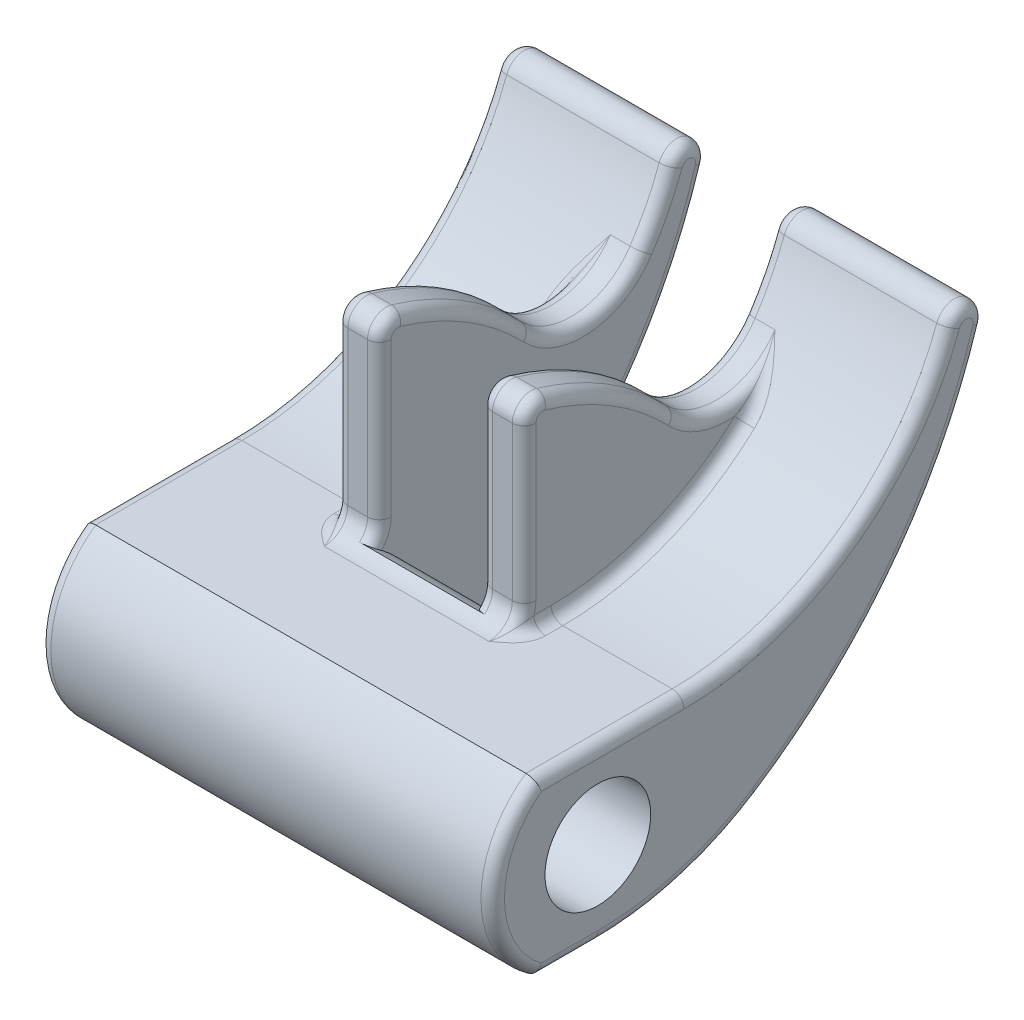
ISO-10303-21;
HEADER;
FILE_DESCRIPTION(('STEP AP214'),'2;1');
FILE_NAME('part.step','',(''),(''),'','','');
FILE_SCHEMA(('AUTOMOTIVE_DESIGN { 1 0 10303 214 1 1 1 1 }'));
ENDSEC;
DATA;
#1=APPLICATION_CONTEXT('core data for automotive mechanical design processes');
#2=APPLICATION_PROTOCOL_DEFINITION('international standard','automotive_design',2000,#1);
#3=PRODUCT_CONTEXT('',#1,'mechanical');
#4=PRODUCT('Part','Part','',(#3));
#5=PRODUCT_RELATED_PRODUCT_CATEGORY('part','',(#4));
#6=PRODUCT_DEFINITION_FORMATION('','',#4);
#7=PRODUCT_DEFINITION_CONTEXT('part definition',#1,'design');
#8=PRODUCT_DEFINITION('design','',#6,#7);
#9=PRODUCT_DEFINITION_SHAPE('','',#8);
#10=(LENGTH_UNIT() NAMED_UNIT(*) SI_UNIT(.MILLI.,.METRE.));
#11=(NAMED_UNIT(*) PLANE_ANGLE_UNIT() SI_UNIT($,.RADIAN.));
#12=(NAMED_UNIT(*) SI_UNIT($,.STERADIAN.) SOLID_ANGLE_UNIT());
#13=UNCERTAINTY_MEASURE_WITH_UNIT(LENGTH_MEASURE(1.E-05),#10,'distance_accuracy_value','');
#14=(GEOMETRIC_REPRESENTATION_CONTEXT(3) GLOBAL_UNCERTAINTY_ASSIGNED_CONTEXT((#13)) GLOBAL_UNIT_ASSIGNED_CONTEXT((#10,
#11,#12)) REPRESENTATION_CONTEXT('',''));
#15=CARTESIAN_POINT('',(0.,0.,0.));
#16=DIRECTION('',(0.,0.,1.));
#17=DIRECTION('',(1.,0.,0.));
#18=AXIS2_PLACEMENT_3D('',#15,#16,#17);
#19=CARTESIAN_POINT('',(15.3162,24.8666,-5.80945985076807));
#20=DIRECTION('',(-1.,0.,0.));
#21=DIRECTION('',(0.,0.,1.));
#22=AXIS2_PLACEMENT_3D('',#19,#20,#21);
#23=CYLINDRICAL_SURFACE('',#22,19.05);
#24=DIRECTION('',(-1.,0.,0.));
#25=VECTOR('',#24,1.);
#26=CARTESIAN_POINT('',(6.35,14.3854686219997,-21.7169544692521));
#27=LINE('',#26,#25);
#28=CARTESIAN_POINT('',(-4.22275,14.3854686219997,-21.7169544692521));
#29=VERTEX_POINT('',#28);
#30=CARTESIAN_POINT('',(-5.55625,14.3854686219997,-21.7169544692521));
#31=VERTEX_POINT('',#30);
#32=EDGE_CURVE('E1073',#29,#31,#27,.T.);
#33=ORIENTED_EDGE('',*,*,#32,.F.);
#34=CARTESIAN_POINT('',(-4.22275,24.8666,-5.80945985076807));
#35=DIRECTION('',(1.,0.,0.));
#36=DIRECTION('',(0.,0.,-1.));
#37=AXIS2_PLACEMENT_3D('',#34,#35,#36);
#38=CIRCLE('',#37,19.05);
#39=CARTESIAN_POINT('',(-4.22275,18.2705375,-23.6810702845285));
#40=VERTEX_POINT('',#39);
#41=EDGE_CURVE('E575',#29,#40,#38,.T.);
#42=ORIENTED_EDGE('',*,*,#41,.T.);
#43=DIRECTION('',(-1.,0.,0.));
#44=VECTOR('',#43,1.);
#45=CARTESIAN_POINT('',(15.3162,18.2705375,-23.6810702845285));
#46=LINE('',#45,#44);
#47=CARTESIAN_POINT('',(-14.52245,18.2705375,-23.6810702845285));
#48=VERTEX_POINT('',#47);
#49=EDGE_CURVE('E800',#40,#48,#46,.T.);
#50=ORIENTED_EDGE('',*,*,#49,.T.);
#51=CARTESIAN_POINT('',(-14.52245,24.8666,-5.80945985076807));
#52=DIRECTION('',(-1.,0.,0.));
#53=DIRECTION('',(0.,0.,1.));
#54=AXIS2_PLACEMENT_3D('',#51,#52,#53);
#55=CIRCLE('',#54,19.05);
#56=CARTESIAN_POINT('',(-14.52245,5.8166,-5.80945985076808));
#57=VERTEX_POINT('',#56);
#58=EDGE_CURVE('E573',#48,#57,#55,.T.);
#59=ORIENTED_EDGE('',*,*,#58,.T.);
#60=DIRECTION('',(-1.,0.,0.));
#61=VECTOR('',#60,1.);
#62=CARTESIAN_POINT('',(15.3162,5.8166,-5.80945985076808));
#63=LINE('',#62,#61);
#64=CARTESIAN_POINT('',(-7.14375,5.8166,-5.80945985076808));
#65=VERTEX_POINT('',#64);
#66=EDGE_CURVE('E1098',#65,#57,#63,.T.);
#67=ORIENTED_EDGE('',*,*,#66,.F.);
#68=CARTESIAN_POINT('',(-7.14375,24.8666,-5.80945985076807));
#69=DIRECTION('',(-1.,0.,0.));
#70=DIRECTION('',(0.,0.,1.));
#71=AXIS2_PLACEMENT_3D('',#68,#69,#70);
#72=CIRCLE('',#71,19.05);
#73=CARTESIAN_POINT('',(-7.14375,10.8870503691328,-18.750661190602));
#74=VERTEX_POINT('',#73);
#75=EDGE_CURVE('E54',#65,#74,#72,.F.);
#76=ORIENTED_EDGE('',*,*,#75,.T.);
#77=CARTESIAN_POINT('',(-6.94501008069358,10.0783414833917,-17.8182029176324));
#78=CARTESIAN_POINT('',(-5.86868582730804,10.3341484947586,-18.1332184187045));
#79=CARTESIAN_POINT('',(-6.25063004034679,11.0782069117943,-17.3435086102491));
#80=CARTESIAN_POINT('',(-6.97564439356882,10.1318318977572,-17.8840820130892));
#81=CARTESIAN_POINT('',(-5.91468193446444,10.3592966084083,-18.1613720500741));
#82=CARTESIAN_POINT('',(-6.26594719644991,11.1020921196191,-17.4011767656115));
#83=CARTESIAN_POINT('',(-7.00228498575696,10.1866777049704,-17.9507137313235));
#84=CARTESIAN_POINT('',(-5.95962866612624,10.3888113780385,-18.1948819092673));
#85=CARTESIAN_POINT('',(-6.2792674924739,11.1269293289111,-17.4602034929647));
#86=CARTESIAN_POINT('',(-7.04817493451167,10.2985799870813,-18.0847550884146));
#87=CARTESIAN_POINT('',(-6.04421471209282,10.4546724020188,-18.2697657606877));
#88=CARTESIAN_POINT('',(-6.30221246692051,11.1784444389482,-17.5804887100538));
#89=CARTESIAN_POINT('',(-7.06743319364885,10.3556337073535,-18.1521636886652));
#90=CARTESIAN_POINT('',(-6.08406024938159,10.4908007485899,-18.3108886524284));
#91=CARTESIAN_POINT('',(-6.31184159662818,11.2051200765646,-17.641744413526));
#92=CARTESIAN_POINT('',(-7.11487758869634,10.5286663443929,-18.3536708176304));
#93=CARTESIAN_POINT('',(-6.19220074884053,10.6053795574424,-18.4405346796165));
#94=CARTESIAN_POINT('',(-6.33556379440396,11.2874756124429,-17.8273867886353));
#95=CARTESIAN_POINT('',(-7.1331838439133,10.6473519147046,-18.4880824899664));
#96=CARTESIAN_POINT('',(-6.25450443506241,10.6932257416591,-18.5390591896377));
#97=CARTESIAN_POINT('',(-6.34471692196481,11.3458522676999,-17.9545474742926));
#98=CARTESIAN_POINT('',(-7.14262077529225,10.8074950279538,-18.6643259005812));
#99=CARTESIAN_POINT('',(-6.32135408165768,10.822150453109,-18.6802979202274));
#100=CARTESIAN_POINT('',(-6.34943538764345,11.4279393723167,-18.126168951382));
#101=CARTESIAN_POINT('',(-7.14374929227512,10.8471673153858,-18.7075811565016));
#102=CARTESIAN_POINT('',(-6.33625786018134,10.8540966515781,-18.7150686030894));
#103=CARTESIAN_POINT('',(-6.34999964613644,11.4485377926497,-18.1686881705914));
#104=CARTESIAN_POINT('',(-7.14375325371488,11.0704098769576,-18.9487185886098));
#105=CARTESIAN_POINT('',(-6.41025556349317,11.0315435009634,-18.9067250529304));
#106=CARTESIAN_POINT('',(-6.3500016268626,11.5660491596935,-18.4080135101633));
#107=CARTESIAN_POINT('',(-7.11991873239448,11.2582242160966,-19.1430724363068));
#108=CARTESIAN_POINT('',(-6.44858537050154,11.1966070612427,-19.0798712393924));
#109=CARTESIAN_POINT('',(-6.33808436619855,11.6709238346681,-18.6095935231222));
#110=CARTESIAN_POINT('',(-7.03562466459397,11.6375157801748,-19.5195294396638));
#111=CARTESIAN_POINT('',(-6.47668062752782,11.5443238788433,-19.4289736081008));
#112=CARTESIAN_POINT('',(-6.29593733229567,11.8994134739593,-19.0174041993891));
#113=CARTESIAN_POINT('',(-6.97502236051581,11.8290044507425,-19.7015817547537));
#114=CARTESIAN_POINT('',(-6.46930437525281,11.7274143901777,-19.606207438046));
#115=CARTESIAN_POINT('',(-6.26563618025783,12.0231000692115,-19.2236499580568));
#116=CARTESIAN_POINT('',(-6.86019589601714,12.1253834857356,-19.9722267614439));
#117=CARTESIAN_POINT('',(-6.42879270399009,12.0207515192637,-19.8780461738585));
#118=CARTESIAN_POINT('',(-6.20822294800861,12.2307489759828,-19.5416990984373));
#119=CARTESIAN_POINT('',(-6.81559441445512,12.230071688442,-20.06568595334));
#120=CARTESIAN_POINT('',(-6.40951766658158,12.1247182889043,-19.9723174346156));
#121=CARTESIAN_POINT('',(-6.1859222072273,12.3072116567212,-19.6538167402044));
#122=CARTESIAN_POINT('',(-6.71952368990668,12.4395075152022,-20.2486151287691));
#123=CARTESIAN_POINT('',(-6.36188885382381,12.3348481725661,-20.1585189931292));
#124=CARTESIAN_POINT('',(-6.1378868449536,12.4669589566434,-19.8769131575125));
#125=CARTESIAN_POINT('',(-6.6680542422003,12.5442551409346,-20.3380849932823));
#126=CARTESIAN_POINT('',(-6.33368033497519,12.4412481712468,-20.2507585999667));
#127=CARTESIAN_POINT('',(-6.11215212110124,12.5502437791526,-19.9878918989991));
#128=CARTESIAN_POINT('',(-6.55954222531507,12.753636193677,-20.513106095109));
#129=CARTESIAN_POINT('',(-6.26978453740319,12.6555971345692,-20.4323534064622));
#130=CARTESIAN_POINT('',(-6.05789611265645,12.7238739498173,-20.207576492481));
#131=CARTESIAN_POINT('',(-6.50250534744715,12.8582696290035,-20.5986612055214));
#132=CARTESIAN_POINT('',(-6.23415964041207,12.76382424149,-20.5220311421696));
#133=CARTESIAN_POINT('',(-6.02937767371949,12.814212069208,-20.3162845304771));
#134=CARTESIAN_POINT('',(-6.38395419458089,13.0676022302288,-20.7662015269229));
#135=CARTESIAN_POINT('',(-6.15693878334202,12.9815859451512,-20.6983810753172));
#136=CARTESIAN_POINT('',(-5.9701020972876,13.0021885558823,-20.5304446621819));
#137=CARTESIAN_POINT('',(-6.32244016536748,13.1723013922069,-20.8481869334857));
#138=CARTESIAN_POINT('',(-6.11531879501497,13.0914415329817,-20.7853794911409));
#139=CARTESIAN_POINT('',(-5.93934508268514,13.0998265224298,-20.6358969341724));
#140=CARTESIAN_POINT('',(-6.17855462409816,13.4108787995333,-21.0310684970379));
#141=CARTESIAN_POINT('',(-6.01561331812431,13.3423154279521,-20.9795483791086));
#142=CARTESIAN_POINT('',(-5.8674023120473,13.3303269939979,-20.8709082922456));
#143=CARTESIAN_POINT('',(-6.09511196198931,13.5448357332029,-21.1309394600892));
#144=CARTESIAN_POINT('',(-5.95576083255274,13.4847925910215,-21.0866995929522));
#145=CARTESIAN_POINT('',(-5.82568098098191,13.465474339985,-20.9990889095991));
#146=CARTESIAN_POINT('',(-5.92479728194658,13.8136873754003,-21.3260060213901));
#147=CARTESIAN_POINT('',(-5.83165338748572,13.7712625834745,-21.2958927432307));
#148=CARTESIAN_POINT('',(-5.74052364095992,13.7469014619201,-21.2459284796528));
#149=CARTESIAN_POINT('',(-5.83792603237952,13.948581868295,-21.4212026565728));
#150=CARTESIAN_POINT('',(-5.76708596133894,13.9160684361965,-21.3985943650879));
#151=CARTESIAN_POINT('',(-5.69708801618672,13.8931787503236,-21.3645895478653));
#152=CARTESIAN_POINT('',(-5.68820265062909,14.1806214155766,-21.5805089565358));
#153=CARTESIAN_POINT('',(-5.65528066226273,14.1651493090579,-21.5700887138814));
#154=CARTESIAN_POINT('',(-5.62222632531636,14.1515583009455,-21.557563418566));
#155=CARTESIAN_POINT('',(-5.62570954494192,14.2773404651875,-21.6456106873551));
#156=CARTESIAN_POINT('',(-5.60834702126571,14.2692285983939,-21.6402507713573));
#157=CARTESIAN_POINT('',(-5.59097977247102,14.2612334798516,-21.6347404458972));
#158=CARTESIAN_POINT('',(-5.56088613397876,14.3782493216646,-21.7121960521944));
#159=CARTESIAN_POINT('',(-5.55972710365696,14.3777079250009,-21.7118390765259));
#160=CARTESIAN_POINT('',(-5.55856806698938,14.377168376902,-21.7114793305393));
#161=CARTESIAN_POINT('',(-5.5585680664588,14.3818585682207,-21.7145758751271));
#162=CARTESIAN_POINT('',(-5.55798854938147,14.3815878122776,-21.7143974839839));
#163=CARTESIAN_POINT('',(-5.5574090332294,14.3813170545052,-21.7142190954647));
#164=CARTESIAN_POINT('',(-5.55625,14.3854686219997,-21.7169544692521));
#165=CARTESIAN_POINT('',(-5.55625,14.3854686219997,-21.7169544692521));
#166=CARTESIAN_POINT('',(-5.55625,14.3854686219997,-21.7169544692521));
#167=(BOUNDED_SURFACE() B_SPLINE_SURFACE(3,2,((#77,#78,#79),(#80,#81,#82),(#83,#84,#85),(#86,
#87,#88),(#89,#90,#91),(#92,#93,#94),(#95,#96,#97),(#98,#99,#100),(#101,#102,#103),(#104,#105,
#106),(#107,#108,#109),(#110,#111,#112),(#113,#114,#115),(#116,#117,#118),(#119,#120,#121),
(#122,#123,#124),(#125,#126,#127),(#128,#129,#130),(#131,#132,#133),(#134,#135,#136),(#137,#138,
#139),(#140,#141,#142),(#143,#144,#145),(#146,#147,#148),(#149,#150,#151),(#152,#153,#154),
(#155,#156,#157),(#158,#159,#160),(#161,#162,#163),(#164,#165,#166)),.UNSPECIFIED.,.F.,.F.,
.F.) B_SPLINE_SURFACE_WITH_KNOTS((4,2,2,2,2,2,2,2,2,2,2,2,2,2,4),(3,3),(0.,0.260412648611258,
0.520510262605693,1.03670533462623,1.20547872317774,1.98140239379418,2.76035818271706,
3.18523199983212,3.61011848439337,4.03457508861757,4.45900840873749,5.00057309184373,
5.54201708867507,5.92605923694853,5.94030168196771),(0.,1.),
.UNSPECIFIED.) GEOMETRIC_REPRESENTATION_ITEM() RATIONAL_B_SPLINE_SURFACE(((1.,0.567952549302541,
1.),(1.,0.578477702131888,1.),(1.,0.588930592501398,1.),(1.,0.609629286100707,1.),(1.,
0.61987532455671,1.),(1.,0.650091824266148,1.),(1.,0.669703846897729,1.),(1.,0.694892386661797,
1.),(1.,0.701031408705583,1.),(1.,0.735037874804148,1.),(1.,0.761623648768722,1.),(1.,
0.811671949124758,1.),(1.,0.835121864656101,1.),(1.,0.868434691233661,1.),(1.,0.879628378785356,
1.),(1.,0.900769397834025,1.),(1.,0.910716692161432,1.),(1.,0.92922274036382,1.),(1.,
0.937782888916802,1.),(1.,0.9533919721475,1.),(1.,0.960440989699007,1.),(1.,0.974620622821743,
1.),(1.,0.981236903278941,1.),(1.,0.991584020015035,1.),(1.,0.995315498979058,1.),(1.,
0.999119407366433,1.),(1.,0.99994019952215,1.),(1.,0.999998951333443,1.),(1.,1.00000000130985,
1.),(1.,1.,1.))) REPRESENTATION_ITEM('') SURFACE());
#168=CARTESIAN_POINT('',(-6.94501008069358,10.0783414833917,-17.8182029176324));
#169=CARTESIAN_POINT('',(-6.97564439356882,10.1318318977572,-17.8840820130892));
#170=CARTESIAN_POINT('',(-7.00228498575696,10.1866777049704,-17.9507137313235));
#171=CARTESIAN_POINT('',(-7.04817493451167,10.2985799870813,-18.0847550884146));
#172=CARTESIAN_POINT('',(-7.06743319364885,10.3556337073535,-18.1521636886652));
#173=CARTESIAN_POINT('',(-7.11487758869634,10.5286663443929,-18.3536708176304));
#174=CARTESIAN_POINT('',(-7.1331838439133,10.6473519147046,-18.4880824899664));
#175=CARTESIAN_POINT('',(-7.14262077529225,10.8074950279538,-18.6643259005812));
#176=CARTESIAN_POINT('',(-7.14374929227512,10.8471673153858,-18.7075811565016));
#177=CARTESIAN_POINT('',(-7.14375325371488,11.0704098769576,-18.9487185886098));
#178=CARTESIAN_POINT('',(-7.11991873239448,11.2582242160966,-19.1430724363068));
#179=CARTESIAN_POINT('',(-7.03562466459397,11.6375157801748,-19.5195294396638));
#180=CARTESIAN_POINT('',(-6.97502236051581,11.8290044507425,-19.7015817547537));
#181=CARTESIAN_POINT('',(-6.86019589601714,12.1253834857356,-19.9722267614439));
#182=CARTESIAN_POINT('',(-6.81559441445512,12.230071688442,-20.06568595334));
#183=CARTESIAN_POINT('',(-6.71952368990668,12.4395075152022,-20.2486151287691));
#184=CARTESIAN_POINT('',(-6.6680542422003,12.5442551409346,-20.3380849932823));
#185=CARTESIAN_POINT('',(-6.55954222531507,12.753636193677,-20.513106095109));
#186=CARTESIAN_POINT('',(-6.50250534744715,12.8582696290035,-20.5986612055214));
#187=CARTESIAN_POINT('',(-6.38395419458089,13.0676022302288,-20.7662015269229));
#188=CARTESIAN_POINT('',(-6.32244016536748,13.1723013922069,-20.8481869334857));
#189=CARTESIAN_POINT('',(-6.17855462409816,13.4108787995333,-21.0310684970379));
#190=CARTESIAN_POINT('',(-6.09511196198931,13.5448357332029,-21.1309394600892));
#191=CARTESIAN_POINT('',(-5.92479728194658,13.8136873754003,-21.3260060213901));
#192=CARTESIAN_POINT('',(-5.83792603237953,13.948581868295,-21.4212026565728));
#193=CARTESIAN_POINT('',(-5.68820265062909,14.1806214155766,-21.5805089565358));
#194=CARTESIAN_POINT('',(-5.62570954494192,14.2773404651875,-21.6456106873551));
#195=CARTESIAN_POINT('',(-5.56088613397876,14.3782493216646,-21.7121960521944));
#196=CARTESIAN_POINT('',(-5.55856806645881,14.3818585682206,-21.7145758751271));
#197=CARTESIAN_POINT('',(-5.55625,14.3854686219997,-21.7169544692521));
#198=B_SPLINE_CURVE_WITH_KNOTS('',3,(#168,#169,#170,#171,#172,#173,#174,#175,#176,#177,#178,
#179,#180,#181,#182,#183,#184,#185,#186,#187,#188,#189,#190,#191,#192,#193,#194,#195,#196,#197),
.UNSPECIFIED.,.F.,.F.,(4,2,2,2,2,2,2,2,2,2,2,2,2,2,4),(0.,0.260412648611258,0.520510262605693,
1.03670533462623,1.20547872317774,1.98140239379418,2.76035818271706,3.18523199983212,
3.61011848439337,4.03457508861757,4.45900840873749,5.00057309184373,5.54201708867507,
5.92605923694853,5.94030168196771),.UNSPECIFIED.);
#199=EDGE_CURVE('E46',#74,#31,#198,.T.);
#200=ORIENTED_EDGE('',*,*,#199,.T.);
#201=EDGE_LOOP('',(#33,#42,#50,#59,#67,#76,#200));
#202=FACE_BOUND('',#201,.T.);
#203=ADVANCED_FACE('F37',(#202),#23,.F.);
#204=CARTESIAN_POINT('',(15.3162,14.1986,0.));
#205=DIRECTION('',(-1.,0.,0.));
#206=DIRECTION('',(0.,0.,1.));
#207=AXIS2_PLACEMENT_3D('',#204,#205,#206);
#208=CYLINDRICAL_SURFACE('',#207,20.0152);
#209=DIRECTION('',(1.,0.,0.));
#210=VECTOR('',#209,1.);
#211=CARTESIAN_POINT('',(0.,-5.23318949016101,-4.79726883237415));
#212=LINE('',#211,#210);
#213=CARTESIAN_POINT('',(-4.22275,-5.23318949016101,-4.79726883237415));
#214=VERTEX_POINT('',#213);
#215=CARTESIAN_POINT('',(4.22275,-5.23318949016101,-4.79726883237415));
#216=VERTEX_POINT('',#215);
#217=EDGE_CURVE('E1742',#214,#216,#212,.T.);
#218=ORIENTED_EDGE('',*,*,#217,.T.);
#219=CARTESIAN_POINT('',(4.22275,14.1986,0.));
#220=DIRECTION('',(1.,0.,0.));
#221=DIRECTION('',(0.,0.,-1.));
#222=AXIS2_PLACEMENT_3D('',#219,#220,#221);
#223=CIRCLE('',#222,20.0152);
#224=CARTESIAN_POINT('',(4.22275,-2.63251027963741,-10.8315261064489));
#225=VERTEX_POINT('',#224);
#226=EDGE_CURVE('E458',#216,#225,#223,.T.);
#227=ORIENTED_EDGE('',*,*,#226,.T.);
#228=DIRECTION('',(-1.,0.,0.));
#229=VECTOR('',#228,1.);
#230=CARTESIAN_POINT('',(15.3162,-2.63251027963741,-10.8315261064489));
#231=LINE('',#230,#229);
#232=CARTESIAN_POINT('',(14.52245,-2.63251027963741,-10.8315261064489));
#233=VERTEX_POINT('',#232);
#234=EDGE_CURVE('E1109',#233,#225,#231,.T.);
#235=ORIENTED_EDGE('',*,*,#234,.F.);
#236=CARTESIAN_POINT('',(14.52245,14.1986,0.));
#237=DIRECTION('',(-1.,0.,0.));
#238=DIRECTION('',(0.,0.,1.));
#239=AXIS2_PLACEMENT_3D('',#236,#237,#238);
#240=CIRCLE('',#239,20.0152);
#241=CARTESIAN_POINT('',(14.52245,-5.8166,0.));
#242=VERTEX_POINT('',#241);
#243=EDGE_CURVE('E451',#233,#242,#240,.T.);
#244=ORIENTED_EDGE('',*,*,#243,.T.);
#245=DIRECTION('',(-1.,0.,0.));
#246=VECTOR('',#245,1.);
#247=CARTESIAN_POINT('',(15.3162,-5.8166,0.));
#248=LINE('',#247,#246);
#249=CARTESIAN_POINT('',(-14.52245,-5.8166,0.));
#250=VERTEX_POINT('',#249);
#251=EDGE_CURVE('E1110',#242,#250,#248,.T.);
#252=ORIENTED_EDGE('',*,*,#251,.T.);
#253=CARTESIAN_POINT('',(-14.52245,14.1986,0.));
#254=DIRECTION('',(-1.,0.,0.));
#255=DIRECTION('',(0.,0.,1.));
#256=AXIS2_PLACEMENT_3D('',#253,#254,#255);
#257=CIRCLE('',#256,20.0152);
#258=CARTESIAN_POINT('',(-14.52245,-2.63251027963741,-10.8315261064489));
#259=VERTEX_POINT('',#258);
#260=EDGE_CURVE('E453',#250,#259,#257,.F.);
#261=ORIENTED_EDGE('',*,*,#260,.T.);
#262=CARTESIAN_POINT('',(-4.22275,-2.63251027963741,-10.8315261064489));
#263=VERTEX_POINT('',#262);
#264=EDGE_CURVE('E1106',#263,#259,#231,.T.);
#265=ORIENTED_EDGE('',*,*,#264,.F.);
#266=CARTESIAN_POINT('',(-4.22275,14.1986,0.));
#267=DIRECTION('',(1.,0.,0.));
#268=DIRECTION('',(0.,0.,-1.));
#269=AXIS2_PLACEMENT_3D('',#266,#267,#268);
#270=CIRCLE('',#269,20.0152);
#271=EDGE_CURVE('E455',#263,#214,#270,.F.);
#272=ORIENTED_EDGE('',*,*,#271,.T.);
#273=EDGE_LOOP('',(#218,#227,#235,#244,#252,#261,#265,#272));
#274=FACE_BOUND('',#273,.T.);
#275=ADVANCED_FACE('F765',(#274),#208,.T.);
#276=CARTESIAN_POINT('',(15.3162,28.3384413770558,9.09958157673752));
#277=DIRECTION('',(-1.,0.,0.));
#278=DIRECTION('',(0.,0.,1.));
#279=AXIS2_PLACEMENT_3D('',#276,#277,#278);
#280=CYLINDRICAL_SURFACE('',#279,36.83);
#281=DIRECTION('',(-1.,0.,0.));
#282=VECTOR('',#281,1.);
#283=CARTESIAN_POINT('',(15.3162,17.4555270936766,-26.0858));
#284=LINE('',#283,#282);
#285=CARTESIAN_POINT('',(-4.22275,17.4555270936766,-26.0858));
#286=VERTEX_POINT('',#285);
#287=CARTESIAN_POINT('',(-14.52245,17.4555270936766,-26.0858));
#288=VERTEX_POINT('',#287);
#289=EDGE_CURVE('E799',#286,#288,#284,.T.);
#290=ORIENTED_EDGE('',*,*,#289,.F.);
#291=CARTESIAN_POINT('',(-4.22275,28.3384413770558,9.09958157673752));
#292=DIRECTION('',(1.,0.,0.));
#293=DIRECTION('',(0.,0.,-1.));
#294=AXIS2_PLACEMENT_3D('',#291,#292,#293);
#295=CIRCLE('',#294,36.83);
#296=EDGE_CURVE('E512',#286,#263,#295,.F.);
#297=ORIENTED_EDGE('',*,*,#296,.T.);
#298=ORIENTED_EDGE('',*,*,#264,.T.);
#299=CARTESIAN_POINT('',(-14.52245,28.3384413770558,9.09958157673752));
#300=DIRECTION('',(-1.,0.,0.));
#301=DIRECTION('',(0.,0.,1.));
#302=AXIS2_PLACEMENT_3D('',#299,#300,#301);
#303=CIRCLE('',#302,36.83);
#304=EDGE_CURVE('E510',#259,#288,#303,.F.);
#305=ORIENTED_EDGE('',*,*,#304,.T.);
#306=EDGE_LOOP('',(#290,#297,#298,#305));
#307=FACE_BOUND('',#306,.T.);
#308=ADVANCED_FACE('F771',(#307),#280,.T.);
#309=CARTESIAN_POINT('',(15.3162,17.8308,-24.8725109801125));
#310=DIRECTION('',(-1.,0.,0.));
#311=DIRECTION('',(0.,0.,1.));
#312=AXIS2_PLACEMENT_3D('',#309,#310,#311);
#313=CYLINDRICAL_SURFACE('',#312,1.26999999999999);
#314=ORIENTED_EDGE('',*,*,#49,.F.);
#315=CARTESIAN_POINT('',(-4.22275,17.8308,-24.8725109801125));
#316=DIRECTION('',(1.,0.,0.));
#317=DIRECTION('',(0.,0.,-1.));
#318=AXIS2_PLACEMENT_3D('',#315,#316,#317);
#319=CIRCLE('',#318,1.26999999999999);
#320=EDGE_CURVE('E516',#40,#286,#319,.F.);
#321=ORIENTED_EDGE('',*,*,#320,.T.);
#322=ORIENTED_EDGE('',*,*,#289,.T.);
#323=CARTESIAN_POINT('',(-14.52245,17.8308,-24.8725109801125));
#324=DIRECTION('',(-1.,0.,0.));
#325=DIRECTION('',(0.,0.,1.));
#326=AXIS2_PLACEMENT_3D('',#323,#324,#325);
#327=CIRCLE('',#326,1.26999999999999);
#328=EDGE_CURVE('E514',#288,#48,#327,.F.);
#329=ORIENTED_EDGE('',*,*,#328,.T.);
#330=EDGE_LOOP('',(#314,#321,#322,#329));
#331=FACE_BOUND('',#330,.T.);
#332=ADVANCED_FACE('F1605',(#331),#313,.T.);
#333=CARTESIAN_POINT('',(6.35,7.40410000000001,-3.9878));
#334=DIRECTION('',(0.,0.,1.));
#335=DIRECTION('',(1.,0.,0.));
#336=AXIS2_PLACEMENT_3D('',#333,#334,#335);
#337=PLANE('',#336);
#338=DIRECTION('',(-1.,0.,0.));
#339=VECTOR('',#338,1.);
#340=CARTESIAN_POINT('',(6.35,7.40410000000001,-3.9878));
#341=LINE('',#340,#339);
#342=CARTESIAN_POINT('',(-4.22275,7.40410000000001,-3.9878));
#343=VERTEX_POINT('',#342);
#344=CARTESIAN_POINT('',(-5.55625,7.40410000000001,-3.9878));
#345=VERTEX_POINT('',#344);
#346=EDGE_CURVE('E1067',#343,#345,#341,.T.);
#347=ORIENTED_EDGE('',*,*,#346,.F.);
#348=DIRECTION('',(0.,1.,0.));
#349=VECTOR('',#348,1.);
#350=CARTESIAN_POINT('',(-4.22275,7.40410000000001,-3.9878));
#351=LINE('',#350,#349);
#352=CARTESIAN_POINT('',(-4.22275,17.7809252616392,-3.9878));
#353=VERTEX_POINT('',#352);
#354=EDGE_CURVE('E520',#343,#353,#351,.T.);
#355=ORIENTED_EDGE('',*,*,#354,.T.);
#356=DIRECTION('',(-1.,0.,0.));
#357=VECTOR('',#356,1.);
#358=CARTESIAN_POINT('',(6.35,17.7809252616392,-3.9878));
#359=LINE('',#358,#357);
#360=CARTESIAN_POINT('',(-5.55625,17.7809252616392,-3.9878));
#361=VERTEX_POINT('',#360);
#362=EDGE_CURVE('E1088',#353,#361,#359,.T.);
#363=ORIENTED_EDGE('',*,*,#362,.T.);
#364=DIRECTION('',(0.,1.,0.));
#365=VECTOR('',#364,1.);
#366=CARTESIAN_POINT('',(-5.55625,7.40410000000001,-3.9878));
#367=LINE('',#366,#365);
#368=EDGE_CURVE('E518',#361,#345,#367,.F.);
#369=ORIENTED_EDGE('',*,*,#368,.T.);
#370=EDGE_LOOP('',(#347,#355,#363,#369));
#371=FACE_BOUND('',#370,.T.);
#372=ADVANCED_FACE('F1593',(#371),#337,.T.);
#373=CARTESIAN_POINT('',(6.35,7.40410000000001,-2.4003));
#374=DIRECTION('',(-1.,0.,0.));
#375=DIRECTION('',(0.,0.,1.));
#376=AXIS2_PLACEMENT_3D('',#373,#374,#375);
#377=CYLINDRICAL_SURFACE('',#376,1.5875);
#378=ORIENTED_EDGE('',*,*,#346,.T.);
#379=CARTESIAN_POINT('',(-5.55625,7.40410000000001,-2.4003));
#380=DIRECTION('',(-1.,0.,0.));
#381=DIRECTION('',(0.,0.,1.));
#382=AXIS2_PLACEMENT_3D('',#379,#380,#381);
#383=CIRCLE('',#382,1.5875);
#384=CARTESIAN_POINT('',(-5.55625,5.81660000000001,-2.4003));
#385=VERTEX_POINT('',#384);
#386=EDGE_CURVE('E410',#345,#385,#383,.T.);
#387=ORIENTED_EDGE('',*,*,#386,.T.);
#388=DIRECTION('',(-1.,0.,0.));
#389=VECTOR('',#388,1.);
#390=CARTESIAN_POINT('',(6.35,5.81660000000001,-2.4003));
#391=LINE('',#390,#389);
#392=CARTESIAN_POINT('',(5.55625,5.81660000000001,-2.4003));
#393=VERTEX_POINT('',#392);
#394=EDGE_CURVE('E1065',#393,#385,#391,.T.);
#395=ORIENTED_EDGE('',*,*,#394,.F.);
#396=CARTESIAN_POINT('',(5.55625,7.40410000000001,-2.4003));
#397=DIRECTION('',(-1.,0.,0.));
#398=DIRECTION('',(0.,0.,1.));
#399=AXIS2_PLACEMENT_3D('',#396,#397,#398);
#400=CIRCLE('',#399,1.5875);
#401=CARTESIAN_POINT('',(5.55625,7.40410000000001,-3.9878));
#402=VERTEX_POINT('',#401);
#403=EDGE_CURVE('E407',#393,#402,#400,.F.);
#404=ORIENTED_EDGE('',*,*,#403,.T.);
#405=CARTESIAN_POINT('',(4.22275,7.40410000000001,-3.9878));
#406=VERTEX_POINT('',#405);
#407=EDGE_CURVE('E1071',#402,#406,#341,.T.);
#408=ORIENTED_EDGE('',*,*,#407,.T.);
#409=CARTESIAN_POINT('',(4.22275,7.40410000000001,-2.4003));
#410=DIRECTION('',(1.,0.,0.));
#411=DIRECTION('',(0.,0.,-1.));
#412=AXIS2_PLACEMENT_3D('',#409,#410,#411);
#413=CIRCLE('',#412,1.5875);
#414=CARTESIAN_POINT('',(4.22275,6.20795219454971,-3.44403688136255));
#415=VERTEX_POINT('',#414);
#416=EDGE_CURVE('E404',#406,#415,#413,.F.);
#417=ORIENTED_EDGE('',*,*,#416,.T.);
#418=DIRECTION('',(1.,0.,0.));
#419=VECTOR('',#418,1.);
#420=CARTESIAN_POINT('',(0.,6.20795219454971,-3.44403688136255));
#421=LINE('',#420,#419);
#422=CARTESIAN_POINT('',(-4.22275,6.20795219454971,-3.44403688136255));
#423=VERTEX_POINT('',#422);
#424=EDGE_CURVE('E388',#423,#415,#421,.T.);
#425=ORIENTED_EDGE('',*,*,#424,.F.);
#426=CARTESIAN_POINT('',(-4.22275,7.40410000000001,-2.4003));
#427=DIRECTION('',(1.,0.,0.));
#428=DIRECTION('',(0.,0.,-1.));
#429=AXIS2_PLACEMENT_3D('',#426,#427,#428);
#430=CIRCLE('',#429,1.5875);
#431=EDGE_CURVE('E402',#423,#343,#430,.T.);
#432=ORIENTED_EDGE('',*,*,#431,.T.);
#433=EDGE_LOOP('',(#378,#387,#395,#404,#408,#417,#425,#432));
#434=FACE_BOUND('',#433,.T.);
#435=ADVANCED_FACE('F1064',(#434),#377,.F.);
#436=CARTESIAN_POINT('',(6.35,17.0057514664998,-17.7400808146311));
#437=DIRECTION('',(-1.,0.,0.));
#438=DIRECTION('',(0.,0.,1.));
#439=AXIS2_PLACEMENT_3D('',#436,#437,#438);
#440=CYLINDRICAL_SURFACE('',#439,4.7625);
#441=ORIENTED_EDGE('',*,*,#32,.T.);
#442=CARTESIAN_POINT('',(-5.55625,17.0057514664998,-17.7400808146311));
#443=DIRECTION('',(-1.,0.,0.));
#444=DIRECTION('',(0.,0.,1.));
#445=AXIS2_PLACEMENT_3D('',#442,#443,#444);
#446=CIRCLE('',#445,4.7625);
#447=CARTESIAN_POINT('',(-5.55625,13.7100631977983,-14.3020806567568));
#448=VERTEX_POINT('',#447);
#449=EDGE_CURVE('E374',#31,#448,#446,.T.);
#450=ORIENTED_EDGE('',*,*,#449,.T.);
#451=DIRECTION('',(-1.,0.,0.));
#452=VECTOR('',#451,1.);
#453=CARTESIAN_POINT('',(6.35,13.7100631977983,-14.3020806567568));
#454=LINE('',#453,#452);
#455=CARTESIAN_POINT('',(-4.22275,13.7100631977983,-14.3020806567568));
#456=VERTEX_POINT('',#455);
#457=EDGE_CURVE('E1080',#456,#448,#454,.T.);
#458=ORIENTED_EDGE('',*,*,#457,.F.);
#459=CARTESIAN_POINT('',(-4.22275,17.0057514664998,-17.7400808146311));
#460=DIRECTION('',(1.,0.,0.));
#461=DIRECTION('',(0.,0.,-1.));
#462=AXIS2_PLACEMENT_3D('',#459,#460,#461);
#463=CIRCLE('',#462,4.7625);
#464=EDGE_CURVE('E413',#456,#29,#463,.T.);
#465=ORIENTED_EDGE('',*,*,#464,.T.);
#466=EDGE_LOOP('',(#441,#450,#458,#465));
#467=FACE_BOUND('',#466,.T.);
#468=ADVANCED_FACE('F1582',(#467),#440,.F.);
#469=CARTESIAN_POINT('',(6.35,0.,0.));
#470=DIRECTION('',(-1.,0.,0.));
#471=DIRECTION('',(0.,0.,1.));
#472=AXIS2_PLACEMENT_3D('',#469,#470,#471);
#473=CYLINDRICAL_SURFACE('',#472,19.812);
#474=ORIENTED_EDGE('',*,*,#457,.T.);
#475=CARTESIAN_POINT('',(-5.55625,0.,0.));
#476=DIRECTION('',(-1.,0.,0.));
#477=DIRECTION('',(0.,0.,1.));
#478=AXIS2_PLACEMENT_3D('',#475,#476,#477);
#479=CIRCLE('',#478,19.812);
#480=CARTESIAN_POINT('',(-5.55625,18.9987968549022,-5.61792328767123));
#481=VERTEX_POINT('',#480);
#482=EDGE_CURVE('E418',#448,#481,#479,.F.);
#483=ORIENTED_EDGE('',*,*,#482,.T.);
#484=DIRECTION('',(-1.,0.,0.));
#485=VECTOR('',#484,1.);
#486=CARTESIAN_POINT('',(6.35,18.9987968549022,-5.61792328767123));
#487=LINE('',#486,#485);
#488=CARTESIAN_POINT('',(-4.22275,18.9987968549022,-5.61792328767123));
#489=VERTEX_POINT('',#488);
#490=EDGE_CURVE('E1084',#489,#481,#487,.T.);
#491=ORIENTED_EDGE('',*,*,#490,.F.);
#492=CARTESIAN_POINT('',(-4.22275,0.,0.));
#493=DIRECTION('',(1.,0.,0.));
#494=DIRECTION('',(0.,0.,-1.));
#495=AXIS2_PLACEMENT_3D('',#492,#493,#494);
#496=CIRCLE('',#495,19.812);
#497=EDGE_CURVE('E416',#489,#456,#496,.F.);
#498=ORIENTED_EDGE('',*,*,#497,.T.);
#499=EDGE_LOOP('',(#474,#483,#491,#498));
#500=FACE_BOUND('',#499,.T.);
#501=ADVANCED_FACE('F786',(#500),#473,.T.);
#502=CARTESIAN_POINT('',(6.35,17.7809252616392,-5.2578));
#503=DIRECTION('',(-1.,0.,0.));
#504=DIRECTION('',(0.,0.,1.));
#505=AXIS2_PLACEMENT_3D('',#502,#503,#504);
#506=CYLINDRICAL_SURFACE('',#505,1.27);
#507=ORIENTED_EDGE('',*,*,#490,.T.);
#508=CARTESIAN_POINT('',(-5.55625,17.7809252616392,-5.2578));
#509=DIRECTION('',(-1.,0.,0.));
#510=DIRECTION('',(0.,0.,1.));
#511=AXIS2_PLACEMENT_3D('',#508,#509,#510);
#512=CIRCLE('',#511,1.27);
#513=EDGE_CURVE('E422',#481,#361,#512,.F.);
#514=ORIENTED_EDGE('',*,*,#513,.T.);
#515=ORIENTED_EDGE('',*,*,#362,.F.);
#516=CARTESIAN_POINT('',(-4.22275,17.7809252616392,-5.2578));
#517=DIRECTION('',(1.,0.,0.));
#518=DIRECTION('',(0.,0.,-1.));
#519=AXIS2_PLACEMENT_3D('',#516,#517,#518);
#520=CIRCLE('',#519,1.27);
#521=EDGE_CURVE('E420',#353,#489,#520,.F.);
#522=ORIENTED_EDGE('',*,*,#521,.T.);
#523=EDGE_LOOP('',(#507,#514,#515,#522));
#524=FACE_BOUND('',#523,.T.);
#525=ADVANCED_FACE('F779',(#524),#506,.T.);
#526=CARTESIAN_POINT('',(14.52245,18.2705375,-23.6810702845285));
#527=VERTEX_POINT('',#526);
#528=CARTESIAN_POINT('',(4.22275,18.2705375,-23.6810702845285));
#529=VERTEX_POINT('',#528);
#530=EDGE_CURVE('E792',#527,#529,#46,.T.);
#531=ORIENTED_EDGE('',*,*,#530,.T.);
#532=CARTESIAN_POINT('',(4.22275,24.8666,-5.80945985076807));
#533=DIRECTION('',(1.,0.,0.));
#534=DIRECTION('',(0.,0.,-1.));
#535=AXIS2_PLACEMENT_3D('',#532,#533,#534);
#536=CIRCLE('',#535,19.05);
#537=CARTESIAN_POINT('',(4.22275,14.3854686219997,-21.7169544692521));
#538=VERTEX_POINT('',#537);
#539=EDGE_CURVE('E570',#529,#538,#536,.F.);
#540=ORIENTED_EDGE('',*,*,#539,.T.);
#541=CARTESIAN_POINT('',(5.55625,14.3854686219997,-21.7169544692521));
#542=VERTEX_POINT('',#541);
#543=EDGE_CURVE('E1069',#542,#538,#27,.T.);
#544=ORIENTED_EDGE('',*,*,#543,.F.);
#545=CARTESIAN_POINT('',(6.25063004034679,11.0782069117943,-17.3435086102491));
#546=CARTESIAN_POINT('',(5.86868582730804,10.3341484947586,-18.1332184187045));
#547=CARTESIAN_POINT('',(6.94501008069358,10.0783414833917,-17.8182029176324));
#548=CARTESIAN_POINT('',(6.26594719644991,11.1020921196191,-17.4011767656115));
#549=CARTESIAN_POINT('',(5.91468193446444,10.3592966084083,-18.1613720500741));
#550=CARTESIAN_POINT('',(6.97564439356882,10.1318318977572,-17.8840820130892));
#551=CARTESIAN_POINT('',(6.2792674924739,11.1269293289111,-17.4602034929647));
#552=CARTESIAN_POINT('',(5.95962866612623,10.3888113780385,-18.1948819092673));
#553=CARTESIAN_POINT('',(7.00228498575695,10.1866777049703,-17.9507137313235));
#554=CARTESIAN_POINT('',(6.30221246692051,11.1784444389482,-17.5804887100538));
#555=CARTESIAN_POINT('',(6.04421471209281,10.4546724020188,-18.2697657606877));
#556=CARTESIAN_POINT('',(7.04817493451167,10.2985799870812,-18.0847550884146));
#557=CARTESIAN_POINT('',(6.31184159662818,11.2051200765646,-17.641744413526));
#558=CARTESIAN_POINT('',(6.08406024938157,10.4908007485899,-18.3108886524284));
#559=CARTESIAN_POINT('',(7.06743319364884,10.3556337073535,-18.1521636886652));
#560=CARTESIAN_POINT('',(6.33556379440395,11.2874756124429,-17.8273867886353));
#561=CARTESIAN_POINT('',(6.19220074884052,10.6053795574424,-18.4405346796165));
#562=CARTESIAN_POINT('',(7.11487758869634,10.5286663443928,-18.3536708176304));
#563=CARTESIAN_POINT('',(6.34471692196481,11.3458522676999,-17.9545474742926));
#564=CARTESIAN_POINT('',(6.2545044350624,10.6932257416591,-18.5390591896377));
#565=CARTESIAN_POINT('',(7.1331838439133,10.6473519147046,-18.4880824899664));
#566=CARTESIAN_POINT('',(6.34943538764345,11.4279393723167,-18.126168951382));
#567=CARTESIAN_POINT('',(6.32135408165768,10.822150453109,-18.6802979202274));
#568=CARTESIAN_POINT('',(7.14262077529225,10.8074950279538,-18.6643259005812));
#569=CARTESIAN_POINT('',(6.34999964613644,11.4485377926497,-18.1686881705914));
#570=CARTESIAN_POINT('',(6.33625786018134,10.8540966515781,-18.7150686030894));
#571=CARTESIAN_POINT('',(7.14374929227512,10.8471673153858,-18.7075811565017));
#572=CARTESIAN_POINT('',(6.3500016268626,11.5660491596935,-18.4080135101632));
#573=CARTESIAN_POINT('',(6.41025556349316,11.0315435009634,-18.9067250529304));
#574=CARTESIAN_POINT('',(7.14375325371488,11.0704098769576,-18.9487185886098));
#575=CARTESIAN_POINT('',(6.33808436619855,11.670923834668,-18.6095935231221));
#576=CARTESIAN_POINT('',(6.44858537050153,11.1966070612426,-19.0798712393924));
#577=CARTESIAN_POINT('',(7.11991873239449,11.2582242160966,-19.1430724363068));
#578=CARTESIAN_POINT('',(6.29593733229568,11.8994134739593,-19.0174041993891));
#579=CARTESIAN_POINT('',(6.47668062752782,11.5443238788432,-19.4289736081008));
#580=CARTESIAN_POINT('',(7.03562466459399,11.6375157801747,-19.5195294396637));
#581=CARTESIAN_POINT('',(6.26563618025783,12.0231000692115,-19.2236499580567));
#582=CARTESIAN_POINT('',(6.46930437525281,11.7274143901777,-19.606207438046));
#583=CARTESIAN_POINT('',(6.97502236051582,11.8290044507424,-19.7015817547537));
#584=CARTESIAN_POINT('',(6.20822294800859,12.2307489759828,-19.5416990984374));
#585=CARTESIAN_POINT('',(6.42879270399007,12.0207515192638,-19.8780461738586));
#586=CARTESIAN_POINT('',(6.8601958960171,12.1253834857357,-19.972226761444));
#587=CARTESIAN_POINT('',(6.18592220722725,12.3072116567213,-19.6538167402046));
#588=CARTESIAN_POINT('',(6.40951766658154,12.1247182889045,-19.9723174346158));
#589=CARTESIAN_POINT('',(6.81559441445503,12.2300716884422,-20.0656859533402));
#590=CARTESIAN_POINT('',(6.13788684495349,12.4669589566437,-19.876913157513));
#591=CARTESIAN_POINT('',(6.3618888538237,12.3348481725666,-20.1585189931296));
#592=CARTESIAN_POINT('',(6.71952368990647,12.4395075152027,-20.2486151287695));
#593=CARTESIAN_POINT('',(6.1121521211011,12.550243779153,-19.9878918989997));
#594=CARTESIAN_POINT('',(6.33368033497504,12.4412481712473,-20.2507585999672));
#595=CARTESIAN_POINT('',(6.66805424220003,12.5442551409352,-20.3380849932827));
#596=CARTESIAN_POINT('',(6.05789611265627,12.7238739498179,-20.2075764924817));
#597=CARTESIAN_POINT('',(6.26978453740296,12.6555971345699,-20.4323534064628));
#598=CARTESIAN_POINT('',(6.5595422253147,12.7536361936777,-20.5131060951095));
#599=CARTESIAN_POINT('',(6.02937767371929,12.8142120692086,-20.3162845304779));
#600=CARTESIAN_POINT('',(6.23415964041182,12.7638242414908,-20.5220311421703));
#601=CARTESIAN_POINT('',(6.50250534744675,12.8582696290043,-20.598661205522));
#602=CARTESIAN_POINT('',(5.97010209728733,13.0021885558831,-20.5304446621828));
#603=CARTESIAN_POINT('',(6.15693878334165,12.9815859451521,-20.698381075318));
#604=CARTESIAN_POINT('',(6.38395419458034,13.0676022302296,-20.7662015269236));
#605=CARTESIAN_POINT('',(5.9393450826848,13.0998265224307,-20.6358969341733));
#606=CARTESIAN_POINT('',(6.1153187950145,13.0914415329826,-20.7853794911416));
#607=CARTESIAN_POINT('',(6.3224401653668,13.1723013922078,-20.8481869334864));
#608=CARTESIAN_POINT('',(5.86740231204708,13.3303269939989,-20.8709082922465));
#609=CARTESIAN_POINT('',(6.015613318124,13.3423154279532,-20.9795483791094));
#610=CARTESIAN_POINT('',(6.17855462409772,13.4108787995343,-21.0310684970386));
#611=CARTESIAN_POINT('',(5.82568098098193,13.4654743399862,-20.9990889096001));
#612=CARTESIAN_POINT('',(5.9557608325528,13.4847925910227,-21.0866995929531));
#613=CARTESIAN_POINT('',(6.09511196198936,13.544835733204,-21.13093946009));
#614=CARTESIAN_POINT('',(5.74052364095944,13.7469014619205,-21.2459284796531));
#615=CARTESIAN_POINT('',(5.83165338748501,13.7712625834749,-21.295892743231));
#616=CARTESIAN_POINT('',(5.92479728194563,13.8136873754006,-21.3260060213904));
#617=CARTESIAN_POINT('',(5.6970880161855,13.8931787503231,-21.3645895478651));
#618=CARTESIAN_POINT('',(5.76708596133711,13.916068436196,-21.3985943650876));
#619=CARTESIAN_POINT('',(5.83792603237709,13.9485818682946,-21.4212026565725));
#620=CARTESIAN_POINT('',(5.62222632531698,14.1515583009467,-21.5575634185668));
#621=CARTESIAN_POINT('',(5.65528066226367,14.165149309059,-21.5700887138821));
#622=CARTESIAN_POINT('',(5.68820265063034,14.1806214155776,-21.5805089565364));
#623=CARTESIAN_POINT('',(5.59097977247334,14.2612334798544,-21.6347404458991));
#624=CARTESIAN_POINT('',(5.60834702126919,14.2692285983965,-21.6402507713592));
#625=CARTESIAN_POINT('',(5.62570954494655,14.2773404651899,-21.6456106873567));
#626=CARTESIAN_POINT('',(5.55856806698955,14.3771683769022,-21.7114793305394));
#627=CARTESIAN_POINT('',(5.55972710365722,14.3777079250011,-21.711839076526));
#628=CARTESIAN_POINT('',(5.5608861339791,14.3782493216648,-21.7121960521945));
#629=CARTESIAN_POINT('',(5.55740903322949,14.3813170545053,-21.7142190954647));
#630=CARTESIAN_POINT('',(5.55798854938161,14.3815878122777,-21.714397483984));
#631=CARTESIAN_POINT('',(5.55856806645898,14.3818585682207,-21.7145758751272));
#632=CARTESIAN_POINT('',(5.55625,14.3854686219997,-21.7169544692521));
#633=CARTESIAN_POINT('',(5.55625,14.3854686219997,-21.7169544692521));
#634=CARTESIAN_POINT('',(5.55625,14.3854686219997,-21.7169544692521));
#635=(BOUNDED_SURFACE() B_SPLINE_SURFACE(3,2,((#545,#546,#547),(#548,#549,#550),(#551,#552,
#553),(#554,#555,#556),(#557,#558,#559),(#560,#561,#562),(#563,#564,#565),(#566,#567,#568),
(#569,#570,#571),(#572,#573,#574),(#575,#576,#577),(#578,#579,#580),(#581,#582,#583),(#584,#585,
#586),(#587,#588,#589),(#590,#591,#592),(#593,#594,#595),(#596,#597,#598),(#599,#600,#601),
(#602,#603,#604),(#605,#606,#607),(#608,#609,#610),(#611,#612,#613),(#614,#615,#616),(#617,#618,
#619),(#620,#621,#622),(#623,#624,#625),(#626,#627,#628),(#629,#630,#631),(#632,#633,#634)),
.UNSPECIFIED.,.F.,.F.,.F.) B_SPLINE_SURFACE_WITH_KNOTS((4,2,2,2,2,2,2,2,2,2,2,2,2,2,4),(3,3),
(0.,0.260412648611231,0.52051026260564,1.03670533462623,1.20547872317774,1.98140239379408,
2.76035818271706,3.18523199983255,3.61011848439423,4.03457508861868,4.45900840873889,
5.0005730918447,5.54201708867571,5.92605923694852,5.94030168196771),(0.,1.),
.UNSPECIFIED.) GEOMETRIC_REPRESENTATION_ITEM() RATIONAL_B_SPLINE_SURFACE(((1.,0.567952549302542,
1.),(1.,0.578477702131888,1.),(1.,0.588930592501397,1.),(1.,0.609629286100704,1.),(1.,
0.619875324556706,1.),(1.,0.650091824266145,1.),(1.,0.669703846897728,1.),(1.,0.694892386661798,
1.),(1.,0.701031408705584,1.),(1.,0.735037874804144,1.),(1.,0.761623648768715,1.),(1.,
0.811671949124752,1.),(1.,0.835121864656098,1.),(1.,0.868434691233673,1.),(1.,0.879628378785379,
1.),(1.,0.900769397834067,1.),(1.,0.910716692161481,1.),(1.,0.929222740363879,1.),(1.,
0.937782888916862,1.),(1.,0.953391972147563,1.),(1.,0.96044098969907,1.),(1.,0.974620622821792,
1.),(1.,0.981236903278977,1.),(1.,0.991584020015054,1.),(1.,0.995315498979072,1.),(1.,
0.999119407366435,1.),(1.,0.999940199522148,1.),(1.,0.999998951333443,1.),(1.,1.00000000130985,
1.),(1.,1.,1.))) REPRESENTATION_ITEM('') SURFACE());
#636=CARTESIAN_POINT('',(6.94501008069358,10.0783414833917,-17.8182029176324));
#637=CARTESIAN_POINT('',(6.97564439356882,10.1318318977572,-17.8840820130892));
#638=CARTESIAN_POINT('',(7.00228498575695,10.1866777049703,-17.9507137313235));
#639=CARTESIAN_POINT('',(7.04817493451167,10.2985799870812,-18.0847550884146));
#640=CARTESIAN_POINT('',(7.06743319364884,10.3556337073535,-18.1521636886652));
#641=CARTESIAN_POINT('',(7.11487758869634,10.5286663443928,-18.3536708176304));
#642=CARTESIAN_POINT('',(7.1331838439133,10.6473519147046,-18.4880824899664));
#643=CARTESIAN_POINT('',(7.14262077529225,10.8074950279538,-18.6643259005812));
#644=CARTESIAN_POINT('',(7.14374929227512,10.8471673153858,-18.7075811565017));
#645=CARTESIAN_POINT('',(7.14375325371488,11.0704098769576,-18.9487185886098));
#646=CARTESIAN_POINT('',(7.11991873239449,11.2582242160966,-19.1430724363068));
#647=CARTESIAN_POINT('',(7.03562466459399,11.6375157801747,-19.5195294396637));
#648=CARTESIAN_POINT('',(6.97502236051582,11.8290044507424,-19.7015817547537));
#649=CARTESIAN_POINT('',(6.8601958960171,12.1253834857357,-19.972226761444));
#650=CARTESIAN_POINT('',(6.81559441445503,12.2300716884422,-20.0656859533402));
#651=CARTESIAN_POINT('',(6.71952368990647,12.4395075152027,-20.2486151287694));
#652=CARTESIAN_POINT('',(6.66805424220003,12.5442551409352,-20.3380849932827));
#653=CARTESIAN_POINT('',(6.5595422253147,12.7536361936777,-20.5131060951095));
#654=CARTESIAN_POINT('',(6.50250534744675,12.8582696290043,-20.598661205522));
#655=CARTESIAN_POINT('',(6.38395419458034,13.0676022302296,-20.7662015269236));
#656=CARTESIAN_POINT('',(6.3224401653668,13.1723013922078,-20.8481869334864));
#657=CARTESIAN_POINT('',(6.17855462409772,13.4108787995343,-21.0310684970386));
#658=CARTESIAN_POINT('',(6.09511196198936,13.544835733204,-21.13093946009));
#659=CARTESIAN_POINT('',(5.92479728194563,13.8136873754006,-21.3260060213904));
#660=CARTESIAN_POINT('',(5.83792603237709,13.9485818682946,-21.4212026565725));
#661=CARTESIAN_POINT('',(5.68820265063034,14.1806214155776,-21.5805089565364));
#662=CARTESIAN_POINT('',(5.62570954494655,14.2773404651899,-21.6456106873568));
#663=CARTESIAN_POINT('',(5.5608861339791,14.3782493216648,-21.7121960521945));
#664=CARTESIAN_POINT('',(5.55856806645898,14.3818585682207,-21.7145758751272));
#665=CARTESIAN_POINT('',(5.55625,14.3854686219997,-21.7169544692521));
#666=B_SPLINE_CURVE_WITH_KNOTS('',3,(#636,#637,#638,#639,#640,#641,#642,#643,#644,#645,#646,
#647,#648,#649,#650,#651,#652,#653,#654,#655,#656,#657,#658,#659,#660,#661,#662,#663,#664,#665),
.UNSPECIFIED.,.F.,.F.,(4,2,2,2,2,2,2,2,2,2,2,2,2,2,4),(0.,0.260412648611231,0.52051026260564,
1.03670533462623,1.20547872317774,1.98140239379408,2.76035818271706,3.18523199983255,
3.61011848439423,4.03457508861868,4.45900840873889,5.0005730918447,5.54201708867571,
5.92605923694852,5.94030168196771),.UNSPECIFIED.);
#667=CARTESIAN_POINT('',(7.14375,10.8870503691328,-18.750661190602));
#668=VERTEX_POINT('',#667);
#669=EDGE_CURVE('E11',#542,#668,#666,.F.);
#670=ORIENTED_EDGE('',*,*,#669,.T.);
#671=CARTESIAN_POINT('',(7.14375,24.8666,-5.80945985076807));
#672=DIRECTION('',(-1.,0.,0.));
#673=DIRECTION('',(0.,0.,1.));
#674=AXIS2_PLACEMENT_3D('',#671,#672,#673);
#675=CIRCLE('',#674,19.05);
#676=CARTESIAN_POINT('',(7.14375,5.8166,-5.80945985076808));
#677=VERTEX_POINT('',#676);
#678=EDGE_CURVE('E568',#668,#677,#675,.T.);
#679=ORIENTED_EDGE('',*,*,#678,.T.);
#680=CARTESIAN_POINT('',(14.52245,5.8166,-5.80945985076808));
#681=VERTEX_POINT('',#680);
#682=EDGE_CURVE('E1099',#681,#677,#63,.T.);
#683=ORIENTED_EDGE('',*,*,#682,.F.);
#684=CARTESIAN_POINT('',(14.52245,24.8666,-5.80945985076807));
#685=DIRECTION('',(-1.,0.,0.));
#686=DIRECTION('',(0.,0.,1.));
#687=AXIS2_PLACEMENT_3D('',#684,#685,#686);
#688=CIRCLE('',#687,19.05);
#689=EDGE_CURVE('E566',#681,#527,#688,.F.);
#690=ORIENTED_EDGE('',*,*,#689,.T.);
#691=EDGE_LOOP('',(#531,#540,#544,#670,#679,#683,#690));
#692=FACE_BOUND('',#691,.T.);
#693=ADVANCED_FACE('F767',(#692),#23,.F.);
#694=CARTESIAN_POINT('',(15.3162,5.8166,-5.80945985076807));
#695=DIRECTION('',(0.,-1.,0.));
#696=DIRECTION('',(0.,0.,-1.));
#697=AXIS2_PLACEMENT_3D('',#694,#695,#696);
#698=PLANE('',#697);
#699=ORIENTED_EDGE('',*,*,#66,.T.);
#700=DIRECTION('',(0.,0.,1.));
#701=VECTOR('',#700,1.);
#702=CARTESIAN_POINT('',(-14.52245,5.8166,4.070285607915));
#703=LINE('',#702,#701);
#704=CARTESIAN_POINT('',(-14.52245,5.8166,4.070285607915));
#705=VERTEX_POINT('',#704);
#706=EDGE_CURVE('E549',#57,#705,#703,.T.);
#707=ORIENTED_EDGE('',*,*,#706,.T.);
#708=DIRECTION('',(-1.,0.,0.));
#709=VECTOR('',#708,1.);
#710=CARTESIAN_POINT('',(15.3162,5.8166,4.070285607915));
#711=LINE('',#710,#709);
#712=CARTESIAN_POINT('',(14.52245,5.8166,4.070285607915));
#713=VERTEX_POINT('',#712);
#714=EDGE_CURVE('E1092',#713,#705,#711,.T.);
#715=ORIENTED_EDGE('',*,*,#714,.F.);
#716=DIRECTION('',(0.,0.,1.));
#717=VECTOR('',#716,1.);
#718=CARTESIAN_POINT('',(14.52245,5.8166,-5.80945985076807));
#719=LINE('',#718,#717);
#720=EDGE_CURVE('E543',#713,#681,#719,.F.);
#721=ORIENTED_EDGE('',*,*,#720,.T.);
#722=ORIENTED_EDGE('',*,*,#682,.T.);
#723=DIRECTION('',(0.,0.,1.));
#724=VECTOR('',#723,1.);
#725=CARTESIAN_POINT('',(7.14375,5.8166,-2.4003));
#726=LINE('',#725,#724);
#727=CARTESIAN_POINT('',(7.14375,5.8166,-4.64536403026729));
#728=VERTEX_POINT('',#727);
#729=EDGE_CURVE('E545',#677,#728,#726,.T.);
#730=ORIENTED_EDGE('',*,*,#729,.T.);
#731=CARTESIAN_POINT('',(7.03867692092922,5.8166,-5.24067653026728));
#732=CARTESIAN_POINT('',(6.21848853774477,5.81660000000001,-4.93803966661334));
#733=CARTESIAN_POINT('',(6.29746346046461,6.68677920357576,-4.96718019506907));
#734=CARTESIAN_POINT('',(7.05626175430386,5.8166,-5.19302231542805));
#735=CARTESIAN_POINT('',(6.23199419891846,5.8166,-4.91738096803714));
#736=CARTESIAN_POINT('',(6.30625587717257,6.68179083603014,-4.94195795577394));
#737=CARTESIAN_POINT('',(7.07165276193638,5.8166,-5.14459209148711));
#738=CARTESIAN_POINT('',(6.24500900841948,5.81660000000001,-4.89575954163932));
#739=CARTESIAN_POINT('',(6.3139513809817,6.67650056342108,-4.91623067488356));
#740=CARTESIAN_POINT('',(7.09801179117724,5.8166,-5.04656495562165));
#741=CARTESIAN_POINT('',(6.26980489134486,5.81660000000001,-4.85061995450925));
#742=CARTESIAN_POINT('',(6.32713089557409,6.66524449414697,-4.86390256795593));
#743=CARTESIAN_POINT('',(7.10898179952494,5.8166,-4.99696857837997));
#744=CARTESIAN_POINT('',(6.28158554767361,5.81660000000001,-4.82713593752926));
#745=CARTESIAN_POINT('',(6.33261589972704,6.65927900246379,-4.83730214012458));
#746=CARTESIAN_POINT('',(7.13513078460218,5.8166,-4.84749869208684));
#747=CARTESIAN_POINT('',(6.31460460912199,5.8166,-4.75433750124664));
#748=CARTESIAN_POINT('',(6.34569039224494,6.64032571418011,-4.7566612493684));
#749=CARTESIAN_POINT('',(7.14374470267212,5.8166,-4.74640615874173));
#750=CARTESIAN_POINT('',(6.33396131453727,5.81660000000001,-4.70206499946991));
#751=CARTESIAN_POINT('',(6.34999735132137,6.62622721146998,-4.70149776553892));
#752=CARTESIAN_POINT('',(7.14375529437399,5.8166,-4.54437824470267));
#753=CARTESIAN_POINT('',(6.36571236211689,5.81660000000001,-4.5898166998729));
#754=CARTESIAN_POINT('',(6.35000264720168,6.59448164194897,-4.58926159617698));
#755=CARTESIAN_POINT('',(7.13516156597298,5.8166,-4.44344280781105));
#756=CARTESIAN_POINT('',(6.37818599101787,5.81660000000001,-4.53021088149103));
#757=CARTESIAN_POINT('',(6.3457057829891,6.57683655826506,-4.53218999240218));
#758=CARTESIAN_POINT('',(7.10188418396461,5.8166,-4.24420757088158));
#759=CARTESIAN_POINT('',(6.39468060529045,5.8166,-4.40346259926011));
#760=CARTESIAN_POINT('',(6.32906709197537,6.53728496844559,-4.41642157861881));
#761=CARTESIAN_POINT('',(7.07718613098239,5.8166,-4.14591021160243));
#762=CARTESIAN_POINT('',(6.39885343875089,5.8166,-4.33674346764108));
#763=CARTESIAN_POINT('',(6.31671806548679,6.5153746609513,-4.35772335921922));
#764=CARTESIAN_POINT('',(7.01193128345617,5.8166,-3.95002822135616));
#765=CARTESIAN_POINT('',(6.39723822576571,5.8166,-4.19348589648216));
#766=CARTESIAN_POINT('',(6.28409064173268,6.46560063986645,-4.23583917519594));
#767=CARTESIAN_POINT('',(6.97073211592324,5.8166,-3.8526600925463));
#768=CARTESIAN_POINT('',(6.39129904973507,5.8166,-4.11708439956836));
#769=CARTESIAN_POINT('',(6.26349105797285,6.43751963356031,-4.17256903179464));
#770=CARTESIAN_POINT('',(6.87488153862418,5.8166,-3.66487741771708));
#771=CARTESIAN_POINT('',(6.36730296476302,5.8166,-3.95796304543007));
#772=CARTESIAN_POINT('',(6.21556576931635,6.37560863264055,-4.04250985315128));
#773=CARTESIAN_POINT('',(6.82023058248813,5.8166,-3.57446263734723));
#774=CARTESIAN_POINT('',(6.3496609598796,5.81660000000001,-3.8757662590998));
#775=CARTESIAN_POINT('',(6.18824029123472,6.34177883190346,-3.97572093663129));
#776=CARTESIAN_POINT('',(6.71068172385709,5.8166,-3.41667242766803));
#777=CARTESIAN_POINT('',(6.30583446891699,5.8166,-3.72120344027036));
#778=CARTESIAN_POINT('',(6.13346586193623,6.27534380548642,-3.84833102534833));
#779=CARTESIAN_POINT('',(6.65754347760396,5.8166,-3.34805337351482));
#780=CARTESIAN_POINT('',(6.28211923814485,5.8166,-3.65030043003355));
#781=CARTESIAN_POINT('',(6.10689673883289,6.24358376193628,-3.78873057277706));
#782=CARTESIAN_POINT('',(6.54524848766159,5.8166,-3.21589280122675));
#783=CARTESIAN_POINT('',(6.22635558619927,5.8166,-3.50624647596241));
#784=CARTESIAN_POINT('',(6.05074924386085,6.1776231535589,-3.66326792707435));
#785=CARTESIAN_POINT('',(6.48608798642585,5.8166,-3.15235449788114));
#786=CARTESIAN_POINT('',(6.19454874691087,5.8166,-3.43321276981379));
#787=CARTESIAN_POINT('',(6.02116899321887,6.14342106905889,-3.59740182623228));
#788=CARTESIAN_POINT('',(6.36300948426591,5.8166,-3.029857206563));
#789=CARTESIAN_POINT('',(6.12328183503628,5.8166,-3.28572590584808));
#790=CARTESIAN_POINT('',(5.95962974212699,6.07478408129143,-3.45728774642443));
#791=CARTESIAN_POINT('',(6.29908192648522,5.8166,-2.9709079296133));
#792=CARTESIAN_POINT('',(6.08396747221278,5.8166,-3.21123019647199));
#793=CARTESIAN_POINT('',(5.92766596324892,6.04034884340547,-3.3830227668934));
#794=CARTESIAN_POINT('',(6.16784465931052,5.8166,-2.85697119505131));
#795=CARTESIAN_POINT('',(5.99902701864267,5.8166,-3.06177475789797));
#796=CARTESIAN_POINT('',(5.86204732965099,5.97491678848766,-3.22489891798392));
#797=CARTESIAN_POINT('',(6.10053556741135,5.8166,-2.80198301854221));
#798=CARTESIAN_POINT('',(5.95340963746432,5.8166,-2.98658470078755));
#799=CARTESIAN_POINT('',(5.82839278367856,5.9439193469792,-3.14104179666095));
#800=CARTESIAN_POINT('',(5.99390975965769,5.8166,-2.71857778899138));
#801=CARTESIAN_POINT('',(5.87854701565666,5.8166,-2.86908939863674));
#802=CARTESIAN_POINT('',(5.77507987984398,5.90177880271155,-3.00327838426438));
#803=CARTESIAN_POINT('',(5.95536657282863,5.8166,-2.68915648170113));
#804=CARTESIAN_POINT('',(5.85109557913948,5.8166,-2.82709208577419));
#805=CARTESIAN_POINT('',(5.75580828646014,5.88791500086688,-2.95251142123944));
#806=CARTESIAN_POINT('',(5.87780590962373,5.8166,-2.63104533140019));
#807=CARTESIAN_POINT('',(5.79516971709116,5.8166,-2.74320594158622));
#808=CARTESIAN_POINT('',(5.71702795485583,5.8634255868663,-2.84862382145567));
#809=CARTESIAN_POINT('',(5.83878906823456,5.8166,-2.60235464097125));
#810=CARTESIAN_POINT('',(5.76664420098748,5.8166,-2.70122544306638));
#811=CARTESIAN_POINT('',(5.69751953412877,5.85279605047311,-2.79550612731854));
#812=CARTESIAN_POINT('',(5.76036336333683,5.8166,-2.54541487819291));
#813=CARTESIAN_POINT('',(5.70886257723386,5.8166,-2.61730433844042));
#814=CARTESIAN_POINT('',(5.65830668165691,5.83538138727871,-2.68740992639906));
#815=CARTESIAN_POINT('',(5.72095407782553,5.8166,-2.5171663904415));
#816=CARTESIAN_POINT('',(5.6795367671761,5.81660000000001,-2.57525771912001));
#817=CARTESIAN_POINT('',(5.63860203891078,5.82860099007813,-2.63242921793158));
#818=CARTESIAN_POINT('',(5.64195018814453,5.8166,-2.46090997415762));
#819=CARTESIAN_POINT('',(5.6205607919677,5.8166,-2.49126590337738));
#820=CARTESIAN_POINT('',(5.59910009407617,5.81934183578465,-2.52147532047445));
#821=CARTESIAN_POINT('',(5.60235554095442,5.8166,-2.43290210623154));
#822=CARTESIAN_POINT('',(5.59083099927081,5.81659999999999,-2.44920579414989));
#823=CARTESIAN_POINT('',(5.57930277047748,5.81686413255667,-2.46550189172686));
#824=CARTESIAN_POINT('',(5.56058760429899,5.8166,-2.40336714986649));
#825=CARTESIAN_POINT('',(5.55950321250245,5.8166,-2.40490073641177));
#826=CARTESIAN_POINT('',(5.55841880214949,5.81660662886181,-2.40643430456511));
#827=CARTESIAN_POINT('',(5.55841880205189,5.8166,-2.40183357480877));
#828=CARTESIAN_POINT('',(5.55787660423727,5.8166,-2.40260036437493));
#829=CARTESIAN_POINT('',(5.55733440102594,5.81659995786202,-2.40336715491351));
#830=CARTESIAN_POINT('',(5.55625,5.8166,-2.4003));
#831=CARTESIAN_POINT('',(5.55625,5.81660000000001,-2.4003));
#832=CARTESIAN_POINT('',(5.55625,5.81660000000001,-2.4003));
#833=(BOUNDED_SURFACE() B_SPLINE_SURFACE(3,2,((#731,#732,#733),(#734,#735,#736),(#737,#738,
#739),(#740,#741,#742),(#743,#744,#745),(#746,#747,#748),(#749,#750,#751),(#752,#753,#754),
(#755,#756,#757),(#758,#759,#760),(#761,#762,#763),(#764,#765,#766),(#767,#768,#769),(#770,#771,
#772),(#773,#774,#775),(#776,#777,#778),(#779,#780,#781),(#782,#783,#784),(#785,#786,#787),
(#788,#789,#790),(#791,#792,#793),(#794,#795,#796),(#797,#798,#799),(#800,#801,#802),(#803,#804,
#805),(#806,#807,#808),(#809,#810,#811),(#812,#813,#814),(#815,#816,#817),(#818,#819,#820),
(#821,#822,#823),(#824,#825,#826),(#827,#828,#829),(#830,#831,#832)),.UNSPECIFIED.,.F.,.F.,
.F.) B_SPLINE_SURFACE_WITH_KNOTS((4,2,2,2,2,2,2,2,2,2,2,2,2,2,2,2,4),(3,3),(0.,
0.152273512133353,0.304478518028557,0.607194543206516,0.909741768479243,1.21255988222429,
1.52853407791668,1.84449761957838,2.10447457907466,2.36461475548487,2.62529125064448,
2.88592031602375,3.03138123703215,3.17666495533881,3.32212680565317,3.46762427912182,
3.47559296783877),(0.,1.),
.UNSPECIFIED.) GEOMETRIC_REPRESENTATION_ITEM() RATIONAL_B_SPLINE_SURFACE(((1.,0.672202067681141,
1.),(1.,0.674539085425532,1.),(1.,0.677005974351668,1.),(1.,0.682222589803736,1.),(1.,
0.684972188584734,1.),(1.,0.693650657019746,1.),(1.,0.700034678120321,1.),(1.,0.71417494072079,
1.),(1.,0.721930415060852,1.),(1.,0.738984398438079,1.),(1.,0.748284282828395,1.),(1.,
0.768955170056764,1.),(1.,0.780398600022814,1.),(1.,0.804996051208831,1.),(1.,0.818150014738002,
1.),(1.,0.843300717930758,1.),(1.,0.855089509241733,1.),(1.,0.879048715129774,1.),(1.,
0.891219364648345,1.),(1.,0.915154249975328,1.),(1.,0.926917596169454,1.),(1.,0.948890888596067,
1.),(1.,0.959101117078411,1.),(1.,0.972814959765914,1.),(1.,0.977288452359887,1.),(1.,
0.985149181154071,1.),(1.,0.988537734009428,1.),(1.,0.994070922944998,1.),(1.,0.996214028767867,
1.),(1.,0.999137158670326,1.),(1.,0.99991684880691,1.),(1.,0.999997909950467,1.),(1.,
1.00000001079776,1.),(1.,1.,1.))) REPRESENTATION_ITEM('') SURFACE());
#834=CARTESIAN_POINT('',(7.03867692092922,5.8166,-5.24067653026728));
#835=CARTESIAN_POINT('',(7.05626175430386,5.8166,-5.19302231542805));
#836=CARTESIAN_POINT('',(7.07165276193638,5.8166,-5.14459209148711));
#837=CARTESIAN_POINT('',(7.09801179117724,5.8166,-5.04656495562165));
#838=CARTESIAN_POINT('',(7.10898179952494,5.8166,-4.99696857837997));
#839=CARTESIAN_POINT('',(7.13513078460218,5.8166,-4.84749869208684));
#840=CARTESIAN_POINT('',(7.14374470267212,5.8166,-4.74640615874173));
#841=CARTESIAN_POINT('',(7.14375529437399,5.8166,-4.54437824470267));
#842=CARTESIAN_POINT('',(7.13516156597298,5.8166,-4.44344280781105));
#843=CARTESIAN_POINT('',(7.10188418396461,5.8166,-4.24420757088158));
#844=CARTESIAN_POINT('',(7.07718613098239,5.8166,-4.14591021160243));
#845=CARTESIAN_POINT('',(7.01193128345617,5.8166,-3.95002822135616));
#846=CARTESIAN_POINT('',(6.97073211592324,5.8166,-3.8526600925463));
#847=CARTESIAN_POINT('',(6.87488153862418,5.8166,-3.66487741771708));
#848=CARTESIAN_POINT('',(6.82023058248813,5.8166,-3.57446263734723));
#849=CARTESIAN_POINT('',(6.71068172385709,5.8166,-3.41667242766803));
#850=CARTESIAN_POINT('',(6.65754347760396,5.8166,-3.34805337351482));
#851=CARTESIAN_POINT('',(6.54524848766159,5.8166,-3.21589280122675));
#852=CARTESIAN_POINT('',(6.48608798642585,5.8166,-3.15235449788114));
#853=CARTESIAN_POINT('',(6.36300948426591,5.8166,-3.029857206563));
#854=CARTESIAN_POINT('',(6.29908192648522,5.8166,-2.9709079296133));
#855=CARTESIAN_POINT('',(6.16784465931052,5.8166,-2.85697119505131));
#856=CARTESIAN_POINT('',(6.10053556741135,5.8166,-2.80198301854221));
#857=CARTESIAN_POINT('',(5.99390975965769,5.8166,-2.71857778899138));
#858=CARTESIAN_POINT('',(5.95536657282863,5.8166,-2.68915648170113));
#859=CARTESIAN_POINT('',(5.87780590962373,5.8166,-2.63104533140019));
#860=CARTESIAN_POINT('',(5.83878906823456,5.8166,-2.60235464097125));
#861=CARTESIAN_POINT('',(5.76036336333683,5.8166,-2.54541487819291));
#862=CARTESIAN_POINT('',(5.72095407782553,5.8166,-2.5171663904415));
#863=CARTESIAN_POINT('',(5.64195018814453,5.8166,-2.46090997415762));
#864=CARTESIAN_POINT('',(5.60235554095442,5.8166,-2.43290210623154));
#865=CARTESIAN_POINT('',(5.56058760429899,5.8166,-2.40336714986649));
#866=CARTESIAN_POINT('',(5.55841880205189,5.8166,-2.40183357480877));
#867=CARTESIAN_POINT('',(5.55625,5.8166,-2.4003));
#868=B_SPLINE_CURVE_WITH_KNOTS('',3,(#834,#835,#836,#837,#838,#839,#840,#841,#842,#843,#844,
#845,#846,#847,#848,#849,#850,#851,#852,#853,#854,#855,#856,#857,#858,#859,#860,#861,#862,#863,
#864,#865,#866,#867),.UNSPECIFIED.,.F.,.F.,(4,2,2,2,2,2,2,2,2,2,2,2,2,2,2,2,4),(0.,
0.152273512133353,0.304478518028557,0.607194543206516,0.909741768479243,1.21255988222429,
1.52853407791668,1.84449761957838,2.10447457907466,2.36461475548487,2.62529125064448,
2.88592031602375,3.03138123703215,3.17666495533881,3.32212680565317,3.46762427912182,
3.47559296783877),.UNSPECIFIED.);
#869=EDGE_CURVE('E953',#728,#393,#868,.T.);
#870=ORIENTED_EDGE('',*,*,#869,.T.);
#871=ORIENTED_EDGE('',*,*,#394,.T.);
#872=CARTESIAN_POINT('',(-6.29746346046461,6.68677920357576,-4.96718019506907));
#873=CARTESIAN_POINT('',(-6.21848853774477,5.81660000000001,-4.93803966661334));
#874=CARTESIAN_POINT('',(-7.03867692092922,5.8166,-5.24067653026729));
#875=CARTESIAN_POINT('',(-6.30625587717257,6.68179083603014,-4.94195795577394));
#876=CARTESIAN_POINT('',(-6.23199419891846,5.81660000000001,-4.91738096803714));
#877=CARTESIAN_POINT('',(-7.05626175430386,5.8166,-5.19302231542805));
#878=CARTESIAN_POINT('',(-6.3139513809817,6.67650056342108,-4.91623067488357));
#879=CARTESIAN_POINT('',(-6.24500900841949,5.8166,-4.89575954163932));
#880=CARTESIAN_POINT('',(-7.07165276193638,5.8166,-5.14459209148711));
#881=CARTESIAN_POINT('',(-6.32713089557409,6.66524449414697,-4.86390256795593));
#882=CARTESIAN_POINT('',(-6.26980489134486,5.8166,-4.85061995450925));
#883=CARTESIAN_POINT('',(-7.09801179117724,5.8166,-5.04656495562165));
#884=CARTESIAN_POINT('',(-6.33261589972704,6.65927900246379,-4.83730214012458));
#885=CARTESIAN_POINT('',(-6.28158554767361,5.8166,-4.82713593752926));
#886=CARTESIAN_POINT('',(-7.10898179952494,5.8166,-4.99696857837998));
#887=CARTESIAN_POINT('',(-6.34569039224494,6.64032571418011,-4.7566612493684));
#888=CARTESIAN_POINT('',(-6.31460460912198,5.81660000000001,-4.75433750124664));
#889=CARTESIAN_POINT('',(-7.13513078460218,5.8166,-4.84749869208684));
#890=CARTESIAN_POINT('',(-6.34999735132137,6.62622721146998,-4.70149776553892));
#891=CARTESIAN_POINT('',(-6.33396131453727,5.81660000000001,-4.70206499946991));
#892=CARTESIAN_POINT('',(-7.14374470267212,5.8166,-4.74640615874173));
#893=CARTESIAN_POINT('',(-6.35000264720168,6.59448164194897,-4.58926159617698));
#894=CARTESIAN_POINT('',(-6.36571236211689,5.81660000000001,-4.5898166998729));
#895=CARTESIAN_POINT('',(-7.14375529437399,5.8166,-4.54437824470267));
#896=CARTESIAN_POINT('',(-6.34570578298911,6.57683655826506,-4.53218999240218));
#897=CARTESIAN_POINT('',(-6.37818599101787,5.8166,-4.53021088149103));
#898=CARTESIAN_POINT('',(-7.13516156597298,5.8166,-4.44344280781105));
#899=CARTESIAN_POINT('',(-6.32906709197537,6.53728496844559,-4.41642157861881));
#900=CARTESIAN_POINT('',(-6.39468060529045,5.8166,-4.40346259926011));
#901=CARTESIAN_POINT('',(-7.10188418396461,5.8166,-4.24420757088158));
#902=CARTESIAN_POINT('',(-6.31671806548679,6.5153746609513,-4.35772335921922));
#903=CARTESIAN_POINT('',(-6.39885343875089,5.8166,-4.33674346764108));
#904=CARTESIAN_POINT('',(-7.07718613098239,5.8166,-4.14591021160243));
#905=CARTESIAN_POINT('',(-6.28409064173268,6.46560063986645,-4.23583917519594));
#906=CARTESIAN_POINT('',(-6.39723822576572,5.8166,-4.19348589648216));
#907=CARTESIAN_POINT('',(-7.01193128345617,5.8166,-3.95002822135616));
#908=CARTESIAN_POINT('',(-6.26349105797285,6.43751963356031,-4.17256903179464));
#909=CARTESIAN_POINT('',(-6.39129904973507,5.8166,-4.11708439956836));
#910=CARTESIAN_POINT('',(-6.97073211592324,5.8166,-3.8526600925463));
#911=CARTESIAN_POINT('',(-6.21556576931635,6.37560863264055,-4.04250985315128));
#912=CARTESIAN_POINT('',(-6.36730296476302,5.8166,-3.95796304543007));
#913=CARTESIAN_POINT('',(-6.87488153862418,5.8166,-3.66487741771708));
#914=CARTESIAN_POINT('',(-6.18824029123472,6.34177883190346,-3.97572093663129));
#915=CARTESIAN_POINT('',(-6.3496609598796,5.8166,-3.87576625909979));
#916=CARTESIAN_POINT('',(-6.82023058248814,5.8166,-3.57446263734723));
#917=CARTESIAN_POINT('',(-6.13346586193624,6.27534380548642,-3.84833102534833));
#918=CARTESIAN_POINT('',(-6.30583446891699,5.8166,-3.72120344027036));
#919=CARTESIAN_POINT('',(-6.71068172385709,5.8166,-3.41667242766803));
#920=CARTESIAN_POINT('',(-6.10689673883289,6.24358376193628,-3.78873057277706));
#921=CARTESIAN_POINT('',(-6.28211923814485,5.8166,-3.65030043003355));
#922=CARTESIAN_POINT('',(-6.65754347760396,5.8166,-3.34805337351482));
#923=CARTESIAN_POINT('',(-6.05074924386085,6.1776231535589,-3.66326792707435));
#924=CARTESIAN_POINT('',(-6.22635558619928,5.8166,-3.50624647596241));
#925=CARTESIAN_POINT('',(-6.54524848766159,5.8166,-3.21589280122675));
#926=CARTESIAN_POINT('',(-6.02116899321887,6.14342106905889,-3.59740182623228));
#927=CARTESIAN_POINT('',(-6.19454874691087,5.8166,-3.43321276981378));
#928=CARTESIAN_POINT('',(-6.48608798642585,5.8166,-3.15235449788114));
#929=CARTESIAN_POINT('',(-5.95962974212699,6.07478408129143,-3.45728774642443));
#930=CARTESIAN_POINT('',(-6.12328183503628,5.8166,-3.28572590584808));
#931=CARTESIAN_POINT('',(-6.36300948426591,5.8166,-3.029857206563));
#932=CARTESIAN_POINT('',(-5.92766596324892,6.04034884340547,-3.3830227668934));
#933=CARTESIAN_POINT('',(-6.08396747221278,5.8166,-3.21123019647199));
#934=CARTESIAN_POINT('',(-6.29908192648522,5.8166,-2.9709079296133));
#935=CARTESIAN_POINT('',(-5.86204732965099,5.97491678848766,-3.22489891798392));
#936=CARTESIAN_POINT('',(-5.99902701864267,5.8166,-3.06177475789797));
#937=CARTESIAN_POINT('',(-6.16784465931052,5.8166,-2.85697119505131));
#938=CARTESIAN_POINT('',(-5.82839278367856,5.9439193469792,-3.14104179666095));
#939=CARTESIAN_POINT('',(-5.95340963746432,5.8166,-2.98658470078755));
#940=CARTESIAN_POINT('',(-6.10053556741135,5.8166,-2.80198301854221));
#941=CARTESIAN_POINT('',(-5.77507987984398,5.90177880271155,-3.00327838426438));
#942=CARTESIAN_POINT('',(-5.87854701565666,5.8166,-2.86908939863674));
#943=CARTESIAN_POINT('',(-5.99390975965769,5.8166,-2.71857778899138));
#944=CARTESIAN_POINT('',(-5.75580828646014,5.88791500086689,-2.95251142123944));
#945=CARTESIAN_POINT('',(-5.85109557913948,5.8166,-2.82709208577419));
#946=CARTESIAN_POINT('',(-5.95536657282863,5.8166,-2.68915648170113));
#947=CARTESIAN_POINT('',(-5.71702795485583,5.8634255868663,-2.84862382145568));
#948=CARTESIAN_POINT('',(-5.79516971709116,5.8166,-2.74320594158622));
#949=CARTESIAN_POINT('',(-5.87780590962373,5.8166,-2.63104533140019));
#950=CARTESIAN_POINT('',(-5.69751953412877,5.85279605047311,-2.79550612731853));
#951=CARTESIAN_POINT('',(-5.76664420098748,5.8166,-2.70122544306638));
#952=CARTESIAN_POINT('',(-5.83878906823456,5.8166,-2.60235464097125));
#953=CARTESIAN_POINT('',(-5.65830668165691,5.8353813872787,-2.68740992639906));
#954=CARTESIAN_POINT('',(-5.70886257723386,5.8166,-2.61730433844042));
#955=CARTESIAN_POINT('',(-5.76036336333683,5.8166,-2.54541487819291));
#956=CARTESIAN_POINT('',(-5.63860203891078,5.82860099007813,-2.63242921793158));
#957=CARTESIAN_POINT('',(-5.6795367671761,5.81660000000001,-2.57525771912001));
#958=CARTESIAN_POINT('',(-5.72095407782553,5.8166,-2.5171663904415));
#959=CARTESIAN_POINT('',(-5.59910009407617,5.81934183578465,-2.52147532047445));
#960=CARTESIAN_POINT('',(-5.6205607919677,5.8166,-2.49126590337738));
#961=CARTESIAN_POINT('',(-5.64195018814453,5.8166,-2.46090997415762));
#962=CARTESIAN_POINT('',(-5.57930277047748,5.81686413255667,-2.46550189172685));
#963=CARTESIAN_POINT('',(-5.59083099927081,5.81659999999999,-2.44920579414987));
#964=CARTESIAN_POINT('',(-5.60235554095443,5.8166,-2.43290210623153));
#965=CARTESIAN_POINT('',(-5.55841880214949,5.81660662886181,-2.40643430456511));
#966=CARTESIAN_POINT('',(-5.55950321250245,5.8166,-2.40490073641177));
#967=CARTESIAN_POINT('',(-5.56058760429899,5.8166,-2.40336714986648));
#968=CARTESIAN_POINT('',(-5.55733440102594,5.81659995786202,-2.40336715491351));
#969=CARTESIAN_POINT('',(-5.55787660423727,5.8166,-2.40260036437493));
#970=CARTESIAN_POINT('',(-5.55841880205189,5.8166,-2.40183357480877));
#971=CARTESIAN_POINT('',(-5.55625,5.81660000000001,-2.4003));
#972=CARTESIAN_POINT('',(-5.55625,5.81660000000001,-2.4003));
#973=CARTESIAN_POINT('',(-5.55625,5.8166,-2.4003));
#974=(BOUNDED_SURFACE() B_SPLINE_SURFACE(3,2,((#872,#873,#874),(#875,#876,#877),(#878,#879,
#880),(#881,#882,#883),(#884,#885,#886),(#887,#888,#889),(#890,#891,#892),(#893,#894,#895),
(#896,#897,#898),(#899,#900,#901),(#902,#903,#904),(#905,#906,#907),(#908,#909,#910),(#911,#912,
#913),(#914,#915,#916),(#917,#918,#919),(#920,#921,#922),(#923,#924,#925),(#926,#927,#928),
(#929,#930,#931),(#932,#933,#934),(#935,#936,#937),(#938,#939,#940),(#941,#942,#943),(#944,#945,
#946),(#947,#948,#949),(#950,#951,#952),(#953,#954,#955),(#956,#957,#958),(#959,#960,#961),
(#962,#963,#964),(#965,#966,#967),(#968,#969,#970),(#971,#972,#973)),.UNSPECIFIED.,.F.,.F.,
.F.) B_SPLINE_SURFACE_WITH_KNOTS((4,2,2,2,2,2,2,2,2,2,2,2,2,2,2,2,4),(3,3),(0.,
0.152273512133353,0.304478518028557,0.607194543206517,0.909741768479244,1.21255988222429,
1.52853407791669,1.84449761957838,2.10447457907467,2.36461475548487,2.62529125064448,
2.88592031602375,3.03138123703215,3.17666495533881,3.32212680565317,3.46762427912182,
3.47559296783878),(0.,1.),
.UNSPECIFIED.) GEOMETRIC_REPRESENTATION_ITEM() RATIONAL_B_SPLINE_SURFACE(((1.,0.672202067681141,
1.),(1.,0.674539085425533,1.),(1.,0.677005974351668,1.),(1.,0.682222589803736,1.),(1.,
0.684972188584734,1.),(1.,0.693650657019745,1.),(1.,0.700034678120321,1.),(1.,0.71417494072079,
1.),(1.,0.721930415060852,1.),(1.,0.738984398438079,1.),(1.,0.748284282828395,1.),(1.,
0.768955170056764,1.),(1.,0.780398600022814,1.),(1.,0.804996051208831,1.),(1.,0.818150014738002,
1.),(1.,0.843300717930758,1.),(1.,0.855089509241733,1.),(1.,0.879048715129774,1.),(1.,
0.891219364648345,1.),(1.,0.915154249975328,1.),(1.,0.926917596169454,1.),(1.,0.948890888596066,
1.),(1.,0.95910111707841,1.),(1.,0.972814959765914,1.),(1.,0.977288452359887,1.),(1.,
0.98514918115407,1.),(1.,0.988537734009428,1.),(1.,0.994070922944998,1.),(1.,0.996214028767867,
1.),(1.,0.999137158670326,1.),(1.,0.99991684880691,1.),(1.,0.999997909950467,1.),(1.,
1.00000001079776,1.),(1.,1.,1.))) REPRESENTATION_ITEM('') SURFACE());
#975=CARTESIAN_POINT('',(-7.03867692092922,5.8166,-5.24067653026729));
#976=CARTESIAN_POINT('',(-7.05626175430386,5.8166,-5.19302231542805));
#977=CARTESIAN_POINT('',(-7.07165276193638,5.8166,-5.14459209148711));
#978=CARTESIAN_POINT('',(-7.09801179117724,5.8166,-5.04656495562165));
#979=CARTESIAN_POINT('',(-7.10898179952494,5.8166,-4.99696857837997));
#980=CARTESIAN_POINT('',(-7.13513078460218,5.8166,-4.84749869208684));
#981=CARTESIAN_POINT('',(-7.14374470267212,5.8166,-4.74640615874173));
#982=CARTESIAN_POINT('',(-7.14375529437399,5.8166,-4.54437824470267));
#983=CARTESIAN_POINT('',(-7.13516156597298,5.8166,-4.44344280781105));
#984=CARTESIAN_POINT('',(-7.10188418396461,5.8166,-4.24420757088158));
#985=CARTESIAN_POINT('',(-7.07718613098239,5.8166,-4.14591021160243));
#986=CARTESIAN_POINT('',(-7.01193128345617,5.8166,-3.95002822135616));
#987=CARTESIAN_POINT('',(-6.97073211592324,5.8166,-3.8526600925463));
#988=CARTESIAN_POINT('',(-6.87488153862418,5.8166,-3.66487741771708));
#989=CARTESIAN_POINT('',(-6.82023058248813,5.8166,-3.57446263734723));
#990=CARTESIAN_POINT('',(-6.71068172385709,5.8166,-3.41667242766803));
#991=CARTESIAN_POINT('',(-6.65754347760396,5.8166,-3.34805337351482));
#992=CARTESIAN_POINT('',(-6.54524848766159,5.8166,-3.21589280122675));
#993=CARTESIAN_POINT('',(-6.48608798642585,5.8166,-3.15235449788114));
#994=CARTESIAN_POINT('',(-6.36300948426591,5.8166,-3.029857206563));
#995=CARTESIAN_POINT('',(-6.29908192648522,5.8166,-2.9709079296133));
#996=CARTESIAN_POINT('',(-6.16784465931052,5.8166,-2.85697119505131));
#997=CARTESIAN_POINT('',(-6.10053556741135,5.8166,-2.80198301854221));
#998=CARTESIAN_POINT('',(-5.99390975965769,5.8166,-2.71857778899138));
#999=CARTESIAN_POINT('',(-5.95536657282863,5.8166,-2.68915648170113));
#1000=CARTESIAN_POINT('',(-5.87780590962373,5.8166,-2.63104533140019));
#1001=CARTESIAN_POINT('',(-5.83878906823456,5.8166,-2.60235464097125));
#1002=CARTESIAN_POINT('',(-5.76036336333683,5.8166,-2.54541487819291));
#1003=CARTESIAN_POINT('',(-5.72095407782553,5.8166,-2.5171663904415));
#1004=CARTESIAN_POINT('',(-5.64195018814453,5.8166,-2.46090997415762));
#1005=CARTESIAN_POINT('',(-5.60235554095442,5.8166,-2.43290210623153));
#1006=CARTESIAN_POINT('',(-5.56058760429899,5.8166,-2.40336714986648));
#1007=CARTESIAN_POINT('',(-5.55841880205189,5.8166,-2.40183357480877));
#1008=CARTESIAN_POINT('',(-5.55625,5.8166,-2.4003));
#1009=B_SPLINE_CURVE_WITH_KNOTS('',3,(#975,#976,#977,#978,#979,#980,#981,#982,#983,#984,#985,
#986,#987,#988,#989,#990,#991,#992,#993,#994,#995,#996,#997,#998,#999,#1000,#1001,#1002,#1003,
#1004,#1005,#1006,#1007,#1008),.UNSPECIFIED.,.F.,.F.,(4,2,2,2,2,2,2,2,2,2,2,2,2,2,2,2,4),(0.,
0.152273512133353,0.304478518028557,0.607194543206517,0.909741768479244,1.21255988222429,
1.52853407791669,1.84449761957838,2.10447457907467,2.36461475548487,2.62529125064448,
2.88592031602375,3.03138123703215,3.17666495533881,3.32212680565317,3.46762427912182,
3.47559296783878),.UNSPECIFIED.);
#1010=CARTESIAN_POINT('',(-7.14375,5.8166,-4.64536403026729));
#1011=VERTEX_POINT('',#1010);
#1012=EDGE_CURVE('E661',#385,#1011,#1009,.F.);
#1013=ORIENTED_EDGE('',*,*,#1012,.T.);
#1014=DIRECTION('',(0.,0.,1.));
#1015=VECTOR('',#1014,1.);
#1016=CARTESIAN_POINT('',(-7.14375,5.8166,-5.80945985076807));
#1017=LINE('',#1016,#1015);
#1018=EDGE_CURVE('E547',#1011,#65,#1017,.F.);
#1019=ORIENTED_EDGE('',*,*,#1018,.T.);
#1020=EDGE_LOOP('',(#699,#707,#715,#721,#722,#730,#870,#871,#1013,#1019));
#1021=FACE_BOUND('',#1020,.T.);
#1022=ADVANCED_FACE('F778',(#1021),#698,.F.);
#1023=CARTESIAN_POINT('',(15.3162,0.,0.));
#1024=DIRECTION('',(-1.,0.,0.));
#1025=DIRECTION('',(0.,0.,1.));
#1026=AXIS2_PLACEMENT_3D('',#1023,#1024,#1025);
#1027=PLANE('',#1026);
#1028=DIRECTION('',(0.,0.,1.));
#1029=VECTOR('',#1028,1.);
#1030=CARTESIAN_POINT('',(15.3162,5.02285,0.));
#1031=LINE('',#1030,#1029);
#1032=CARTESIAN_POINT('',(15.3162,5.02285,-5.80945985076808));
#1033=VERTEX_POINT('',#1032);
#1034=CARTESIAN_POINT('',(15.3162,5.02285,3.81194683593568));
#1035=VERTEX_POINT('',#1034);
#1036=EDGE_CURVE('E553',#1033,#1035,#1031,.T.);
#1037=ORIENTED_EDGE('',*,*,#1036,.T.);
#1038=CARTESIAN_POINT('',(15.3162,0.,0.));
#1039=DIRECTION('',(-1.,0.,0.));
#1040=DIRECTION('',(0.,0.,1.));
#1041=AXIS2_PLACEMENT_3D('',#1038,#1039,#1040);
#1042=CIRCLE('',#1041,6.30555);
#1043=CARTESIAN_POINT('',(15.3162,-5.02285,3.81194683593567));
#1044=VERTEX_POINT('',#1043);
#1045=EDGE_CURVE('E564',#1035,#1044,#1042,.F.);
#1046=ORIENTED_EDGE('',*,*,#1045,.T.);
#1047=DIRECTION('',(0.,0.,-1.));
#1048=VECTOR('',#1047,1.);
#1049=CARTESIAN_POINT('',(15.3162,-5.02285,0.));
#1050=LINE('',#1049,#1048);
#1051=CARTESIAN_POINT('',(15.3162,-5.02285,0.));
#1052=VERTEX_POINT('',#1051);
#1053=EDGE_CURVE('E561',#1044,#1052,#1050,.T.);
#1054=ORIENTED_EDGE('',*,*,#1053,.T.);
#1055=CARTESIAN_POINT('',(15.3162,14.1986,0.));
#1056=DIRECTION('',(-1.,0.,0.));
#1057=DIRECTION('',(0.,0.,1.));
#1058=AXIS2_PLACEMENT_3D('',#1055,#1056,#1057);
#1059=CIRCLE('',#1058,19.22145);
#1060=CARTESIAN_POINT('',(15.3162,-1.96503287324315,-10.4019763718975));
#1061=VERTEX_POINT('',#1060);
#1062=EDGE_CURVE('E559',#1052,#1061,#1059,.F.);
#1063=ORIENTED_EDGE('',*,*,#1062,.T.);
#1064=CARTESIAN_POINT('',(15.3162,28.3384413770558,9.09958157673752));
#1065=DIRECTION('',(-1.,0.,0.));
#1066=DIRECTION('',(0.,0.,1.));
#1067=AXIS2_PLACEMENT_3D('',#1064,#1065,#1066);
#1068=CIRCLE('',#1067,36.03625);
#1069=CARTESIAN_POINT('',(15.3162,17.6900726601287,-25.3274943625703));
#1070=VERTEX_POINT('',#1069);
#1071=EDGE_CURVE('E557',#1061,#1070,#1068,.F.);
#1072=ORIENTED_EDGE('',*,*,#1071,.T.);
#1073=CARTESIAN_POINT('',(15.3162,17.8308,-24.8725109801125));
#1074=DIRECTION('',(-1.,0.,0.));
#1075=DIRECTION('',(0.,0.,1.));
#1076=AXIS2_PLACEMENT_3D('',#1073,#1074,#1075);
#1077=CIRCLE('',#1076,0.476249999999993);
#1078=CARTESIAN_POINT('',(15.3162,17.9957015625,-24.4257207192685));
#1079=VERTEX_POINT('',#1078);
#1080=EDGE_CURVE('E555',#1070,#1079,#1077,.F.);
#1081=ORIENTED_EDGE('',*,*,#1080,.T.);
#1082=CARTESIAN_POINT('',(15.3162,24.8666,-5.80945985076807));
#1083=DIRECTION('',(-1.,0.,0.));
#1084=DIRECTION('',(0.,0.,1.));
#1085=AXIS2_PLACEMENT_3D('',#1082,#1083,#1084);
#1086=CIRCLE('',#1085,19.84375);
#1087=EDGE_CURVE('E551',#1079,#1033,#1086,.T.);
#1088=ORIENTED_EDGE('',*,*,#1087,.T.);
#1089=EDGE_LOOP('',(#1037,#1046,#1054,#1063,#1072,#1081,#1088));
#1090=FACE_BOUND('',#1089,.T.);
#1091=CARTESIAN_POINT('',(15.3162,0.,0.));
#1092=DIRECTION('',(1.,0.,0.));
#1093=DIRECTION('',(0.,0.,-1.));
#1094=AXIS2_PLACEMENT_3D('',#1091,#1092,#1093);
#1095=CIRCLE('',#1094,3.5687);
#1096=CARTESIAN_POINT('',(15.3162,0.,-3.5687));
#1097=VERTEX_POINT('',#1096);
#1098=EDGE_CURVE('E1089',#1097,#1097,#1095,.T.);
#1099=ORIENTED_EDGE('',*,*,#1098,.F.);
#1100=EDGE_LOOP('',(#1099));
#1101=FACE_BOUND('',#1100,.T.);
#1102=ADVANCED_FACE('F784',(#1090,#1101),#1027,.F.);
#1103=CARTESIAN_POINT('',(-15.3162,0.,0.));
#1104=DIRECTION('',(-1.,0.,0.));
#1105=DIRECTION('',(0.,0.,1.));
#1106=AXIS2_PLACEMENT_3D('',#1103,#1104,#1105);
#1107=PLANE('',#1106);
#1108=DIRECTION('',(0.,0.,-1.));
#1109=VECTOR('',#1108,1.);
#1110=CARTESIAN_POINT('',(-15.3162,-5.02285,4.070285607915));
#1111=LINE('',#1110,#1109);
#1112=CARTESIAN_POINT('',(-15.3162,-5.02285,0.));
#1113=VERTEX_POINT('',#1112);
#1114=CARTESIAN_POINT('',(-15.3162,-5.02285,3.81194683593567));
#1115=VERTEX_POINT('',#1114);
#1116=EDGE_CURVE('E538',#1113,#1115,#1111,.F.);
#1117=ORIENTED_EDGE('',*,*,#1116,.T.);
#1118=CARTESIAN_POINT('',(-15.3162,0.,0.));
#1119=DIRECTION('',(-1.,0.,0.));
#1120=DIRECTION('',(0.,0.,1.));
#1121=AXIS2_PLACEMENT_3D('',#1118,#1119,#1120);
#1122=CIRCLE('',#1121,6.30555);
#1123=CARTESIAN_POINT('',(-15.3162,5.02285,3.81194683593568));
#1124=VERTEX_POINT('',#1123);
#1125=EDGE_CURVE('E541',#1115,#1124,#1122,.T.);
#1126=ORIENTED_EDGE('',*,*,#1125,.T.);
#1127=DIRECTION('',(0.,0.,1.));
#1128=VECTOR('',#1127,1.);
#1129=CARTESIAN_POINT('',(-15.3162,5.02285,-5.80945985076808));
#1130=LINE('',#1129,#1128);
#1131=CARTESIAN_POINT('',(-15.3162,5.02285,-5.80945985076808));
#1132=VERTEX_POINT('',#1131);
#1133=EDGE_CURVE('E530',#1124,#1132,#1130,.F.);
#1134=ORIENTED_EDGE('',*,*,#1133,.T.);
#1135=CARTESIAN_POINT('',(-15.3162,24.8666,-5.80945985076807));
#1136=DIRECTION('',(-1.,0.,0.));
#1137=DIRECTION('',(0.,0.,1.));
#1138=AXIS2_PLACEMENT_3D('',#1135,#1136,#1137);
#1139=CIRCLE('',#1138,19.84375);
#1140=CARTESIAN_POINT('',(-15.3162,17.9957015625,-24.4257207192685));
#1141=VERTEX_POINT('',#1140);
#1142=EDGE_CURVE('E528',#1132,#1141,#1139,.F.);
#1143=ORIENTED_EDGE('',*,*,#1142,.T.);
#1144=CARTESIAN_POINT('',(-15.3162,17.8308,-24.8725109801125));
#1145=DIRECTION('',(-1.,0.,0.));
#1146=DIRECTION('',(0.,0.,1.));
#1147=AXIS2_PLACEMENT_3D('',#1144,#1145,#1146);
#1148=CIRCLE('',#1147,0.476249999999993);
#1149=CARTESIAN_POINT('',(-15.3162,17.6900726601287,-25.3274943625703));
#1150=VERTEX_POINT('',#1149);
#1151=EDGE_CURVE('E532',#1141,#1150,#1148,.T.);
#1152=ORIENTED_EDGE('',*,*,#1151,.T.);
#1153=CARTESIAN_POINT('',(-15.3162,28.3384413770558,9.09958157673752));
#1154=DIRECTION('',(-1.,0.,0.));
#1155=DIRECTION('',(0.,0.,1.));
#1156=AXIS2_PLACEMENT_3D('',#1153,#1154,#1155);
#1157=CIRCLE('',#1156,36.03625);
#1158=CARTESIAN_POINT('',(-15.3162,-1.96503287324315,-10.4019763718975));
#1159=VERTEX_POINT('',#1158);
#1160=EDGE_CURVE('E534',#1150,#1159,#1157,.T.);
#1161=ORIENTED_EDGE('',*,*,#1160,.T.);
#1162=CARTESIAN_POINT('',(-15.3162,14.1986,0.));
#1163=DIRECTION('',(-1.,0.,0.));
#1164=DIRECTION('',(0.,0.,1.));
#1165=AXIS2_PLACEMENT_3D('',#1162,#1163,#1164);
#1166=CIRCLE('',#1165,19.22145);
#1167=EDGE_CURVE('E536',#1159,#1113,#1166,.T.);
#1168=ORIENTED_EDGE('',*,*,#1167,.T.);
#1169=EDGE_LOOP('',(#1117,#1126,#1134,#1143,#1152,#1161,#1168));
#1170=FACE_BOUND('',#1169,.T.);
#1171=CARTESIAN_POINT('',(-15.3162,0.,0.));
#1172=DIRECTION('',(1.,0.,0.));
#1173=DIRECTION('',(0.,0.,-1.));
#1174=AXIS2_PLACEMENT_3D('',#1171,#1172,#1173);
#1175=CIRCLE('',#1174,3.5687);
#1176=CARTESIAN_POINT('',(-15.3162,0.,-3.5687));
#1177=VERTEX_POINT('',#1176);
#1178=EDGE_CURVE('E1093',#1177,#1177,#1175,.T.);
#1179=ORIENTED_EDGE('',*,*,#1178,.T.);
#1180=EDGE_LOOP('',(#1179));
#1181=FACE_BOUND('',#1180,.T.);
#1182=ADVANCED_FACE('F941',(#1170,#1181),#1107,.T.);
#1183=CARTESIAN_POINT('',(15.3162,0.,0.));
#1184=DIRECTION('',(-1.,0.,0.));
#1185=DIRECTION('',(0.,0.,1.));
#1186=AXIS2_PLACEMENT_3D('',#1183,#1184,#1185);
#1187=CYLINDRICAL_SURFACE('',#1186,7.0993);
#1188=ORIENTED_EDGE('',*,*,#714,.T.);
#1189=CARTESIAN_POINT('',(-14.52245,0.,0.));
#1190=DIRECTION('',(-1.,0.,0.));
#1191=DIRECTION('',(0.,0.,1.));
#1192=AXIS2_PLACEMENT_3D('',#1189,#1190,#1191);
#1193=CIRCLE('',#1192,7.0993);
#1194=CARTESIAN_POINT('',(-14.52245,-5.8166,4.070285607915));
#1195=VERTEX_POINT('',#1194);
#1196=EDGE_CURVE('E579',#705,#1195,#1193,.F.);
#1197=ORIENTED_EDGE('',*,*,#1196,.T.);
#1198=DIRECTION('',(-1.,0.,0.));
#1199=VECTOR('',#1198,1.);
#1200=CARTESIAN_POINT('',(15.3162,-5.8166,4.070285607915));
#1201=LINE('',#1200,#1199);
#1202=CARTESIAN_POINT('',(14.52245,-5.8166,4.070285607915));
#1203=VERTEX_POINT('',#1202);
#1204=EDGE_CURVE('E391',#1203,#1195,#1201,.T.);
#1205=ORIENTED_EDGE('',*,*,#1204,.F.);
#1206=CARTESIAN_POINT('',(14.52245,0.,0.));
#1207=DIRECTION('',(-1.,0.,0.));
#1208=DIRECTION('',(0.,0.,1.));
#1209=AXIS2_PLACEMENT_3D('',#1206,#1207,#1208);
#1210=CIRCLE('',#1209,7.0993);
#1211=EDGE_CURVE('E577',#1203,#713,#1210,.T.);
#1212=ORIENTED_EDGE('',*,*,#1211,.T.);
#1213=EDGE_LOOP('',(#1188,#1197,#1205,#1212));
#1214=FACE_BOUND('',#1213,.T.);
#1215=ADVANCED_FACE('F1623',(#1214),#1187,.T.);
#1216=CARTESIAN_POINT('',(15.3162,-5.8166,0.));
#1217=DIRECTION('',(0.,1.,0.));
#1218=DIRECTION('',(0.,0.,1.));
#1219=AXIS2_PLACEMENT_3D('',#1216,#1217,#1218);
#1220=PLANE('',#1219);
#1221=ORIENTED_EDGE('',*,*,#1204,.T.);
#1222=DIRECTION('',(0.,0.,-1.));
#1223=VECTOR('',#1222,1.);
#1224=CARTESIAN_POINT('',(-14.52245,-5.8166,0.));
#1225=LINE('',#1224,#1223);
#1226=EDGE_CURVE('E525',#1195,#250,#1225,.T.);
#1227=ORIENTED_EDGE('',*,*,#1226,.T.);
#1228=ORIENTED_EDGE('',*,*,#251,.F.);
#1229=DIRECTION('',(0.,0.,-1.));
#1230=VECTOR('',#1229,1.);
#1231=CARTESIAN_POINT('',(14.52245,-5.8166,0.));
#1232=LINE('',#1231,#1230);
#1233=EDGE_CURVE('E522',#242,#1203,#1232,.F.);
#1234=ORIENTED_EDGE('',*,*,#1233,.T.);
#1235=EDGE_LOOP('',(#1221,#1227,#1228,#1234));
#1236=FACE_BOUND('',#1235,.T.);
#1237=ADVANCED_FACE('F1116',(#1236),#1220,.F.);
#1238=ORIENTED_EDGE('',*,*,#234,.T.);
#1239=CARTESIAN_POINT('',(4.22275,28.3384413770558,9.09958157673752));
#1240=DIRECTION('',(1.,0.,0.));
#1241=DIRECTION('',(0.,0.,-1.));
#1242=AXIS2_PLACEMENT_3D('',#1239,#1240,#1241);
#1243=CIRCLE('',#1242,36.83);
#1244=CARTESIAN_POINT('',(4.22275,17.4555270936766,-26.0858));
#1245=VERTEX_POINT('',#1244);
#1246=EDGE_CURVE('E481',#225,#1245,#1243,.T.);
#1247=ORIENTED_EDGE('',*,*,#1246,.T.);
#1248=CARTESIAN_POINT('',(14.52245,17.4555270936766,-26.0858));
#1249=VERTEX_POINT('',#1248);
#1250=EDGE_CURVE('E1105',#1249,#1245,#284,.T.);
#1251=ORIENTED_EDGE('',*,*,#1250,.F.);
#1252=CARTESIAN_POINT('',(14.52245,28.3384413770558,9.09958157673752));
#1253=DIRECTION('',(-1.,0.,0.));
#1254=DIRECTION('',(0.,0.,1.));
#1255=AXIS2_PLACEMENT_3D('',#1252,#1253,#1254);
#1256=CIRCLE('',#1255,36.83);
#1257=EDGE_CURVE('E479',#1249,#233,#1256,.T.);
#1258=ORIENTED_EDGE('',*,*,#1257,.T.);
#1259=EDGE_LOOP('',(#1238,#1247,#1251,#1258));
#1260=FACE_BOUND('',#1259,.T.);
#1261=ADVANCED_FACE('F1604',(#1260),#280,.T.);
#1262=ORIENTED_EDGE('',*,*,#1250,.T.);
#1263=CARTESIAN_POINT('',(4.22275,17.8308,-24.8725109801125));
#1264=DIRECTION('',(1.,0.,0.));
#1265=DIRECTION('',(0.,0.,-1.));
#1266=AXIS2_PLACEMENT_3D('',#1263,#1264,#1265);
#1267=CIRCLE('',#1266,1.26999999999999);
#1268=EDGE_CURVE('E485',#1245,#529,#1267,.T.);
#1269=ORIENTED_EDGE('',*,*,#1268,.T.);
#1270=ORIENTED_EDGE('',*,*,#530,.F.);
#1271=CARTESIAN_POINT('',(14.52245,17.8308,-24.8725109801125));
#1272=DIRECTION('',(-1.,0.,0.));
#1273=DIRECTION('',(0.,0.,1.));
#1274=AXIS2_PLACEMENT_3D('',#1271,#1272,#1273);
#1275=CIRCLE('',#1274,1.26999999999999);
#1276=EDGE_CURVE('E483',#527,#1249,#1275,.T.);
#1277=ORIENTED_EDGE('',*,*,#1276,.T.);
#1278=EDGE_LOOP('',(#1262,#1269,#1270,#1277));
#1279=FACE_BOUND('',#1278,.T.);
#1280=ADVANCED_FACE('F1599',(#1279),#313,.T.);
#1281=CARTESIAN_POINT('',(15.3162,0.,0.));
#1282=DIRECTION('',(-1.,0.,0.));
#1283=DIRECTION('',(0.,0.,1.));
#1284=AXIS2_PLACEMENT_3D('',#1281,#1282,#1283);
#1285=CYLINDRICAL_SURFACE('',#1284,3.5687);
#1286=ORIENTED_EDGE('',*,*,#1098,.T.);
#1287=EDGE_LOOP('',(#1286));
#1288=FACE_BOUND('',#1287,.T.);
#1289=ORIENTED_EDGE('',*,*,#1178,.F.);
#1290=EDGE_LOOP('',(#1289));
#1291=FACE_BOUND('',#1290,.T.);
#1292=ADVANCED_FACE('F1590',(#1288,#1291),#1285,.F.);
#1293=CARTESIAN_POINT('',(5.55625,17.7809252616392,-3.9878));
#1294=VERTEX_POINT('',#1293);
#1295=CARTESIAN_POINT('',(4.22275,17.7809252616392,-3.9878));
#1296=VERTEX_POINT('',#1295);
#1297=EDGE_CURVE('E1085',#1294,#1296,#359,.T.);
#1298=ORIENTED_EDGE('',*,*,#1297,.T.);
#1299=DIRECTION('',(0.,1.,0.));
#1300=VECTOR('',#1299,1.);
#1301=CARTESIAN_POINT('',(4.22275,7.40410000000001,-3.9878));
#1302=LINE('',#1301,#1300);
#1303=EDGE_CURVE('E489',#1296,#406,#1302,.F.);
#1304=ORIENTED_EDGE('',*,*,#1303,.T.);
#1305=ORIENTED_EDGE('',*,*,#407,.F.);
#1306=DIRECTION('',(0.,1.,0.));
#1307=VECTOR('',#1306,1.);
#1308=CARTESIAN_POINT('',(5.55625,17.7809252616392,-3.9878));
#1309=LINE('',#1308,#1307);
#1310=EDGE_CURVE('E487',#402,#1294,#1309,.T.);
#1311=ORIENTED_EDGE('',*,*,#1310,.T.);
#1312=EDGE_LOOP('',(#1298,#1304,#1305,#1311));
#1313=FACE_BOUND('',#1312,.T.);
#1314=ADVANCED_FACE('F1579',(#1313),#337,.T.);
#1315=CARTESIAN_POINT('',(5.55625,13.7100631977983,-14.3020806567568));
#1316=VERTEX_POINT('',#1315);
#1317=CARTESIAN_POINT('',(4.22275,13.7100631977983,-14.3020806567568));
#1318=VERTEX_POINT('',#1317);
#1319=EDGE_CURVE('E1077',#1316,#1318,#454,.T.);
#1320=ORIENTED_EDGE('',*,*,#1319,.F.);
#1321=CARTESIAN_POINT('',(5.55625,17.0057514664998,-17.7400808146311));
#1322=DIRECTION('',(-1.,0.,0.));
#1323=DIRECTION('',(0.,0.,1.));
#1324=AXIS2_PLACEMENT_3D('',#1321,#1322,#1323);
#1325=CIRCLE('',#1324,4.7625);
#1326=EDGE_CURVE('E441',#1316,#542,#1325,.F.);
#1327=ORIENTED_EDGE('',*,*,#1326,.T.);
#1328=ORIENTED_EDGE('',*,*,#543,.T.);
#1329=CARTESIAN_POINT('',(4.22275,17.0057514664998,-17.7400808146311));
#1330=DIRECTION('',(1.,0.,0.));
#1331=DIRECTION('',(0.,0.,-1.));
#1332=AXIS2_PLACEMENT_3D('',#1329,#1330,#1331);
#1333=CIRCLE('',#1332,4.7625);
#1334=EDGE_CURVE('E439',#538,#1318,#1333,.F.);
#1335=ORIENTED_EDGE('',*,*,#1334,.T.);
#1336=EDGE_LOOP('',(#1320,#1327,#1328,#1335));
#1337=FACE_BOUND('',#1336,.T.);
#1338=ADVANCED_FACE('F1569',(#1337),#440,.F.);
#1339=CARTESIAN_POINT('',(5.55625,18.9987968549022,-5.61792328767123));
#1340=VERTEX_POINT('',#1339);
#1341=CARTESIAN_POINT('',(4.22275,18.9987968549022,-5.61792328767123));
#1342=VERTEX_POINT('',#1341);
#1343=EDGE_CURVE('E1081',#1340,#1342,#487,.T.);
#1344=ORIENTED_EDGE('',*,*,#1343,.F.);
#1345=CARTESIAN_POINT('',(5.55625,0.,0.));
#1346=DIRECTION('',(-1.,0.,0.));
#1347=DIRECTION('',(0.,0.,1.));
#1348=AXIS2_PLACEMENT_3D('',#1345,#1346,#1347);
#1349=CIRCLE('',#1348,19.812);
#1350=EDGE_CURVE('E445',#1340,#1316,#1349,.T.);
#1351=ORIENTED_EDGE('',*,*,#1350,.T.);
#1352=ORIENTED_EDGE('',*,*,#1319,.T.);
#1353=CARTESIAN_POINT('',(4.22275,0.,0.));
#1354=DIRECTION('',(1.,0.,0.));
#1355=DIRECTION('',(0.,0.,-1.));
#1356=AXIS2_PLACEMENT_3D('',#1353,#1354,#1355);
#1357=CIRCLE('',#1356,19.812);
#1358=EDGE_CURVE('E443',#1318,#1342,#1357,.T.);
#1359=ORIENTED_EDGE('',*,*,#1358,.T.);
#1360=EDGE_LOOP('',(#1344,#1351,#1352,#1359));
#1361=FACE_BOUND('',#1360,.T.);
#1362=ADVANCED_FACE('F1560',(#1361),#473,.T.);
#1363=ORIENTED_EDGE('',*,*,#1297,.F.);
#1364=CARTESIAN_POINT('',(5.55625,17.7809252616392,-5.2578));
#1365=DIRECTION('',(-1.,0.,0.));
#1366=DIRECTION('',(0.,0.,1.));
#1367=AXIS2_PLACEMENT_3D('',#1364,#1365,#1366);
#1368=CIRCLE('',#1367,1.27);
#1369=EDGE_CURVE('E449',#1294,#1340,#1368,.T.);
#1370=ORIENTED_EDGE('',*,*,#1369,.T.);
#1371=ORIENTED_EDGE('',*,*,#1343,.T.);
#1372=CARTESIAN_POINT('',(4.22275,17.7809252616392,-5.2578));
#1373=DIRECTION('',(1.,0.,0.));
#1374=DIRECTION('',(0.,0.,-1.));
#1375=AXIS2_PLACEMENT_3D('',#1372,#1373,#1374);
#1376=CIRCLE('',#1375,1.27);
#1377=EDGE_CURVE('E447',#1342,#1296,#1376,.T.);
#1378=ORIENTED_EDGE('',*,*,#1377,.T.);
#1379=EDGE_LOOP('',(#1363,#1370,#1371,#1378));
#1380=FACE_BOUND('',#1379,.T.);
#1381=ADVANCED_FACE('F789',(#1380),#506,.T.);
#1382=CARTESIAN_POINT('',(6.35,17.7809252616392,-5.2578));
#1383=DIRECTION('',(-1.,0.,0.));
#1384=DIRECTION('',(0.,0.,1.));
#1385=AXIS2_PLACEMENT_3D('',#1382,#1383,#1384);
#1386=PLANE('',#1385);
#1387=CARTESIAN_POINT('',(6.35,17.0057514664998,-17.7400808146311));
#1388=DIRECTION('',(-1.,0.,0.));
#1389=DIRECTION('',(0.,0.,1.));
#1390=AXIS2_PLACEMENT_3D('',#1387,#1388,#1389);
#1391=CIRCLE('',#1390,5.55625);
#1392=CARTESIAN_POINT('',(6.35,11.4695316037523,-18.211444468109));
#1393=VERTEX_POINT('',#1392);
#1394=CARTESIAN_POINT('',(6.35,13.1607818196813,-13.7290806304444));
#1395=VERTEX_POINT('',#1394);
#1396=EDGE_CURVE('E428',#1393,#1395,#1391,.T.);
#1397=ORIENTED_EDGE('',*,*,#1396,.T.);
#1398=CARTESIAN_POINT('',(6.35,0.,0.));
#1399=DIRECTION('',(-1.,0.,0.));
#1400=DIRECTION('',(0.,0.,1.));
#1401=AXIS2_PLACEMENT_3D('',#1398,#1399,#1400);
#1402=CIRCLE('',#1401,19.01825);
#1403=CARTESIAN_POINT('',(6.35,18.2376271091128,-5.39284623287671));
#1404=VERTEX_POINT('',#1403);
#1405=EDGE_CURVE('E437',#1395,#1404,#1402,.F.);
#1406=ORIENTED_EDGE('',*,*,#1405,.T.);
#1407=CARTESIAN_POINT('',(6.35,17.7809252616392,-5.2578));
#1408=DIRECTION('',(-1.,0.,0.));
#1409=DIRECTION('',(0.,0.,1.));
#1410=AXIS2_PLACEMENT_3D('',#1407,#1408,#1409);
#1411=CIRCLE('',#1410,0.476249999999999);
#1412=CARTESIAN_POINT('',(6.35,17.7809252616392,-4.78155));
#1413=VERTEX_POINT('',#1412);
#1414=EDGE_CURVE('E435',#1404,#1413,#1411,.F.);
#1415=ORIENTED_EDGE('',*,*,#1414,.T.);
#1416=DIRECTION('',(0.,1.,0.));
#1417=VECTOR('',#1416,1.);
#1418=CARTESIAN_POINT('',(6.35,7.40410000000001,-4.78155));
#1419=LINE('',#1418,#1417);
#1420=CARTESIAN_POINT('',(6.35,7.40410000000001,-4.78155));
#1421=VERTEX_POINT('',#1420);
#1422=EDGE_CURVE('E433',#1413,#1421,#1419,.F.);
#1423=ORIENTED_EDGE('',*,*,#1422,.T.);
#1424=CARTESIAN_POINT('',(6.35,7.40410000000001,-2.4003));
#1425=DIRECTION('',(-1.,0.,0.));
#1426=DIRECTION('',(0.,0.,1.));
#1427=AXIS2_PLACEMENT_3D('',#1424,#1425,#1426);
#1428=CIRCLE('',#1427,2.38125);
#1429=CARTESIAN_POINT('',(6.35,6.61035,-4.64536403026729));
#1430=VERTEX_POINT('',#1429);
#1431=EDGE_CURVE('E430',#1421,#1430,#1428,.T.);
#1432=ORIENTED_EDGE('',*,*,#1431,.T.);
#1433=DIRECTION('',(0.,0.,1.));
#1434=VECTOR('',#1433,1.);
#1435=CARTESIAN_POINT('',(6.35,6.61035000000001,-5.80945985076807));
#1436=LINE('',#1435,#1434);
#1437=CARTESIAN_POINT('',(6.35,6.61035,-5.80945985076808));
#1438=VERTEX_POINT('',#1437);
#1439=EDGE_CURVE('E426',#1430,#1438,#1436,.F.);
#1440=ORIENTED_EDGE('',*,*,#1439,.T.);
#1441=CARTESIAN_POINT('',(6.35,24.8666,-5.80945985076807));
#1442=DIRECTION('',(-1.,0.,0.));
#1443=DIRECTION('',(0.,0.,1.));
#1444=AXIS2_PLACEMENT_3D('',#1441,#1442,#1443);
#1445=CIRCLE('',#1444,18.25625);
#1446=EDGE_CURVE('E424',#1438,#1393,#1445,.F.);
#1447=ORIENTED_EDGE('',*,*,#1446,.T.);
#1448=EDGE_LOOP('',(#1397,#1406,#1415,#1423,#1432,#1440,#1447));
#1449=FACE_BOUND('',#1448,.T.);
#1450=ADVANCED_FACE('F1542',(#1449),#1386,.F.);
#1451=CARTESIAN_POINT('',(-6.35,17.7809252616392,-5.2578));
#1452=DIRECTION('',(-1.,0.,0.));
#1453=DIRECTION('',(0.,0.,1.));
#1454=AXIS2_PLACEMENT_3D('',#1451,#1452,#1453);
#1455=PLANE('',#1454);
#1456=CARTESIAN_POINT('',(-6.35,17.7809252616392,-5.2578));
#1457=DIRECTION('',(-1.,0.,0.));
#1458=DIRECTION('',(0.,0.,1.));
#1459=AXIS2_PLACEMENT_3D('',#1456,#1457,#1458);
#1460=CIRCLE('',#1459,0.476249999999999);
#1461=CARTESIAN_POINT('',(-6.35,17.7809252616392,-4.78155));
#1462=VERTEX_POINT('',#1461);
#1463=CARTESIAN_POINT('',(-6.35,18.2376271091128,-5.39284623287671));
#1464=VERTEX_POINT('',#1463);
#1465=EDGE_CURVE('E399',#1462,#1464,#1460,.T.);
#1466=ORIENTED_EDGE('',*,*,#1465,.T.);
#1467=CARTESIAN_POINT('',(-6.35,0.,0.));
#1468=DIRECTION('',(-1.,0.,0.));
#1469=DIRECTION('',(0.,0.,1.));
#1470=AXIS2_PLACEMENT_3D('',#1467,#1468,#1469);
#1471=CIRCLE('',#1470,19.01825);
#1472=CARTESIAN_POINT('',(-6.35,13.1607818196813,-13.7290806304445));
#1473=VERTEX_POINT('',#1472);
#1474=EDGE_CURVE('E362',#1464,#1473,#1471,.T.);
#1475=ORIENTED_EDGE('',*,*,#1474,.T.);
#1476=CARTESIAN_POINT('',(-6.35,17.0057514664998,-17.7400808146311));
#1477=DIRECTION('',(-1.,0.,0.));
#1478=DIRECTION('',(0.,0.,1.));
#1479=AXIS2_PLACEMENT_3D('',#1476,#1477,#1478);
#1480=CIRCLE('',#1479,5.55625);
#1481=CARTESIAN_POINT('',(-6.35,11.4695316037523,-18.211444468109));
#1482=VERTEX_POINT('',#1481);
#1483=EDGE_CURVE('E355',#1473,#1482,#1480,.F.);
#1484=ORIENTED_EDGE('',*,*,#1483,.T.);
#1485=CARTESIAN_POINT('',(-6.35,24.8666,-5.80945985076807));
#1486=DIRECTION('',(-1.,0.,0.));
#1487=DIRECTION('',(0.,0.,1.));
#1488=AXIS2_PLACEMENT_3D('',#1485,#1486,#1487);
#1489=CIRCLE('',#1488,18.25625);
#1490=CARTESIAN_POINT('',(-6.35,6.61035,-5.80945985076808));
#1491=VERTEX_POINT('',#1490);
#1492=EDGE_CURVE('E359',#1482,#1491,#1489,.T.);
#1493=ORIENTED_EDGE('',*,*,#1492,.T.);
#1494=DIRECTION('',(0.,0.,1.));
#1495=VECTOR('',#1494,1.);
#1496=CARTESIAN_POINT('',(-6.35,6.61035,-5.25780000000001));
#1497=LINE('',#1496,#1495);
#1498=CARTESIAN_POINT('',(-6.35,6.61035,-4.64536403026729));
#1499=VERTEX_POINT('',#1498);
#1500=EDGE_CURVE('E367',#1491,#1499,#1497,.T.);
#1501=ORIENTED_EDGE('',*,*,#1500,.T.);
#1502=CARTESIAN_POINT('',(-6.35,7.40410000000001,-2.4003));
#1503=DIRECTION('',(-1.,0.,0.));
#1504=DIRECTION('',(0.,0.,1.));
#1505=AXIS2_PLACEMENT_3D('',#1502,#1503,#1504);
#1506=CIRCLE('',#1505,2.38125);
#1507=CARTESIAN_POINT('',(-6.35,7.40410000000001,-4.78155));
#1508=VERTEX_POINT('',#1507);
#1509=EDGE_CURVE('E366',#1499,#1508,#1506,.F.);
#1510=ORIENTED_EDGE('',*,*,#1509,.T.);
#1511=DIRECTION('',(0.,1.,0.));
#1512=VECTOR('',#1511,1.);
#1513=CARTESIAN_POINT('',(-6.35,17.7809252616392,-4.78155));
#1514=LINE('',#1513,#1512);
#1515=EDGE_CURVE('E397',#1508,#1462,#1514,.T.);
#1516=ORIENTED_EDGE('',*,*,#1515,.T.);
#1517=EDGE_LOOP('',(#1466,#1475,#1484,#1493,#1501,#1510,#1516));
#1518=FACE_BOUND('',#1517,.T.);
#1519=ADVANCED_FACE('F357',(#1518),#1455,.T.);
#1520=CARTESIAN_POINT('',(-3.429,0.,0.));
#1521=DIRECTION('',(1.,0.,0.));
#1522=DIRECTION('',(0.,0.,-1.));
#1523=AXIS2_PLACEMENT_3D('',#1520,#1521,#1522);
#1524=CYLINDRICAL_SURFACE('',#1523,7.0993);
#1525=CARTESIAN_POINT('',(-3.429,0.,0.));
#1526=DIRECTION('',(-1.,0.,0.));
#1527=DIRECTION('',(0.,0.,-1.));
#1528=AXIS2_PLACEMENT_3D('',#1525,#1526,#1527);
#1529=CIRCLE('',#1528,7.0993);
#1530=CARTESIAN_POINT('',(-3.429,5.77158656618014,-4.13386610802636));
#1531=VERTEX_POINT('',#1530);
#1532=CARTESIAN_POINT('',(-3.429,-4.13645844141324,-5.76972894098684));
#1533=VERTEX_POINT('',#1532);
#1534=EDGE_CURVE('E1745',#1531,#1533,#1529,.T.);
#1535=ORIENTED_EDGE('',*,*,#1534,.F.);
#1536=CARTESIAN_POINT('',(-3.429,5.77158656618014,-4.13386610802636));
#1537=CARTESIAN_POINT('',(-3.42896254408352,5.79839945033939,-4.09645973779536));
#1538=CARTESIAN_POINT('',(-3.4329289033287,5.82480347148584,-4.05879843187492));
#1539=CARTESIAN_POINT('',(-3.44848402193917,5.87612032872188,-3.98412543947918));
#1540=CARTESIAN_POINT('',(-3.46006037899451,5.90103551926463,-3.94711279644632));
#1541=CARTESIAN_POINT('',(-3.49045053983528,5.94878932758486,-3.87477272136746));
#1542=CARTESIAN_POINT('',(-3.50926337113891,5.97162822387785,-3.8394450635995));
#1543=CARTESIAN_POINT('',(-3.5535482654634,6.01476600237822,-3.77150726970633));
#1544=CARTESIAN_POINT('',(-3.57902193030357,6.03506427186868,-3.73889778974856));
#1545=CARTESIAN_POINT('',(-3.63637875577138,6.07301810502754,-3.67693550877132));
#1546=CARTESIAN_POINT('',(-3.66835409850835,6.09062843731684,-3.64764022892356));
#1547=CARTESIAN_POINT('',(-3.73763870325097,6.12249094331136,-3.59390359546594));
#1548=CARTESIAN_POINT('',(-3.77494898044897,6.13674247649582,-3.56946316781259));
#1549=CARTESIAN_POINT('',(-3.85355308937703,6.16146172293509,-3.52662134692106));
#1550=CARTESIAN_POINT('',(-3.89480727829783,6.17196291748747,-3.50816665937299));
#1551=CARTESIAN_POINT('',(-3.98040838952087,6.18907972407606,-3.47788134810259));
#1552=CARTESIAN_POINT('',(-4.02475074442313,6.19570094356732,-3.46604116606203));
#1553=CARTESIAN_POINT('',(-4.09504950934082,6.20283261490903,-3.45325267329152));
#1554=CARTESIAN_POINT('',(-4.12043775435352,6.20475085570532,-3.44980267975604));
#1555=CARTESIAN_POINT('',(-4.17146228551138,6.2073104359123,-3.44519380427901));
#1556=CARTESIAN_POINT('',(-4.19709833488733,6.20795289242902,-3.44403291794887));
#1557=CARTESIAN_POINT('',(-4.22275,6.20795219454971,-3.44403688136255));
#1558=B_SPLINE_CURVE_WITH_KNOTS('',3,(#1536,#1537,#1538,#1539,#1540,#1541,#1542,#1543,#1544,
#1545,#1546,#1547,#1548,#1549,#1550,#1551,#1552,#1553,#1554,#1555,#1556,#1557),.UNSPECIFIED.,
.F.,.F.,(4,2,2,2,2,2,2,2,2,2,4),(0.,0.137852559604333,0.275481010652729,0.413090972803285,
0.550734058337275,0.690485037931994,0.830262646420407,0.968759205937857,1.10705510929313,
1.18401325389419,1.26090398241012),.UNSPECIFIED.);
#1559=EDGE_CURVE('E654',#1531,#423,#1558,.T.);
#1560=ORIENTED_EDGE('',*,*,#1559,.T.);
#1561=ORIENTED_EDGE('',*,*,#424,.T.);
#1562=CARTESIAN_POINT('',(4.22275,6.20795219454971,-3.44403688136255));
#1563=CARTESIAN_POINT('',(4.20116365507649,6.20795224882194,-3.44403553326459));
#1564=CARTESIAN_POINT('',(4.17958830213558,6.20749769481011,-3.44485625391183));
#1565=CARTESIAN_POINT('',(4.1366044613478,6.20568514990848,-3.4481208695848));
#1566=CARTESIAN_POINT('',(4.11519593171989,6.20432739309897,-3.45056434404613));
#1567=CARTESIAN_POINT('',(4.05158297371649,6.19892139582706,-3.46027338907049));
#1568=CARTESIAN_POINT('',(4.00982460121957,6.19354031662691,-3.46991793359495));
#1569=CARTESIAN_POINT('',(3.92878596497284,6.17937644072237,-3.49507832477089));
#1570=CARTESIAN_POINT('',(3.88950440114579,6.17059544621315,-3.51059106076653));
#1571=CARTESIAN_POINT('',(3.81431866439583,6.14983439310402,-3.54683414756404));
#1572=CARTESIAN_POINT('',(3.77841648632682,6.13785246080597,-3.56756755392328));
#1573=CARTESIAN_POINT('',(3.70962793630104,6.11044362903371,-3.61431838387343));
#1574=CARTESIAN_POINT('',(3.67689473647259,6.09490913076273,-3.64049785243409));
#1575=CARTESIAN_POINT('',(3.61672286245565,6.06093939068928,-3.69677607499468));
#1576=CARTESIAN_POINT('',(3.5892856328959,6.04250335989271,-3.72687589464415));
#1577=CARTESIAN_POINT('',(3.53933041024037,6.00220241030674,-3.79145552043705));
#1578=CARTESIAN_POINT('',(3.51707535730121,5.98022396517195,-3.82606817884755));
#1579=CARTESIAN_POINT('',(3.47973220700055,5.93391612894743,-3.89750015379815));
#1580=CARTESIAN_POINT('',(3.46463974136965,5.90958818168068,-3.93431810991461));
#1581=CARTESIAN_POINT('',(3.4453120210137,5.8663155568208,-3.99843024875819));
#1582=CARTESIAN_POINT('',(3.43921183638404,5.84779974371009,-4.02546564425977));
#1583=CARTESIAN_POINT('',(3.43105352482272,5.81012054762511,-4.07966460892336));
#1584=CARTESIAN_POINT('',(3.4289925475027,5.79095763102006,-4.10682807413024));
#1585=CARTESIAN_POINT('',(3.429,5.77158656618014,-4.13386610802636));
#1586=B_SPLINE_CURVE_WITH_KNOTS('',3,(#1562,#1563,#1564,#1565,#1566,#1567,#1568,#1569,#1570,
#1571,#1572,#1573,#1574,#1575,#1576,#1577,#1578,#1579,#1580,#1581,#1582,#1583,#1584,#1585),
.UNSPECIFIED.,.F.,.F.,(4,2,2,2,2,2,2,2,2,2,2,4),(0.,0.0647171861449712,0.129417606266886,
0.258325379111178,0.387164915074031,0.516080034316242,0.649591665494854,0.783139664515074,
0.922442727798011,1.06166072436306,1.16141489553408,1.26109864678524),.UNSPECIFIED.);
#1587=CARTESIAN_POINT('',(3.429,5.77158656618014,-4.13386610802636));
#1588=VERTEX_POINT('',#1587);
#1589=EDGE_CURVE('E589',#415,#1588,#1586,.T.);
#1590=ORIENTED_EDGE('',*,*,#1589,.T.);
#1591=CARTESIAN_POINT('',(3.429,0.,0.));
#1592=DIRECTION('',(-1.,0.,0.));
#1593=DIRECTION('',(0.,0.,-1.));
#1594=AXIS2_PLACEMENT_3D('',#1591,#1592,#1593);
#1595=CIRCLE('',#1594,7.0993);
#1596=CARTESIAN_POINT('',(3.429,-4.13645844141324,-5.76972894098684));
#1597=VERTEX_POINT('',#1596);
#1598=EDGE_CURVE('E376',#1588,#1597,#1595,.T.);
#1599=ORIENTED_EDGE('',*,*,#1598,.T.);
#1600=CARTESIAN_POINT('',(3.429,-4.13645844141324,-5.76972894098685));
#1601=CARTESIAN_POINT('',(3.42902918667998,-4.18663508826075,-5.73376468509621));
#1602=CARTESIAN_POINT('',(3.43159624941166,-4.23632120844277,-5.69714439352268));
#1603=CARTESIAN_POINT('',(3.44163779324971,-4.33445643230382,-5.62283849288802));
#1604=CARTESIAN_POINT('',(3.44911664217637,-4.38290439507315,-5.58515196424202));
#1605=CARTESIAN_POINT('',(3.46889849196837,-4.47863177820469,-5.50869403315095));
#1606=CARTESIAN_POINT('',(3.48124292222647,-4.52589735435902,-5.4699160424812));
#1607=CARTESIAN_POINT('',(3.51079779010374,-4.6184960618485,-5.39195815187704));
#1608=CARTESIAN_POINT('',(3.52800540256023,-4.66383029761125,-5.35277849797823));
#1609=CARTESIAN_POINT('',(3.57048108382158,-4.75878302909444,-5.26864682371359));
#1610=CARTESIAN_POINT('',(3.59656478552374,-4.80804382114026,-5.2236979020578));
#1611=CARTESIAN_POINT('',(3.65637895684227,-4.90272392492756,-5.13493288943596));
#1612=CARTESIAN_POINT('',(3.69009178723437,-4.94815177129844,-5.09111444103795));
#1613=CARTESIAN_POINT('',(3.75307578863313,-5.01817243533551,-5.02190103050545));
#1614=CARTESIAN_POINT('',(3.77954169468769,-5.0443573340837,-4.99557576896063));
#1615=CARTESIAN_POINT('',(3.83709682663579,-5.09373745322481,-4.94521273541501));
#1616=CARTESIAN_POINT('',(3.86817834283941,-5.1169375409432,-4.92117125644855));
#1617=CARTESIAN_POINT('',(3.92402979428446,-5.15159765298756,-4.88482349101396));
#1618=CARTESIAN_POINT('',(3.94723204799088,-5.16433359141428,-4.87134488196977));
#1619=CARTESIAN_POINT('',(3.99612561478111,-5.18726258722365,-4.84692134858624));
#1620=CARTESIAN_POINT('',(4.02181357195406,-5.19745900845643,-4.83597307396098));
#1621=CARTESIAN_POINT('',(4.06975048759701,-5.21263626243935,-4.81960381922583));
#1622=CARTESIAN_POINT('',(4.09155625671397,-5.21826658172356,-4.81350108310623));
#1623=CARTESIAN_POINT('',(4.13622232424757,-5.22697030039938,-4.80404894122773));
#1624=CARTESIAN_POINT('',(4.15907956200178,-5.2300506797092,-4.80069201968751));
#1625=CARTESIAN_POINT('',(4.19563165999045,-5.23270321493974,-4.79779901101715));
#1626=CARTESIAN_POINT('',(4.20919016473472,-5.23320097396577,-4.79725519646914));
#1627=CARTESIAN_POINT('',(4.22275,-5.23318949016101,-4.79726883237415));
#1628=B_SPLINE_CURVE_WITH_KNOTS('',3,(#1600,#1601,#1602,#1603,#1604,#1605,#1606,#1607,#1608,
#1609,#1610,#1611,#1612,#1613,#1614,#1615,#1616,#1617,#1618,#1619,#1620,#1621,#1622,#1623,#1624,
#1625,#1626,#1627),.UNSPECIFIED.,.F.,.F.,(4,2,2,2,2,2,2,2,2,2,2,2,2,4),(0.,0.185122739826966,
0.370410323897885,0.557310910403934,0.744103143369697,0.958515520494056,1.17243713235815,
1.30896969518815,1.44527671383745,1.53414874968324,1.62290243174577,1.69263080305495,
1.76216767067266,1.8028314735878),.UNSPECIFIED.);
#1629=EDGE_CURVE('E581',#1597,#216,#1628,.T.);
#1630=ORIENTED_EDGE('',*,*,#1629,.T.);
#1631=ORIENTED_EDGE('',*,*,#217,.F.);
#1632=CARTESIAN_POINT('',(-4.22275,-5.23318949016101,-4.79726883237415));
#1633=CARTESIAN_POINT('',(-4.1993391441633,-5.23322980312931,-4.79722021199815));
#1634=CARTESIAN_POINT('',(-4.17601193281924,-5.23173161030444,-4.79885940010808));
#1635=CARTESIAN_POINT('',(-4.13035668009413,-5.22603711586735,-4.80506245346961));
#1636=CARTESIAN_POINT('',(-4.10802014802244,-5.22187254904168,-4.80959191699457));
#1637=CARTESIAN_POINT('',(-4.05904675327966,-5.20984354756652,-4.82262188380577));
#1638=CARTESIAN_POINT('',(-4.03277320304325,-5.20130479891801,-4.8318422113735));
#1639=CARTESIAN_POINT('',(-3.98249897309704,-5.1813889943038,-4.85319323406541));
#1640=CARTESIAN_POINT('',(-3.95851033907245,-5.16999793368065,-4.86533827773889));
#1641=CARTESIAN_POINT('',(-3.89898172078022,-5.1375417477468,-4.89964921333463));
#1642=CARTESIAN_POINT('',(-3.8652939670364,-5.11480748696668,-4.92341611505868));
#1643=CARTESIAN_POINT('',(-3.80307401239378,-5.06582294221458,-4.97380602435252));
#1644=CARTESIAN_POINT('',(-3.77455331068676,-5.039565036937,-5.00043519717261));
#1645=CARTESIAN_POINT('',(-3.72383144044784,-4.98664872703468,-5.05318545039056));
#1646=CARTESIAN_POINT('',(-3.7013143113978,-4.96017334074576,-5.07919059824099));
#1647=CARTESIAN_POINT('',(-3.65945031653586,-4.90553422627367,-5.1319825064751));
#1648=CARTESIAN_POINT('',(-3.64010599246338,-4.87736916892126,-5.1587698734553));
#1649=CARTESIAN_POINT('',(-3.58618790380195,-4.79064205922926,-5.23985249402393));
#1650=CARTESIAN_POINT('',(-3.55584074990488,-4.72997173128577,-5.29474400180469));
#1651=CARTESIAN_POINT('',(-3.51354169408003,-4.6257342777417,-5.38569466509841));
#1652=CARTESIAN_POINT('',(-3.49883826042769,-4.5833070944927,-5.42185607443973));
#1653=CARTESIAN_POINT('',(-3.47357297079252,-4.49685815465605,-5.49376763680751));
#1654=CARTESIAN_POINT('',(-3.46301237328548,-4.45283591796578,-5.52951766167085));
#1655=CARTESIAN_POINT('',(-3.44613150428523,-4.36400100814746,-5.59988614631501));
#1656=CARTESIAN_POINT('',(-3.43976099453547,-4.31920456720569,-5.63451309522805));
#1657=CARTESIAN_POINT('',(-3.43120670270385,-4.22856346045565,-5.70285448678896));
#1658=CARTESIAN_POINT('',(-3.42902100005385,-4.18271928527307,-5.73656934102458));
#1659=CARTESIAN_POINT('',(-3.429,-4.13645844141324,-5.76972894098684));
#1660=B_SPLINE_CURVE_WITH_KNOTS('',3,(#1632,#1633,#1634,#1635,#1636,#1637,#1638,#1639,#1640,
#1641,#1642,#1643,#1644,#1645,#1646,#1647,#1648,#1649,#1650,#1651,#1652,#1653,#1654,#1655,#1656,
#1657,#1658,#1659),.UNSPECIFIED.,.F.,.F.,(4,2,2,2,2,2,2,2,2,2,2,2,2,4),(0.,0.0699924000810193,
0.139166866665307,0.226053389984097,0.313375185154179,0.453826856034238,0.594587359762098,
0.724620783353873,0.85475787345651,1.11564943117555,1.28847320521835,1.46134943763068,
1.63211318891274,1.80279855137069),.UNSPECIFIED.);
#1661=EDGE_CURVE('E649',#214,#1533,#1660,.T.);
#1662=ORIENTED_EDGE('',*,*,#1661,.T.);
#1663=EDGE_LOOP('',(#1535,#1560,#1561,#1590,#1599,#1630,#1631,#1662));
#1664=FACE_BOUND('',#1663,.T.);
#1665=ADVANCED_FACE('F595',(#1664),#1524,.T.);
#1666=CARTESIAN_POINT('',(-3.429,0.,0.));
#1667=DIRECTION('',(1.,0.,0.));
#1668=DIRECTION('',(0.,0.,-1.));
#1669=AXIS2_PLACEMENT_3D('',#1666,#1667,#1668);
#1670=PLANE('',#1669);
#1671=ORIENTED_EDGE('',*,*,#1534,.T.);
#1672=CARTESIAN_POINT('',(-3.429,14.1986,0.));
#1673=DIRECTION('',(1.,0.,0.));
#1674=DIRECTION('',(0.,0.,-1.));
#1675=AXIS2_PLACEMENT_3D('',#1672,#1673,#1674);
#1676=CIRCLE('',#1675,19.22145);
#1677=CARTESIAN_POINT('',(-3.429,-1.96503287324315,-10.4019763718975));
#1678=VERTEX_POINT('',#1677);
#1679=EDGE_CURVE('E507',#1533,#1678,#1676,.T.);
#1680=ORIENTED_EDGE('',*,*,#1679,.T.);
#1681=CARTESIAN_POINT('',(-3.429,28.3384413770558,9.09958157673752));
#1682=DIRECTION('',(1.,0.,0.));
#1683=DIRECTION('',(0.,0.,-1.));
#1684=AXIS2_PLACEMENT_3D('',#1681,#1682,#1683);
#1685=CIRCLE('',#1684,36.03625);
#1686=CARTESIAN_POINT('',(-3.429,17.6900726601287,-25.3274943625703));
#1687=VERTEX_POINT('',#1686);
#1688=EDGE_CURVE('E505',#1678,#1687,#1685,.T.);
#1689=ORIENTED_EDGE('',*,*,#1688,.T.);
#1690=CARTESIAN_POINT('',(-3.429,17.8308,-24.8725109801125));
#1691=DIRECTION('',(1.,0.,0.));
#1692=DIRECTION('',(0.,0.,-1.));
#1693=AXIS2_PLACEMENT_3D('',#1690,#1691,#1692);
#1694=CIRCLE('',#1693,0.476249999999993);
#1695=CARTESIAN_POINT('',(-3.429,17.9957015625,-24.4257207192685));
#1696=VERTEX_POINT('',#1695);
#1697=EDGE_CURVE('E503',#1687,#1696,#1694,.T.);
#1698=ORIENTED_EDGE('',*,*,#1697,.T.);
#1699=CARTESIAN_POINT('',(-3.429,24.8666,-5.80945985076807));
#1700=DIRECTION('',(1.,0.,0.));
#1701=DIRECTION('',(0.,0.,-1.));
#1702=AXIS2_PLACEMENT_3D('',#1699,#1700,#1701);
#1703=CIRCLE('',#1702,19.84375);
#1704=CARTESIAN_POINT('',(-3.429,13.948754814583,-22.3797667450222));
#1705=VERTEX_POINT('',#1704);
#1706=EDGE_CURVE('E491',#1696,#1705,#1703,.F.);
#1707=ORIENTED_EDGE('',*,*,#1706,.T.);
#1708=CARTESIAN_POINT('',(-3.429,17.0057514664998,-17.7400808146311));
#1709=DIRECTION('',(1.,0.,0.));
#1710=DIRECTION('',(0.,0.,-1.));
#1711=AXIS2_PLACEMENT_3D('',#1708,#1709,#1710);
#1712=CIRCLE('',#1711,5.55625);
#1713=CARTESIAN_POINT('',(-3.429,13.1607818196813,-13.7290806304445));
#1714=VERTEX_POINT('',#1713);
#1715=EDGE_CURVE('E493',#1705,#1714,#1712,.F.);
#1716=ORIENTED_EDGE('',*,*,#1715,.T.);
#1717=CARTESIAN_POINT('',(-3.429,0.,0.));
#1718=DIRECTION('',(1.,0.,0.));
#1719=DIRECTION('',(0.,0.,-1.));
#1720=AXIS2_PLACEMENT_3D('',#1717,#1718,#1719);
#1721=CIRCLE('',#1720,19.01825);
#1722=CARTESIAN_POINT('',(-3.429,18.2376271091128,-5.39284623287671));
#1723=VERTEX_POINT('',#1722);
#1724=EDGE_CURVE('E495',#1714,#1723,#1721,.T.);
#1725=ORIENTED_EDGE('',*,*,#1724,.T.);
#1726=CARTESIAN_POINT('',(-3.429,17.7809252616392,-5.2578));
#1727=DIRECTION('',(1.,0.,0.));
#1728=DIRECTION('',(0.,0.,-1.));
#1729=AXIS2_PLACEMENT_3D('',#1726,#1727,#1728);
#1730=CIRCLE('',#1729,0.476249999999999);
#1731=CARTESIAN_POINT('',(-3.429,17.7809252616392,-4.78155));
#1732=VERTEX_POINT('',#1731);
#1733=EDGE_CURVE('E497',#1723,#1732,#1730,.T.);
#1734=ORIENTED_EDGE('',*,*,#1733,.T.);
#1735=DIRECTION('',(0.,1.,0.));
#1736=VECTOR('',#1735,1.);
#1737=CARTESIAN_POINT('',(-3.429,0.,-4.78155));
#1738=LINE('',#1737,#1736);
#1739=CARTESIAN_POINT('',(-3.429,7.40410000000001,-4.78155));
#1740=VERTEX_POINT('',#1739);
#1741=EDGE_CURVE('E499',#1732,#1740,#1738,.F.);
#1742=ORIENTED_EDGE('',*,*,#1741,.T.);
#1743=CARTESIAN_POINT('',(-3.429,7.40410000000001,-2.4003));
#1744=DIRECTION('',(1.,0.,0.));
#1745=DIRECTION('',(0.,0.,-1.));
#1746=AXIS2_PLACEMENT_3D('',#1743,#1744,#1745);
#1747=CIRCLE('',#1746,2.38125);
#1748=EDGE_CURVE('E501',#1740,#1531,#1747,.F.);
#1749=ORIENTED_EDGE('',*,*,#1748,.T.);
#1750=EDGE_LOOP('',(#1671,#1680,#1689,#1698,#1707,#1716,#1725,#1734,#1742,#1749));
#1751=FACE_BOUND('',#1750,.T.);
#1752=ADVANCED_FACE('F1515',(#1751),#1670,.T.);
#1753=CARTESIAN_POINT('',(3.429,0.,0.));
#1754=DIRECTION('',(1.,0.,0.));
#1755=DIRECTION('',(0.,0.,-1.));
#1756=AXIS2_PLACEMENT_3D('',#1753,#1754,#1755);
#1757=PLANE('',#1756);
#1758=CARTESIAN_POINT('',(3.429,28.3384413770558,9.09958157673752));
#1759=DIRECTION('',(1.,0.,0.));
#1760=DIRECTION('',(0.,0.,-1.));
#1761=AXIS2_PLACEMENT_3D('',#1758,#1759,#1760);
#1762=CIRCLE('',#1761,36.03625);
#1763=CARTESIAN_POINT('',(3.429,17.6900726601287,-25.3274943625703));
#1764=VERTEX_POINT('',#1763);
#1765=CARTESIAN_POINT('',(3.429,-1.96503287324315,-10.4019763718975));
#1766=VERTEX_POINT('',#1765);
#1767=EDGE_CURVE('E475',#1764,#1766,#1762,.F.);
#1768=ORIENTED_EDGE('',*,*,#1767,.T.);
#1769=CARTESIAN_POINT('',(3.429,14.1986,0.));
#1770=DIRECTION('',(1.,0.,0.));
#1771=DIRECTION('',(0.,0.,-1.));
#1772=AXIS2_PLACEMENT_3D('',#1769,#1770,#1771);
#1773=CIRCLE('',#1772,19.22145);
#1774=EDGE_CURVE('E477',#1766,#1597,#1773,.F.);
#1775=ORIENTED_EDGE('',*,*,#1774,.T.);
#1776=ORIENTED_EDGE('',*,*,#1598,.F.);
#1777=CARTESIAN_POINT('',(3.429,7.40410000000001,-2.4003));
#1778=DIRECTION('',(1.,0.,0.));
#1779=DIRECTION('',(0.,0.,-1.));
#1780=AXIS2_PLACEMENT_3D('',#1777,#1778,#1779);
#1781=CIRCLE('',#1780,2.38125);
#1782=CARTESIAN_POINT('',(3.429,7.40410000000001,-4.78155));
#1783=VERTEX_POINT('',#1782);
#1784=EDGE_CURVE('E471',#1588,#1783,#1781,.T.);
#1785=ORIENTED_EDGE('',*,*,#1784,.T.);
#1786=DIRECTION('',(0.,1.,0.));
#1787=VECTOR('',#1786,1.);
#1788=CARTESIAN_POINT('',(3.429,17.7809252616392,-4.78155));
#1789=LINE('',#1788,#1787);
#1790=CARTESIAN_POINT('',(3.429,17.7809252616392,-4.78155));
#1791=VERTEX_POINT('',#1790);
#1792=EDGE_CURVE('E469',#1783,#1791,#1789,.T.);
#1793=ORIENTED_EDGE('',*,*,#1792,.T.);
#1794=CARTESIAN_POINT('',(3.429,17.7809252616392,-5.2578));
#1795=DIRECTION('',(1.,0.,0.));
#1796=DIRECTION('',(0.,0.,-1.));
#1797=AXIS2_PLACEMENT_3D('',#1794,#1795,#1796);
#1798=CIRCLE('',#1797,0.476249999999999);
#1799=CARTESIAN_POINT('',(3.429,18.2376271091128,-5.39284623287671));
#1800=VERTEX_POINT('',#1799);
#1801=EDGE_CURVE('E467',#1791,#1800,#1798,.F.);
#1802=ORIENTED_EDGE('',*,*,#1801,.T.);
#1803=CARTESIAN_POINT('',(3.429,0.,0.));
#1804=DIRECTION('',(1.,0.,0.));
#1805=DIRECTION('',(0.,0.,-1.));
#1806=AXIS2_PLACEMENT_3D('',#1803,#1804,#1805);
#1807=CIRCLE('',#1806,19.01825);
#1808=CARTESIAN_POINT('',(3.429,13.1607818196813,-13.7290806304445));
#1809=VERTEX_POINT('',#1808);
#1810=EDGE_CURVE('E465',#1800,#1809,#1807,.F.);
#1811=ORIENTED_EDGE('',*,*,#1810,.T.);
#1812=CARTESIAN_POINT('',(3.429,17.0057514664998,-17.7400808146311));
#1813=DIRECTION('',(1.,0.,0.));
#1814=DIRECTION('',(0.,0.,-1.));
#1815=AXIS2_PLACEMENT_3D('',#1812,#1813,#1814);
#1816=CIRCLE('',#1815,5.55625);
#1817=CARTESIAN_POINT('',(3.429,13.948754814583,-22.3797667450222));
#1818=VERTEX_POINT('',#1817);
#1819=EDGE_CURVE('E463',#1809,#1818,#1816,.T.);
#1820=ORIENTED_EDGE('',*,*,#1819,.T.);
#1821=CARTESIAN_POINT('',(3.429,24.8666,-5.80945985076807));
#1822=DIRECTION('',(1.,0.,0.));
#1823=DIRECTION('',(0.,0.,-1.));
#1824=AXIS2_PLACEMENT_3D('',#1821,#1822,#1823);
#1825=CIRCLE('',#1824,19.84375);
#1826=CARTESIAN_POINT('',(3.429,17.9957015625,-24.4257207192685));
#1827=VERTEX_POINT('',#1826);
#1828=EDGE_CURVE('E461',#1818,#1827,#1825,.T.);
#1829=ORIENTED_EDGE('',*,*,#1828,.T.);
#1830=CARTESIAN_POINT('',(3.429,17.8308,-24.8725109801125));
#1831=DIRECTION('',(1.,0.,0.));
#1832=DIRECTION('',(0.,0.,-1.));
#1833=AXIS2_PLACEMENT_3D('',#1830,#1831,#1832);
#1834=CIRCLE('',#1833,0.476249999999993);
#1835=EDGE_CURVE('E473',#1827,#1764,#1834,.F.);
#1836=ORIENTED_EDGE('',*,*,#1835,.T.);
#1837=EDGE_LOOP('',(#1768,#1775,#1776,#1785,#1793,#1802,#1811,#1820,#1829,#1836));
#1838=FACE_BOUND('',#1837,.T.);
#1839=ADVANCED_FACE('F975',(#1838),#1757,.F.);
#1840=CARTESIAN_POINT('',(-7.14375,11.4695316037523,-18.211444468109));
#1841=DIRECTION('',(0.,0.679328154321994,-0.733834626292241));
#1842=DIRECTION('',(0.,0.733834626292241,0.679328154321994));
#1843=AXIS2_PLACEMENT_3D('',#1840,#1841,#1842);
#1844=CIRCLE('',#1843,0.79375);
#1845=EDGE_CURVE('E377',#1482,#74,#1844,.T.);
#1846=ORIENTED_EDGE('',*,*,#1845,.F.);
#1847=CARTESIAN_POINT('',(-6.25063004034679,11.0782069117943,-17.3435086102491));
#1848=CARTESIAN_POINT('',(-6.26594719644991,11.1020921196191,-17.4011767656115));
#1849=CARTESIAN_POINT('',(-6.2792674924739,11.1269293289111,-17.4602034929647));
#1850=CARTESIAN_POINT('',(-6.30221246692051,11.1784444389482,-17.5804887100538));
#1851=CARTESIAN_POINT('',(-6.31184159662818,11.2051200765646,-17.641744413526));
#1852=CARTESIAN_POINT('',(-6.33556379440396,11.2874756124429,-17.8273867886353));
#1853=CARTESIAN_POINT('',(-6.34471692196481,11.3458522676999,-17.9545474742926));
#1854=CARTESIAN_POINT('',(-6.34943538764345,11.4279393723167,-18.126168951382));
#1855=CARTESIAN_POINT('',(-6.34999964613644,11.4485377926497,-18.1686881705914));
#1856=CARTESIAN_POINT('',(-6.3500016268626,11.5660491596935,-18.4080135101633));
#1857=CARTESIAN_POINT('',(-6.33808436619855,11.6709238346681,-18.6095935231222));
#1858=CARTESIAN_POINT('',(-6.29593733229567,11.8994134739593,-19.0174041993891));
#1859=CARTESIAN_POINT('',(-6.26563618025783,12.0231000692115,-19.2236499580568));
#1860=CARTESIAN_POINT('',(-6.20822294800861,12.2307489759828,-19.5416990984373));
#1861=CARTESIAN_POINT('',(-6.1859222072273,12.3072116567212,-19.6538167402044));
#1862=CARTESIAN_POINT('',(-6.1378868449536,12.4669589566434,-19.8769131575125));
#1863=CARTESIAN_POINT('',(-6.11215212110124,12.5502437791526,-19.9878918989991));
#1864=CARTESIAN_POINT('',(-6.05789611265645,12.7238739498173,-20.207576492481));
#1865=CARTESIAN_POINT('',(-6.02937767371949,12.814212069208,-20.3162845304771));
#1866=CARTESIAN_POINT('',(-5.9701020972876,13.0021885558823,-20.5304446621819));
#1867=CARTESIAN_POINT('',(-5.93934508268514,13.0998265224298,-20.6358969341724));
#1868=CARTESIAN_POINT('',(-5.8674023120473,13.3303269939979,-20.8709082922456));
#1869=CARTESIAN_POINT('',(-5.82568098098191,13.465474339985,-20.9990889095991));
#1870=CARTESIAN_POINT('',(-5.74052364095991,13.7469014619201,-21.2459284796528));
#1871=CARTESIAN_POINT('',(-5.69708801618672,13.8931787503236,-21.3645895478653));
#1872=CARTESIAN_POINT('',(-5.62222632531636,14.1515583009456,-21.557563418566));
#1873=CARTESIAN_POINT('',(-5.59097977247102,14.2612334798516,-21.6347404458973));
#1874=CARTESIAN_POINT('',(-5.55856806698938,14.377168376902,-21.7114793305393));
#1875=CARTESIAN_POINT('',(-5.5574090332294,14.3813170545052,-21.7142190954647));
#1876=CARTESIAN_POINT('',(-5.55625,14.3854686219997,-21.7169544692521));
#1877=B_SPLINE_CURVE_WITH_KNOTS('',3,(#1847,#1848,#1849,#1850,#1851,#1852,#1853,#1854,#1855,
#1856,#1857,#1858,#1859,#1860,#1861,#1862,#1863,#1864,#1865,#1866,#1867,#1868,#1869,#1870,#1871,
#1872,#1873,#1874,#1875,#1876),.UNSPECIFIED.,.F.,.F.,(4,2,2,2,2,2,2,2,2,2,2,2,2,2,4),(0.,
0.260412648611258,0.520510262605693,1.03670533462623,1.20547872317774,1.98140239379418,
2.76035818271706,3.18523199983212,3.61011848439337,4.03457508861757,4.45900840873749,
5.00057309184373,5.54201708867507,5.92605923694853,5.94030168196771),.UNSPECIFIED.);
#1878=EDGE_CURVE('E371',#31,#1482,#1877,.F.);
#1879=ORIENTED_EDGE('',*,*,#1878,.F.);
#1880=ORIENTED_EDGE('',*,*,#199,.F.);
#1881=EDGE_LOOP('',(#1846,#1879,#1880));
#1882=FACE_BOUND('',#1881,.T.);
#1883=ADVANCED_FACE('F380',(#1882),#167,.F.);
#1884=CARTESIAN_POINT('',(-5.55625,17.0057514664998,-17.7400808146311));
#1885=DIRECTION('',(-1.,0.,0.));
#1886=DIRECTION('',(0.,0.,1.));
#1887=AXIS2_PLACEMENT_3D('',#1884,#1885,#1886);
#1888=TOROIDAL_SURFACE('',#1887,5.55625,0.79375);
#1889=ORIENTED_EDGE('',*,*,#1878,.T.);
#1890=ORIENTED_EDGE('',*,*,#1483,.F.);
#1891=CARTESIAN_POINT('',(-5.55625,13.1607818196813,-13.7290806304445));
#1892=DIRECTION('',(0.,0.721889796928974,0.692008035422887));
#1893=DIRECTION('',(0.,-0.692008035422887,0.721889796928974));
#1894=AXIS2_PLACEMENT_3D('',#1891,#1892,#1893);
#1895=CIRCLE('',#1894,0.79375);
#1896=EDGE_CURVE('E382',#448,#1473,#1895,.T.);
#1897=ORIENTED_EDGE('',*,*,#1896,.F.);
#1898=ORIENTED_EDGE('',*,*,#449,.F.);
#1899=EDGE_LOOP('',(#1889,#1890,#1897,#1898));
#1900=FACE_BOUND('',#1899,.T.);
#1901=ADVANCED_FACE('F373',(#1900),#1888,.T.);
#1902=CARTESIAN_POINT('',(-7.14375,24.8666,-5.80945985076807));
#1903=DIRECTION('',(-1.,0.,0.));
#1904=DIRECTION('',(0.,0.,1.));
#1905=AXIS2_PLACEMENT_3D('',#1902,#1903,#1904);
#1906=TOROIDAL_SURFACE('',#1905,18.25625,0.79375);
#1907=ORIENTED_EDGE('',*,*,#1845,.T.);
#1908=ORIENTED_EDGE('',*,*,#75,.F.);
#1909=CARTESIAN_POINT('',(-7.14375,6.61035,-5.80945985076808));
#1910=DIRECTION('',(0.,0.,-1.));
#1911=DIRECTION('',(-1.,0.,0.));
#1912=AXIS2_PLACEMENT_3D('',#1909,#1910,#1911);
#1913=CIRCLE('',#1912,0.79375);
#1914=EDGE_CURVE('E386',#1491,#65,#1913,.T.);
#1915=ORIENTED_EDGE('',*,*,#1914,.F.);
#1916=ORIENTED_EDGE('',*,*,#1492,.F.);
#1917=EDGE_LOOP('',(#1907,#1908,#1915,#1916));
#1918=FACE_BOUND('',#1917,.T.);
#1919=ADVANCED_FACE('F384',(#1918),#1906,.F.);
#1920=CARTESIAN_POINT('',(-5.55625,0.,0.));
#1921=DIRECTION('',(-1.,0.,0.));
#1922=DIRECTION('',(0.,0.,1.));
#1923=AXIS2_PLACEMENT_3D('',#1920,#1921,#1922);
#1924=TOROIDAL_SURFACE('',#1923,19.01825,0.79375);
#1925=ORIENTED_EDGE('',*,*,#1896,.T.);
#1926=ORIENTED_EDGE('',*,*,#1474,.F.);
#1927=CARTESIAN_POINT('',(-5.55625,18.2376271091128,-5.39284623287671));
#1928=DIRECTION('',(0.,0.283561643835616,0.958954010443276));
#1929=DIRECTION('',(0.,-0.958954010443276,0.283561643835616));
#1930=AXIS2_PLACEMENT_3D('',#1927,#1928,#1929);
#1931=CIRCLE('',#1930,0.79375);
#1932=EDGE_CURVE('E1790',#481,#1464,#1931,.T.);
#1933=ORIENTED_EDGE('',*,*,#1932,.F.);
#1934=ORIENTED_EDGE('',*,*,#482,.F.);
#1935=EDGE_LOOP('',(#1925,#1926,#1933,#1934));
#1936=FACE_BOUND('',#1935,.T.);
#1937=ADVANCED_FACE('F1473',(#1936),#1924,.T.);
#1938=CARTESIAN_POINT('',(-7.14375,6.61035,-5.25780000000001));
#1939=DIRECTION('',(0.,0.,1.));
#1940=DIRECTION('',(0.,-1.,0.));
#1941=AXIS2_PLACEMENT_3D('',#1938,#1939,#1940);
#1942=CYLINDRICAL_SURFACE('',#1941,0.79375);
#1943=ORIENTED_EDGE('',*,*,#1914,.T.);
#1944=ORIENTED_EDGE('',*,*,#1018,.F.);
#1945=CARTESIAN_POINT('',(-7.14375,6.61035,-4.64536403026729));
#1946=DIRECTION('',(0.,0.,-1.));
#1947=DIRECTION('',(-1.,0.,0.));
#1948=AXIS2_PLACEMENT_3D('',#1945,#1946,#1947);
#1949=CIRCLE('',#1948,0.79375);
#1950=EDGE_CURVE('E1058',#1499,#1011,#1949,.T.);
#1951=ORIENTED_EDGE('',*,*,#1950,.F.);
#1952=ORIENTED_EDGE('',*,*,#1500,.F.);
#1953=EDGE_LOOP('',(#1943,#1944,#1951,#1952));
#1954=FACE_BOUND('',#1953,.T.);
#1955=ADVANCED_FACE('F1463',(#1954),#1942,.F.);
#1956=CARTESIAN_POINT('',(-5.55625,17.7809252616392,-5.2578));
#1957=DIRECTION('',(-1.,0.,0.));
#1958=DIRECTION('',(0.,0.,1.));
#1959=AXIS2_PLACEMENT_3D('',#1956,#1957,#1958);
#1960=DEGENERATE_TOROIDAL_SURFACE('',#1959,0.476249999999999,0.79375,.T.);
#1961=ORIENTED_EDGE('',*,*,#1932,.T.);
#1962=ORIENTED_EDGE('',*,*,#1465,.F.);
#1963=CARTESIAN_POINT('',(-5.55625,17.7809252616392,-4.78155));
#1964=DIRECTION('',(0.,-1.,0.));
#1965=DIRECTION('',(0.,0.,-1.));
#1966=AXIS2_PLACEMENT_3D('',#1963,#1964,#1965);
#1967=CIRCLE('',#1966,0.79375);
#1968=EDGE_CURVE('E1029',#361,#1462,#1967,.T.);
#1969=ORIENTED_EDGE('',*,*,#1968,.F.);
#1970=ORIENTED_EDGE('',*,*,#513,.F.);
#1971=EDGE_LOOP('',(#1961,#1962,#1969,#1970));
#1972=FACE_BOUND('',#1971,.T.);
#1973=ADVANCED_FACE('F1454',(#1972),#1960,.T.);
#1974=ORIENTED_EDGE('',*,*,#1950,.T.);
#1975=ORIENTED_EDGE('',*,*,#1012,.F.);
#1976=CARTESIAN_POINT('',(-6.29746346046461,6.68677920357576,-4.96718019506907));
#1977=CARTESIAN_POINT('',(-6.30625587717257,6.68179083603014,-4.94195795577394));
#1978=CARTESIAN_POINT('',(-6.3139513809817,6.67650056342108,-4.91623067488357));
#1979=CARTESIAN_POINT('',(-6.32713089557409,6.66524449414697,-4.86390256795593));
#1980=CARTESIAN_POINT('',(-6.33261589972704,6.65927900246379,-4.83730214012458));
#1981=CARTESIAN_POINT('',(-6.34569039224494,6.64032571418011,-4.7566612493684));
#1982=CARTESIAN_POINT('',(-6.34999735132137,6.62622721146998,-4.70149776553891));
#1983=CARTESIAN_POINT('',(-6.35000264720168,6.59448164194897,-4.58926159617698));
#1984=CARTESIAN_POINT('',(-6.34570578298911,6.57683655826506,-4.53218999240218));
#1985=CARTESIAN_POINT('',(-6.32906709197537,6.53728496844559,-4.41642157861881));
#1986=CARTESIAN_POINT('',(-6.31671806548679,6.5153746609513,-4.35772335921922));
#1987=CARTESIAN_POINT('',(-6.28409064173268,6.46560063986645,-4.23583917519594));
#1988=CARTESIAN_POINT('',(-6.26349105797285,6.43751963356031,-4.17256903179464));
#1989=CARTESIAN_POINT('',(-6.21556576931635,6.37560863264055,-4.04250985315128));
#1990=CARTESIAN_POINT('',(-6.18824029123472,6.34177883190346,-3.97572093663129));
#1991=CARTESIAN_POINT('',(-6.13346586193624,6.27534380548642,-3.84833102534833));
#1992=CARTESIAN_POINT('',(-6.10689673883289,6.24358376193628,-3.78873057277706));
#1993=CARTESIAN_POINT('',(-6.05074924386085,6.1776231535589,-3.66326792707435));
#1994=CARTESIAN_POINT('',(-6.02116899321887,6.14342106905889,-3.59740182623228));
#1995=CARTESIAN_POINT('',(-5.95962974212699,6.07478408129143,-3.45728774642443));
#1996=CARTESIAN_POINT('',(-5.92766596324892,6.04034884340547,-3.3830227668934));
#1997=CARTESIAN_POINT('',(-5.86204732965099,5.97491678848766,-3.22489891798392));
#1998=CARTESIAN_POINT('',(-5.82839278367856,5.9439193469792,-3.14104179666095));
#1999=CARTESIAN_POINT('',(-5.77507987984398,5.90177880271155,-3.00327838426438));
#2000=CARTESIAN_POINT('',(-5.75580828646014,5.88791500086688,-2.95251142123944));
#2001=CARTESIAN_POINT('',(-5.71702795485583,5.8634255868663,-2.84862382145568));
#2002=CARTESIAN_POINT('',(-5.69751953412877,5.85279605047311,-2.79550612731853));
#2003=CARTESIAN_POINT('',(-5.65830668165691,5.83538138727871,-2.68740992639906));
#2004=CARTESIAN_POINT('',(-5.63860203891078,5.82860099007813,-2.63242921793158));
#2005=CARTESIAN_POINT('',(-5.59910009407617,5.81934183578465,-2.52147532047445));
#2006=CARTESIAN_POINT('',(-5.57930277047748,5.81686413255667,-2.46550189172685));
#2007=CARTESIAN_POINT('',(-5.55841880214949,5.81660662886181,-2.40643430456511));
#2008=CARTESIAN_POINT('',(-5.55733440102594,5.81659995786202,-2.40336715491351));
#2009=CARTESIAN_POINT('',(-5.55625,5.81660000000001,-2.4003));
#2010=B_SPLINE_CURVE_WITH_KNOTS('',3,(#1976,#1977,#1978,#1979,#1980,#1981,#1982,#1983,#1984,
#1985,#1986,#1987,#1988,#1989,#1990,#1991,#1992,#1993,#1994,#1995,#1996,#1997,#1998,#1999,#2000,
#2001,#2002,#2003,#2004,#2005,#2006,#2007,#2008,#2009),.UNSPECIFIED.,.F.,.F.,(4,2,2,2,2,2,2,2,2,
2,2,2,2,2,2,2,4),(0.,0.152273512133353,0.304478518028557,0.607194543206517,0.909741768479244,
1.21255988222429,1.52853407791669,1.84449761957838,2.10447457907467,2.36461475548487,
2.62529125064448,2.88592031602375,3.03138123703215,3.17666495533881,3.32212680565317,
3.46762427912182,3.47559296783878),.UNSPECIFIED.);
#2011=EDGE_CURVE('E1022',#1499,#385,#2010,.T.);
#2012=ORIENTED_EDGE('',*,*,#2011,.F.);
#2013=EDGE_LOOP('',(#1974,#1975,#2012));
#2014=FACE_BOUND('',#2013,.T.);
#2015=ADVANCED_FACE('F946',(#2014),#974,.F.);
#2016=CARTESIAN_POINT('',(-5.55625,17.7809252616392,-4.78155));
#2017=DIRECTION('',(0.,1.,0.));
#2018=DIRECTION('',(0.,0.,1.));
#2019=AXIS2_PLACEMENT_3D('',#2016,#2017,#2018);
#2020=CYLINDRICAL_SURFACE('',#2019,0.79375);
#2021=ORIENTED_EDGE('',*,*,#1968,.T.);
#2022=ORIENTED_EDGE('',*,*,#1515,.F.);
#2023=CARTESIAN_POINT('',(-5.55625,7.40410000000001,-4.78155));
#2024=DIRECTION('',(0.,-1.,0.));
#2025=DIRECTION('',(0.,0.,-1.));
#2026=AXIS2_PLACEMENT_3D('',#2023,#2024,#2025);
#2027=CIRCLE('',#2026,0.79375);
#2028=EDGE_CURVE('E1019',#345,#1508,#2027,.T.);
#2029=ORIENTED_EDGE('',*,*,#2028,.F.);
#2030=ORIENTED_EDGE('',*,*,#368,.F.);
#2031=EDGE_LOOP('',(#2021,#2022,#2029,#2030));
#2032=FACE_BOUND('',#2031,.T.);
#2033=ADVANCED_FACE('F1046',(#2032),#2020,.T.);
#2034=CARTESIAN_POINT('',(-5.55625,7.40410000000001,-2.4003));
#2035=DIRECTION('',(-1.,0.,0.));
#2036=DIRECTION('',(0.,0.,1.));
#2037=AXIS2_PLACEMENT_3D('',#2034,#2035,#2036);
#2038=TOROIDAL_SURFACE('',#2037,2.38125,0.79375);
#2039=ORIENTED_EDGE('',*,*,#2011,.T.);
#2040=ORIENTED_EDGE('',*,*,#386,.F.);
#2041=ORIENTED_EDGE('',*,*,#2028,.T.);
#2042=ORIENTED_EDGE('',*,*,#1509,.F.);
#2043=EDGE_LOOP('',(#2039,#2040,#2041,#2042));
#2044=FACE_BOUND('',#2043,.T.);
#2045=ADVANCED_FACE('F882',(#2044),#2038,.T.);
#2046=CARTESIAN_POINT('',(7.14375,11.4695316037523,-18.211444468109));
#2047=DIRECTION('',(0.,0.679328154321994,-0.733834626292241));
#2048=DIRECTION('',(0.,0.733834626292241,0.679328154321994));
#2049=AXIS2_PLACEMENT_3D('',#2046,#2047,#2048);
#2050=CIRCLE('',#2049,0.79375);
#2051=EDGE_CURVE('E1013',#668,#1393,#2050,.T.);
#2052=ORIENTED_EDGE('',*,*,#2051,.F.);
#2053=ORIENTED_EDGE('',*,*,#669,.F.);
#2054=CARTESIAN_POINT('',(6.25063004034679,11.0782069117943,-17.3435086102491));
#2055=CARTESIAN_POINT('',(6.26594719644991,11.1020921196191,-17.4011767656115));
#2056=CARTESIAN_POINT('',(6.2792674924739,11.1269293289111,-17.4602034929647));
#2057=CARTESIAN_POINT('',(6.30221246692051,11.1784444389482,-17.5804887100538));
#2058=CARTESIAN_POINT('',(6.31184159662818,11.2051200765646,-17.641744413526));
#2059=CARTESIAN_POINT('',(6.33556379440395,11.2874756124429,-17.8273867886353));
#2060=CARTESIAN_POINT('',(6.34471692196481,11.3458522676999,-17.9545474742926));
#2061=CARTESIAN_POINT('',(6.34943538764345,11.4279393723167,-18.126168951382));
#2062=CARTESIAN_POINT('',(6.34999964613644,11.4485377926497,-18.1686881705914));
#2063=CARTESIAN_POINT('',(6.3500016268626,11.5660491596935,-18.4080135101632));
#2064=CARTESIAN_POINT('',(6.33808436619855,11.670923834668,-18.6095935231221));
#2065=CARTESIAN_POINT('',(6.29593733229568,11.8994134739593,-19.0174041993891));
#2066=CARTESIAN_POINT('',(6.26563618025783,12.0231000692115,-19.2236499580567));
#2067=CARTESIAN_POINT('',(6.20822294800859,12.2307489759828,-19.5416990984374));
#2068=CARTESIAN_POINT('',(6.18592220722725,12.3072116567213,-19.6538167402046));
#2069=CARTESIAN_POINT('',(6.13788684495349,12.4669589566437,-19.876913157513));
#2070=CARTESIAN_POINT('',(6.1121521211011,12.550243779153,-19.9878918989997));
#2071=CARTESIAN_POINT('',(6.05789611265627,12.7238739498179,-20.2075764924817));
#2072=CARTESIAN_POINT('',(6.02937767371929,12.8142120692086,-20.3162845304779));
#2073=CARTESIAN_POINT('',(5.97010209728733,13.0021885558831,-20.5304446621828));
#2074=CARTESIAN_POINT('',(5.9393450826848,13.0998265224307,-20.6358969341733));
#2075=CARTESIAN_POINT('',(5.86740231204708,13.3303269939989,-20.8709082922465));
#2076=CARTESIAN_POINT('',(5.82568098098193,13.4654743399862,-20.9990889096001));
#2077=CARTESIAN_POINT('',(5.74052364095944,13.7469014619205,-21.2459284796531));
#2078=CARTESIAN_POINT('',(5.6970880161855,13.8931787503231,-21.3645895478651));
#2079=CARTESIAN_POINT('',(5.62222632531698,14.1515583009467,-21.5575634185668));
#2080=CARTESIAN_POINT('',(5.59097977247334,14.2612334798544,-21.6347404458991));
#2081=CARTESIAN_POINT('',(5.55856806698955,14.3771683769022,-21.7114793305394));
#2082=CARTESIAN_POINT('',(5.55740903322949,14.3813170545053,-21.7142190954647));
#2083=CARTESIAN_POINT('',(5.55625,14.3854686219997,-21.7169544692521));
#2084=B_SPLINE_CURVE_WITH_KNOTS('',3,(#2054,#2055,#2056,#2057,#2058,#2059,#2060,#2061,#2062,
#2063,#2064,#2065,#2066,#2067,#2068,#2069,#2070,#2071,#2072,#2073,#2074,#2075,#2076,#2077,#2078,
#2079,#2080,#2081,#2082,#2083),.UNSPECIFIED.,.F.,.F.,(4,2,2,2,2,2,2,2,2,2,2,2,2,2,4),(0.,
0.260412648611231,0.52051026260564,1.03670533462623,1.20547872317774,1.98140239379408,
2.76035818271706,3.18523199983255,3.61011848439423,4.03457508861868,4.45900840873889,
5.0005730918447,5.54201708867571,5.92605923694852,5.94030168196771),.UNSPECIFIED.);
#2085=EDGE_CURVE('E869',#1393,#542,#2084,.T.);
#2086=ORIENTED_EDGE('',*,*,#2085,.F.);
#2087=EDGE_LOOP('',(#2052,#2053,#2086));
#2088=FACE_BOUND('',#2087,.T.);
#2089=ADVANCED_FACE('F878',(#2088),#635,.F.);
#2090=CARTESIAN_POINT('',(5.55625,17.0057514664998,-17.7400808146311));
#2091=DIRECTION('',(-1.,0.,0.));
#2092=DIRECTION('',(0.,0.,1.));
#2093=AXIS2_PLACEMENT_3D('',#2090,#2091,#2092);
#2094=TOROIDAL_SURFACE('',#2093,5.55625,0.79375);
#2095=ORIENTED_EDGE('',*,*,#2085,.T.);
#2096=ORIENTED_EDGE('',*,*,#1326,.F.);
#2097=CARTESIAN_POINT('',(5.55625,13.1607818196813,-13.7290806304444));
#2098=DIRECTION('',(0.,0.721889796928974,0.692008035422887));
#2099=DIRECTION('',(0.,-0.692008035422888,0.721889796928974));
#2100=AXIS2_PLACEMENT_3D('',#2097,#2098,#2099);
#2101=CIRCLE('',#2100,0.79375);
#2102=EDGE_CURVE('E1011',#1395,#1316,#2101,.T.);
#2103=ORIENTED_EDGE('',*,*,#2102,.F.);
#2104=ORIENTED_EDGE('',*,*,#1396,.F.);
#2105=EDGE_LOOP('',(#2095,#2096,#2103,#2104));
#2106=FACE_BOUND('',#2105,.T.);
#2107=ADVANCED_FACE('F881',(#2106),#2094,.T.);
#2108=CARTESIAN_POINT('',(7.14375,24.8666,-5.80945985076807));
#2109=DIRECTION('',(-1.,0.,0.));
#2110=DIRECTION('',(0.,0.,1.));
#2111=AXIS2_PLACEMENT_3D('',#2108,#2109,#2110);
#2112=TOROIDAL_SURFACE('',#2111,18.25625,0.79375);
#2113=ORIENTED_EDGE('',*,*,#2051,.T.);
#2114=ORIENTED_EDGE('',*,*,#1446,.F.);
#2115=CARTESIAN_POINT('',(7.14375,6.61035,-5.80945985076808));
#2116=DIRECTION('',(0.,0.,-1.));
#2117=DIRECTION('',(-1.,0.,0.));
#2118=AXIS2_PLACEMENT_3D('',#2115,#2116,#2117);
#2119=CIRCLE('',#2118,0.79375);
#2120=EDGE_CURVE('E1006',#677,#1438,#2119,.T.);
#2121=ORIENTED_EDGE('',*,*,#2120,.F.);
#2122=ORIENTED_EDGE('',*,*,#678,.F.);
#2123=EDGE_LOOP('',(#2113,#2114,#2121,#2122));
#2124=FACE_BOUND('',#2123,.T.);
#2125=ADVANCED_FACE('F889',(#2124),#2112,.F.);
#2126=CARTESIAN_POINT('',(5.55625,0.,0.));
#2127=DIRECTION('',(-1.,0.,0.));
#2128=DIRECTION('',(0.,0.,1.));
#2129=AXIS2_PLACEMENT_3D('',#2126,#2127,#2128);
#2130=TOROIDAL_SURFACE('',#2129,19.01825,0.79375);
#2131=ORIENTED_EDGE('',*,*,#2102,.T.);
#2132=ORIENTED_EDGE('',*,*,#1350,.F.);
#2133=CARTESIAN_POINT('',(5.55625,18.2376271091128,-5.39284623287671));
#2134=DIRECTION('',(0.,0.283561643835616,0.958954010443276));
#2135=DIRECTION('',(0.,-0.958954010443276,0.283561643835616));
#2136=AXIS2_PLACEMENT_3D('',#2133,#2134,#2135);
#2137=CIRCLE('',#2136,0.79375);
#2138=EDGE_CURVE('E1001',#1404,#1340,#2137,.T.);
#2139=ORIENTED_EDGE('',*,*,#2138,.F.);
#2140=ORIENTED_EDGE('',*,*,#1405,.F.);
#2141=EDGE_LOOP('',(#2131,#2132,#2139,#2140));
#2142=FACE_BOUND('',#2141,.T.);
#2143=ADVANCED_FACE('F894',(#2142),#2130,.T.);
#2144=CARTESIAN_POINT('',(7.14375,6.61035000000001,-5.80945985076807));
#2145=DIRECTION('',(0.,0.,-1.));
#2146=DIRECTION('',(0.,1.,0.));
#2147=AXIS2_PLACEMENT_3D('',#2144,#2145,#2146);
#2148=CYLINDRICAL_SURFACE('',#2147,0.79375);
#2149=ORIENTED_EDGE('',*,*,#2120,.T.);
#2150=ORIENTED_EDGE('',*,*,#1439,.F.);
#2151=CARTESIAN_POINT('',(7.14375,6.61035,-4.64536403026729));
#2152=DIRECTION('',(0.,0.,-1.));
#2153=DIRECTION('',(-1.,0.,0.));
#2154=AXIS2_PLACEMENT_3D('',#2151,#2152,#2153);
#2155=CIRCLE('',#2154,0.79375);
#2156=EDGE_CURVE('E998',#728,#1430,#2155,.T.);
#2157=ORIENTED_EDGE('',*,*,#2156,.F.);
#2158=ORIENTED_EDGE('',*,*,#729,.F.);
#2159=EDGE_LOOP('',(#2149,#2150,#2157,#2158));
#2160=FACE_BOUND('',#2159,.T.);
#2161=ADVANCED_FACE('F898',(#2160),#2148,.F.);
#2162=CARTESIAN_POINT('',(5.55625,17.7809252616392,-5.2578));
#2163=DIRECTION('',(-1.,0.,0.));
#2164=DIRECTION('',(0.,0.,1.));
#2165=AXIS2_PLACEMENT_3D('',#2162,#2163,#2164);
#2166=DEGENERATE_TOROIDAL_SURFACE('',#2165,0.476249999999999,0.79375,.T.);
#2167=ORIENTED_EDGE('',*,*,#2138,.T.);
#2168=ORIENTED_EDGE('',*,*,#1369,.F.);
#2169=CARTESIAN_POINT('',(5.55625,17.7809252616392,-4.78155));
#2170=DIRECTION('',(0.,-1.,0.));
#2171=DIRECTION('',(0.,0.,-1.));
#2172=AXIS2_PLACEMENT_3D('',#2169,#2170,#2171);
#2173=CIRCLE('',#2172,0.79375);
#2174=EDGE_CURVE('E929',#1413,#1294,#2173,.T.);
#2175=ORIENTED_EDGE('',*,*,#2174,.F.);
#2176=ORIENTED_EDGE('',*,*,#1414,.F.);
#2177=EDGE_LOOP('',(#2167,#2168,#2175,#2176));
#2178=FACE_BOUND('',#2177,.T.);
#2179=ADVANCED_FACE('F902',(#2178),#2166,.T.);
#2180=ORIENTED_EDGE('',*,*,#869,.F.);
#2181=ORIENTED_EDGE('',*,*,#2156,.T.);
#2182=CARTESIAN_POINT('',(6.29746346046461,6.68677920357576,-4.96718019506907));
#2183=CARTESIAN_POINT('',(6.30625587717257,6.68179083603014,-4.94195795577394));
#2184=CARTESIAN_POINT('',(6.3139513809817,6.67650056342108,-4.91623067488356));
#2185=CARTESIAN_POINT('',(6.32713089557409,6.66524449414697,-4.86390256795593));
#2186=CARTESIAN_POINT('',(6.33261589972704,6.65927900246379,-4.83730214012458));
#2187=CARTESIAN_POINT('',(6.34569039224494,6.64032571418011,-4.7566612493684));
#2188=CARTESIAN_POINT('',(6.34999735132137,6.62622721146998,-4.70149776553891));
#2189=CARTESIAN_POINT('',(6.35000264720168,6.59448164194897,-4.58926159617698));
#2190=CARTESIAN_POINT('',(6.3457057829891,6.57683655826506,-4.53218999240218));
#2191=CARTESIAN_POINT('',(6.32906709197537,6.53728496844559,-4.41642157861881));
#2192=CARTESIAN_POINT('',(6.31671806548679,6.5153746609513,-4.35772335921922));
#2193=CARTESIAN_POINT('',(6.28409064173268,6.46560063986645,-4.23583917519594));
#2194=CARTESIAN_POINT('',(6.26349105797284,6.43751963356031,-4.17256903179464));
#2195=CARTESIAN_POINT('',(6.21556576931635,6.37560863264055,-4.04250985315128));
#2196=CARTESIAN_POINT('',(6.18824029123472,6.34177883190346,-3.97572093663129));
#2197=CARTESIAN_POINT('',(6.13346586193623,6.27534380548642,-3.84833102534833));
#2198=CARTESIAN_POINT('',(6.10689673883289,6.24358376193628,-3.78873057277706));
#2199=CARTESIAN_POINT('',(6.05074924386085,6.1776231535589,-3.66326792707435));
#2200=CARTESIAN_POINT('',(6.02116899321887,6.14342106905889,-3.59740182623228));
#2201=CARTESIAN_POINT('',(5.95962974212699,6.07478408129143,-3.45728774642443));
#2202=CARTESIAN_POINT('',(5.92766596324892,6.04034884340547,-3.3830227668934));
#2203=CARTESIAN_POINT('',(5.86204732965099,5.97491678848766,-3.22489891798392));
#2204=CARTESIAN_POINT('',(5.82839278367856,5.9439193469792,-3.14104179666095));
#2205=CARTESIAN_POINT('',(5.77507987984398,5.90177880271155,-3.00327838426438));
#2206=CARTESIAN_POINT('',(5.75580828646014,5.88791500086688,-2.95251142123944));
#2207=CARTESIAN_POINT('',(5.71702795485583,5.8634255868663,-2.84862382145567));
#2208=CARTESIAN_POINT('',(5.69751953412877,5.85279605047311,-2.79550612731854));
#2209=CARTESIAN_POINT('',(5.65830668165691,5.83538138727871,-2.68740992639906));
#2210=CARTESIAN_POINT('',(5.63860203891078,5.82860099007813,-2.63242921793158));
#2211=CARTESIAN_POINT('',(5.59910009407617,5.81934183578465,-2.52147532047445));
#2212=CARTESIAN_POINT('',(5.57930277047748,5.81686413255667,-2.46550189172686));
#2213=CARTESIAN_POINT('',(5.55841880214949,5.81660662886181,-2.40643430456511));
#2214=CARTESIAN_POINT('',(5.55733440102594,5.81659995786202,-2.40336715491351));
#2215=CARTESIAN_POINT('',(5.55625,5.81660000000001,-2.4003));
#2216=B_SPLINE_CURVE_WITH_KNOTS('',3,(#2182,#2183,#2184,#2185,#2186,#2187,#2188,#2189,#2190,
#2191,#2192,#2193,#2194,#2195,#2196,#2197,#2198,#2199,#2200,#2201,#2202,#2203,#2204,#2205,#2206,
#2207,#2208,#2209,#2210,#2211,#2212,#2213,#2214,#2215),.UNSPECIFIED.,.F.,.F.,(4,2,2,2,2,2,2,2,2,
2,2,2,2,2,2,2,4),(0.,0.152273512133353,0.304478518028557,0.607194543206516,0.909741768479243,
1.21255988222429,1.52853407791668,1.84449761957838,2.10447457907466,2.36461475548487,
2.62529125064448,2.88592031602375,3.03138123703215,3.17666495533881,3.32212680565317,
3.46762427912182,3.47559296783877),.UNSPECIFIED.);
#2217=EDGE_CURVE('E923',#393,#1430,#2216,.F.);
#2218=ORIENTED_EDGE('',*,*,#2217,.F.);
#2219=EDGE_LOOP('',(#2180,#2181,#2218));
#2220=FACE_BOUND('',#2219,.T.);
#2221=ADVANCED_FACE('F906',(#2220),#833,.F.);
#2222=CARTESIAN_POINT('',(5.55625,7.40410000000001,-4.78155));
#2223=DIRECTION('',(0.,-1.,0.));
#2224=DIRECTION('',(0.,0.,-1.));
#2225=AXIS2_PLACEMENT_3D('',#2222,#2223,#2224);
#2226=CYLINDRICAL_SURFACE('',#2225,0.79375);
#2227=ORIENTED_EDGE('',*,*,#2174,.T.);
#2228=ORIENTED_EDGE('',*,*,#1310,.F.);
#2229=CARTESIAN_POINT('',(5.55625,7.40410000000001,-4.78155));
#2230=DIRECTION('',(0.,-1.,0.));
#2231=DIRECTION('',(0.,0.,-1.));
#2232=AXIS2_PLACEMENT_3D('',#2229,#2230,#2231);
#2233=CIRCLE('',#2232,0.79375);
#2234=EDGE_CURVE('E832',#1421,#402,#2233,.T.);
#2235=ORIENTED_EDGE('',*,*,#2234,.F.);
#2236=ORIENTED_EDGE('',*,*,#1422,.F.);
#2237=EDGE_LOOP('',(#2227,#2228,#2235,#2236));
#2238=FACE_BOUND('',#2237,.T.);
#2239=ADVANCED_FACE('F908',(#2238),#2226,.T.);
#2240=CARTESIAN_POINT('',(5.55625,7.40410000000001,-2.4003));
#2241=DIRECTION('',(-1.,0.,0.));
#2242=DIRECTION('',(0.,0.,1.));
#2243=AXIS2_PLACEMENT_3D('',#2240,#2241,#2242);
#2244=TOROIDAL_SURFACE('',#2243,2.38125,0.79375);
#2245=ORIENTED_EDGE('',*,*,#2217,.T.);
#2246=ORIENTED_EDGE('',*,*,#1431,.F.);
#2247=ORIENTED_EDGE('',*,*,#2234,.T.);
#2248=ORIENTED_EDGE('',*,*,#403,.F.);
#2249=EDGE_LOOP('',(#2245,#2246,#2247,#2248));
#2250=FACE_BOUND('',#2249,.T.);
#2251=ADVANCED_FACE('F639',(#2250),#2244,.T.);
#2252=CARTESIAN_POINT('',(4.22275,7.40410000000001,-2.4003));
#2253=DIRECTION('',(1.,0.,0.));
#2254=DIRECTION('',(0.,0.,-1.));
#2255=AXIS2_PLACEMENT_3D('',#2252,#2253,#2254);
#2256=TOROIDAL_SURFACE('',#2255,2.38125,0.79375);
#2257=ORIENTED_EDGE('',*,*,#1589,.F.);
#2258=ORIENTED_EDGE('',*,*,#416,.F.);
#2259=CARTESIAN_POINT('',(4.22275,7.40410000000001,-4.78155));
#2260=DIRECTION('',(0.,1.,0.));
#2261=DIRECTION('',(0.,0.,1.));
#2262=AXIS2_PLACEMENT_3D('',#2259,#2260,#2261);
#2263=CIRCLE('',#2262,0.79375);
#2264=EDGE_CURVE('E829',#1783,#406,#2263,.T.);
#2265=ORIENTED_EDGE('',*,*,#2264,.F.);
#2266=ORIENTED_EDGE('',*,*,#1784,.F.);
#2267=EDGE_LOOP('',(#2257,#2258,#2265,#2266));
#2268=FACE_BOUND('',#2267,.T.);
#2269=ADVANCED_FACE('F634',(#2268),#2256,.T.);
#2270=CARTESIAN_POINT('',(4.22275,0.,-4.78155));
#2271=DIRECTION('',(0.,-1.,0.));
#2272=DIRECTION('',(0.,0.,-1.));
#2273=AXIS2_PLACEMENT_3D('',#2270,#2271,#2272);
#2274=CYLINDRICAL_SURFACE('',#2273,0.79375);
#2275=ORIENTED_EDGE('',*,*,#2264,.T.);
#2276=ORIENTED_EDGE('',*,*,#1303,.F.);
#2277=CARTESIAN_POINT('',(4.22275,17.7809252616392,-4.78155));
#2278=DIRECTION('',(0.,1.,0.));
#2279=DIRECTION('',(0.,0.,1.));
#2280=AXIS2_PLACEMENT_3D('',#2277,#2278,#2279);
#2281=CIRCLE('',#2280,0.79375);
#2282=EDGE_CURVE('E826',#1791,#1296,#2281,.T.);
#2283=ORIENTED_EDGE('',*,*,#2282,.F.);
#2284=ORIENTED_EDGE('',*,*,#1792,.F.);
#2285=EDGE_LOOP('',(#2275,#2276,#2283,#2284));
#2286=FACE_BOUND('',#2285,.T.);
#2287=ADVANCED_FACE('F631',(#2286),#2274,.T.);
#2288=CARTESIAN_POINT('',(4.22275,17.7809252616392,-5.2578));
#2289=DIRECTION('',(1.,0.,0.));
#2290=DIRECTION('',(0.,0.,-1.));
#2291=AXIS2_PLACEMENT_3D('',#2288,#2289,#2290);
#2292=DEGENERATE_TOROIDAL_SURFACE('',#2291,0.476249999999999,0.79375,.T.);
#2293=ORIENTED_EDGE('',*,*,#2282,.T.);
#2294=ORIENTED_EDGE('',*,*,#1377,.F.);
#2295=CARTESIAN_POINT('',(4.22275,18.2376271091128,-5.39284623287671));
#2296=DIRECTION('',(0.,-0.283561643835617,-0.958954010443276));
#2297=DIRECTION('',(0.,0.958954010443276,-0.283561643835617));
#2298=AXIS2_PLACEMENT_3D('',#2295,#2296,#2297);
#2299=CIRCLE('',#2298,0.79375);
#2300=EDGE_CURVE('E823',#1800,#1342,#2299,.T.);
#2301=ORIENTED_EDGE('',*,*,#2300,.F.);
#2302=ORIENTED_EDGE('',*,*,#1801,.F.);
#2303=EDGE_LOOP('',(#2293,#2294,#2301,#2302));
#2304=FACE_BOUND('',#2303,.T.);
#2305=ADVANCED_FACE('F627',(#2304),#2292,.T.);
#2306=CARTESIAN_POINT('',(4.22275,0.,0.));
#2307=DIRECTION('',(1.,0.,0.));
#2308=DIRECTION('',(0.,0.,-1.));
#2309=AXIS2_PLACEMENT_3D('',#2306,#2307,#2308);
#2310=TOROIDAL_SURFACE('',#2309,19.01825,0.79375);
#2311=ORIENTED_EDGE('',*,*,#2300,.T.);
#2312=ORIENTED_EDGE('',*,*,#1358,.F.);
#2313=CARTESIAN_POINT('',(4.22275,13.1607818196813,-13.7290806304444));
#2314=DIRECTION('',(0.,-0.721889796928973,-0.692008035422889));
#2315=DIRECTION('',(0.,0.692008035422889,-0.721889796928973));
#2316=AXIS2_PLACEMENT_3D('',#2313,#2314,#2315);
#2317=CIRCLE('',#2316,0.79375);
#2318=EDGE_CURVE('E815',#1809,#1318,#2317,.T.);
#2319=ORIENTED_EDGE('',*,*,#2318,.F.);
#2320=ORIENTED_EDGE('',*,*,#1810,.F.);
#2321=EDGE_LOOP('',(#2311,#2312,#2319,#2320));
#2322=FACE_BOUND('',#2321,.T.);
#2323=ADVANCED_FACE('F623',(#2322),#2310,.T.);
#2324=CARTESIAN_POINT('',(4.22275,17.0057514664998,-17.7400808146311));
#2325=DIRECTION('',(1.,0.,0.));
#2326=DIRECTION('',(0.,0.,-1.));
#2327=AXIS2_PLACEMENT_3D('',#2324,#2325,#2326);
#2328=TOROIDAL_SURFACE('',#2327,5.55625,0.79375);
#2329=ORIENTED_EDGE('',*,*,#2318,.T.);
#2330=ORIENTED_EDGE('',*,*,#1334,.F.);
#2331=CARTESIAN_POINT('',(4.22275,13.948754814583,-22.3797667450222));
#2332=DIRECTION('',(0.,0.835039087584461,-0.550190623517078));
#2333=DIRECTION('',(0.,0.550190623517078,0.835039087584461));
#2334=AXIS2_PLACEMENT_3D('',#2331,#2332,#2333);
#2335=CIRCLE('',#2334,0.79375);
#2336=EDGE_CURVE('E809',#1818,#538,#2335,.T.);
#2337=ORIENTED_EDGE('',*,*,#2336,.F.);
#2338=ORIENTED_EDGE('',*,*,#1819,.F.);
#2339=EDGE_LOOP('',(#2329,#2330,#2337,#2338));
#2340=FACE_BOUND('',#2339,.T.);
#2341=ADVANCED_FACE('F619',(#2340),#2328,.T.);
#2342=CARTESIAN_POINT('',(4.22275,24.8666,-5.80945985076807));
#2343=DIRECTION('',(1.,0.,0.));
#2344=DIRECTION('',(0.,0.,-1.));
#2345=AXIS2_PLACEMENT_3D('',#2342,#2343,#2344);
#2346=TOROIDAL_SURFACE('',#2345,19.84375,0.79375);
#2347=ORIENTED_EDGE('',*,*,#2336,.T.);
#2348=ORIENTED_EDGE('',*,*,#539,.F.);
#2349=CARTESIAN_POINT('',(4.22275,17.9957015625,-24.4257207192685));
#2350=DIRECTION('',(0.,0.938142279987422,-0.346250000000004));
#2351=DIRECTION('',(0.,0.346250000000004,0.938142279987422));
#2352=AXIS2_PLACEMENT_3D('',#2349,#2350,#2351);
#2353=CIRCLE('',#2352,0.79375);
#2354=EDGE_CURVE('E806',#1827,#529,#2353,.T.);
#2355=ORIENTED_EDGE('',*,*,#2354,.F.);
#2356=ORIENTED_EDGE('',*,*,#1828,.F.);
#2357=EDGE_LOOP('',(#2347,#2348,#2355,#2356));
#2358=FACE_BOUND('',#2357,.T.);
#2359=ADVANCED_FACE('F615',(#2358),#2346,.T.);
#2360=CARTESIAN_POINT('',(4.22275,17.8308,-24.8725109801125));
#2361=DIRECTION('',(1.,0.,0.));
#2362=DIRECTION('',(0.,0.,-1.));
#2363=AXIS2_PLACEMENT_3D('',#2360,#2361,#2362);
#2364=DEGENERATE_TOROIDAL_SURFACE('',#2363,0.476249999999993,0.79375,.T.);
#2365=ORIENTED_EDGE('',*,*,#2354,.T.);
#2366=ORIENTED_EDGE('',*,*,#1268,.F.);
#2367=CARTESIAN_POINT('',(4.22275,17.6900726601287,-25.3274943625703));
#2368=DIRECTION('',(0.,-0.955345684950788,0.295490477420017));
#2369=DIRECTION('',(0.,-0.295490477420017,-0.955345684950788));
#2370=AXIS2_PLACEMENT_3D('',#2367,#2368,#2369);
#2371=CIRCLE('',#2370,0.79375);
#2372=EDGE_CURVE('E813',#1764,#1245,#2371,.T.);
#2373=ORIENTED_EDGE('',*,*,#2372,.F.);
#2374=ORIENTED_EDGE('',*,*,#1835,.F.);
#2375=EDGE_LOOP('',(#2365,#2366,#2373,#2374));
#2376=FACE_BOUND('',#2375,.T.);
#2377=ADVANCED_FACE('F611',(#2376),#2364,.T.);
#2378=CARTESIAN_POINT('',(4.22275,28.3384413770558,9.09958157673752));
#2379=DIRECTION('',(1.,0.,0.));
#2380=DIRECTION('',(0.,0.,-1.));
#2381=AXIS2_PLACEMENT_3D('',#2378,#2379,#2380);
#2382=TOROIDAL_SURFACE('',#2381,36.03625,0.79375);
#2383=ORIENTED_EDGE('',*,*,#2372,.T.);
#2384=ORIENTED_EDGE('',*,*,#1246,.F.);
#2385=CARTESIAN_POINT('',(4.22275,-1.96503287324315,-10.4019763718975));
#2386=DIRECTION('',(0.,-0.541165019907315,0.840916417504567));
#2387=DIRECTION('',(0.,-0.840916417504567,-0.541165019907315));
#2388=AXIS2_PLACEMENT_3D('',#2385,#2386,#2387);
#2389=CIRCLE('',#2388,0.79375);
#2390=EDGE_CURVE('E817',#1766,#225,#2389,.T.);
#2391=ORIENTED_EDGE('',*,*,#2390,.F.);
#2392=ORIENTED_EDGE('',*,*,#1767,.F.);
#2393=EDGE_LOOP('',(#2383,#2384,#2391,#2392));
#2394=FACE_BOUND('',#2393,.T.);
#2395=ADVANCED_FACE('F605',(#2394),#2382,.T.);
#2396=CARTESIAN_POINT('',(4.22275,14.1986,0.));
#2397=DIRECTION('',(1.,0.,0.));
#2398=DIRECTION('',(0.,0.,-1.));
#2399=AXIS2_PLACEMENT_3D('',#2396,#2397,#2398);
#2400=TOROIDAL_SURFACE('',#2399,19.22145,0.79375);
#2401=ORIENTED_EDGE('',*,*,#1629,.F.);
#2402=ORIENTED_EDGE('',*,*,#1774,.F.);
#2403=ORIENTED_EDGE('',*,*,#2390,.T.);
#2404=ORIENTED_EDGE('',*,*,#226,.F.);
#2405=EDGE_LOOP('',(#2401,#2402,#2403,#2404));
#2406=FACE_BOUND('',#2405,.T.);
#2407=ADVANCED_FACE('F599',(#2406),#2400,.T.);
#2408=CARTESIAN_POINT('',(-4.22275,7.40410000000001,-2.4003));
#2409=DIRECTION('',(1.,0.,0.));
#2410=DIRECTION('',(0.,0.,-1.));
#2411=AXIS2_PLACEMENT_3D('',#2408,#2409,#2410);
#2412=TOROIDAL_SURFACE('',#2411,2.38125,0.79375);
#2413=ORIENTED_EDGE('',*,*,#1559,.F.);
#2414=ORIENTED_EDGE('',*,*,#1748,.F.);
#2415=CARTESIAN_POINT('',(-4.22275,7.40410000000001,-4.78155));
#2416=DIRECTION('',(0.,1.,0.));
#2417=DIRECTION('',(0.,0.,1.));
#2418=AXIS2_PLACEMENT_3D('',#2415,#2416,#2417);
#2419=CIRCLE('',#2418,0.79375);
#2420=EDGE_CURVE('E853',#343,#1740,#2419,.T.);
#2421=ORIENTED_EDGE('',*,*,#2420,.F.);
#2422=ORIENTED_EDGE('',*,*,#431,.F.);
#2423=EDGE_LOOP('',(#2413,#2414,#2421,#2422));
#2424=FACE_BOUND('',#2423,.T.);
#2425=ADVANCED_FACE('F604',(#2424),#2412,.T.);
#2426=CARTESIAN_POINT('',(-4.22275,7.40410000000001,-4.78155));
#2427=DIRECTION('',(0.,1.,0.));
#2428=DIRECTION('',(0.,0.,1.));
#2429=AXIS2_PLACEMENT_3D('',#2426,#2427,#2428);
#2430=CYLINDRICAL_SURFACE('',#2429,0.79375);
#2431=ORIENTED_EDGE('',*,*,#2420,.T.);
#2432=ORIENTED_EDGE('',*,*,#1741,.F.);
#2433=CARTESIAN_POINT('',(-4.22275,17.7809252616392,-4.78155));
#2434=DIRECTION('',(0.,1.,0.));
#2435=DIRECTION('',(0.,0.,1.));
#2436=AXIS2_PLACEMENT_3D('',#2433,#2434,#2435);
#2437=CIRCLE('',#2436,0.79375);
#2438=EDGE_CURVE('E851',#353,#1732,#2437,.T.);
#2439=ORIENTED_EDGE('',*,*,#2438,.F.);
#2440=ORIENTED_EDGE('',*,*,#354,.F.);
#2441=EDGE_LOOP('',(#2431,#2432,#2439,#2440));
#2442=FACE_BOUND('',#2441,.T.);
#2443=ADVANCED_FACE('F672',(#2442),#2430,.T.);
#2444=CARTESIAN_POINT('',(-4.22275,17.7809252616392,-5.2578));
#2445=DIRECTION('',(1.,0.,0.));
#2446=DIRECTION('',(0.,0.,-1.));
#2447=AXIS2_PLACEMENT_3D('',#2444,#2445,#2446);
#2448=DEGENERATE_TOROIDAL_SURFACE('',#2447,0.476249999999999,0.79375,.T.);
#2449=ORIENTED_EDGE('',*,*,#2438,.T.);
#2450=ORIENTED_EDGE('',*,*,#1733,.F.);
#2451=CARTESIAN_POINT('',(-4.22275,18.2376271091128,-5.39284623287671));
#2452=DIRECTION('',(0.,-0.283561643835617,-0.958954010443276));
#2453=DIRECTION('',(0.,0.958954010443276,-0.283561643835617));
#2454=AXIS2_PLACEMENT_3D('',#2451,#2452,#2453);
#2455=CIRCLE('',#2454,0.79375);
#2456=EDGE_CURVE('E848',#489,#1723,#2455,.T.);
#2457=ORIENTED_EDGE('',*,*,#2456,.F.);
#2458=ORIENTED_EDGE('',*,*,#521,.F.);
#2459=EDGE_LOOP('',(#2449,#2450,#2457,#2458));
#2460=FACE_BOUND('',#2459,.T.);
#2461=ADVANCED_FACE('F1300',(#2460),#2448,.T.);
#2462=CARTESIAN_POINT('',(-4.22275,0.,0.));
#2463=DIRECTION('',(1.,0.,0.));
#2464=DIRECTION('',(0.,0.,-1.));
#2465=AXIS2_PLACEMENT_3D('',#2462,#2463,#2464);
#2466=TOROIDAL_SURFACE('',#2465,19.01825,0.79375);
#2467=ORIENTED_EDGE('',*,*,#2456,.T.);
#2468=ORIENTED_EDGE('',*,*,#1724,.F.);
#2469=CARTESIAN_POINT('',(-4.22275,13.1607818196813,-13.7290806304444));
#2470=DIRECTION('',(0.,-0.721889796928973,-0.692008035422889));
#2471=DIRECTION('',(0.,0.692008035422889,-0.721889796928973));
#2472=AXIS2_PLACEMENT_3D('',#2469,#2470,#2471);
#2473=CIRCLE('',#2472,0.79375);
#2474=EDGE_CURVE('E845',#456,#1714,#2473,.T.);
#2475=ORIENTED_EDGE('',*,*,#2474,.F.);
#2476=ORIENTED_EDGE('',*,*,#497,.F.);
#2477=EDGE_LOOP('',(#2467,#2468,#2475,#2476));
#2478=FACE_BOUND('',#2477,.T.);
#2479=ADVANCED_FACE('F1290',(#2478),#2466,.T.);
#2480=CARTESIAN_POINT('',(-4.22275,17.0057514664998,-17.7400808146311));
#2481=DIRECTION('',(1.,0.,0.));
#2482=DIRECTION('',(0.,0.,-1.));
#2483=AXIS2_PLACEMENT_3D('',#2480,#2481,#2482);
#2484=TOROIDAL_SURFACE('',#2483,5.55625,0.79375);
#2485=ORIENTED_EDGE('',*,*,#2474,.T.);
#2486=ORIENTED_EDGE('',*,*,#1715,.F.);
#2487=CARTESIAN_POINT('',(-4.22275,13.948754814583,-22.3797667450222));
#2488=DIRECTION('',(0.,0.835039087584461,-0.550190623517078));
#2489=DIRECTION('',(0.,0.550190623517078,0.835039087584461));
#2490=AXIS2_PLACEMENT_3D('',#2487,#2488,#2489);
#2491=CIRCLE('',#2490,0.79375);
#2492=EDGE_CURVE('E842',#29,#1705,#2491,.T.);
#2493=ORIENTED_EDGE('',*,*,#2492,.F.);
#2494=ORIENTED_EDGE('',*,*,#464,.F.);
#2495=EDGE_LOOP('',(#2485,#2486,#2493,#2494));
#2496=FACE_BOUND('',#2495,.T.);
#2497=ADVANCED_FACE('F1280',(#2496),#2484,.T.);
#2498=CARTESIAN_POINT('',(-4.22275,24.8666,-5.80945985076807));
#2499=DIRECTION('',(1.,0.,0.));
#2500=DIRECTION('',(0.,0.,-1.));
#2501=AXIS2_PLACEMENT_3D('',#2498,#2499,#2500);
#2502=TOROIDAL_SURFACE('',#2501,19.84375,0.79375);
#2503=ORIENTED_EDGE('',*,*,#2492,.T.);
#2504=ORIENTED_EDGE('',*,*,#1706,.F.);
#2505=CARTESIAN_POINT('',(-4.22275,17.9957015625,-24.4257207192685));
#2506=DIRECTION('',(0.,0.938142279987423,-0.346249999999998));
#2507=DIRECTION('',(0.,0.346249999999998,0.938142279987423));
#2508=AXIS2_PLACEMENT_3D('',#2505,#2506,#2507);
#2509=CIRCLE('',#2508,0.79375);
#2510=EDGE_CURVE('E839',#40,#1696,#2509,.T.);
#2511=ORIENTED_EDGE('',*,*,#2510,.F.);
#2512=ORIENTED_EDGE('',*,*,#41,.F.);
#2513=EDGE_LOOP('',(#2503,#2504,#2511,#2512));
#2514=FACE_BOUND('',#2513,.T.);
#2515=ADVANCED_FACE('F1271',(#2514),#2502,.T.);
#2516=CARTESIAN_POINT('',(-4.22275,17.8308,-24.8725109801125));
#2517=DIRECTION('',(1.,0.,0.));
#2518=DIRECTION('',(0.,0.,-1.));
#2519=AXIS2_PLACEMENT_3D('',#2516,#2517,#2518);
#2520=DEGENERATE_TOROIDAL_SURFACE('',#2519,0.476249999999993,0.79375,.T.);
#2521=ORIENTED_EDGE('',*,*,#2510,.T.);
#2522=ORIENTED_EDGE('',*,*,#1697,.F.);
#2523=CARTESIAN_POINT('',(-4.22275,17.6900726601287,-25.3274943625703));
#2524=DIRECTION('',(0.,-0.955345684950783,0.295490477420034));
#2525=DIRECTION('',(0.,-0.295490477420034,-0.955345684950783));
#2526=AXIS2_PLACEMENT_3D('',#2523,#2524,#2525);
#2527=CIRCLE('',#2526,0.79375);
#2528=EDGE_CURVE('E835',#286,#1687,#2527,.T.);
#2529=ORIENTED_EDGE('',*,*,#2528,.F.);
#2530=ORIENTED_EDGE('',*,*,#320,.F.);
#2531=EDGE_LOOP('',(#2521,#2522,#2529,#2530));
#2532=FACE_BOUND('',#2531,.T.);
#2533=ADVANCED_FACE('F1262',(#2532),#2520,.T.);
#2534=CARTESIAN_POINT('',(-4.22275,28.3384413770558,9.09958157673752));
#2535=DIRECTION('',(1.,0.,0.));
#2536=DIRECTION('',(0.,0.,-1.));
#2537=AXIS2_PLACEMENT_3D('',#2534,#2535,#2536);
#2538=TOROIDAL_SURFACE('',#2537,36.03625,0.79375);
#2539=ORIENTED_EDGE('',*,*,#2528,.T.);
#2540=ORIENTED_EDGE('',*,*,#1688,.F.);
#2541=CARTESIAN_POINT('',(-4.22275,-1.96503287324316,-10.4019763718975));
#2542=DIRECTION('',(0.,-0.541165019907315,0.840916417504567));
#2543=DIRECTION('',(0.,-0.840916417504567,-0.541165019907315));
#2544=AXIS2_PLACEMENT_3D('',#2541,#2542,#2543);
#2545=CIRCLE('',#2544,0.79375);
#2546=EDGE_CURVE('E833',#263,#1678,#2545,.T.);
#2547=ORIENTED_EDGE('',*,*,#2546,.F.);
#2548=ORIENTED_EDGE('',*,*,#296,.F.);
#2549=EDGE_LOOP('',(#2539,#2540,#2547,#2548));
#2550=FACE_BOUND('',#2549,.T.);
#2551=ADVANCED_FACE('F646',(#2550),#2538,.T.);
#2552=CARTESIAN_POINT('',(-4.22275,14.1986,0.));
#2553=DIRECTION('',(1.,0.,0.));
#2554=DIRECTION('',(0.,0.,-1.));
#2555=AXIS2_PLACEMENT_3D('',#2552,#2553,#2554);
#2556=TOROIDAL_SURFACE('',#2555,19.22145,0.79375);
#2557=ORIENTED_EDGE('',*,*,#1661,.F.);
#2558=ORIENTED_EDGE('',*,*,#271,.F.);
#2559=ORIENTED_EDGE('',*,*,#2546,.T.);
#2560=ORIENTED_EDGE('',*,*,#1679,.F.);
#2561=EDGE_LOOP('',(#2557,#2558,#2559,#2560));
#2562=FACE_BOUND('',#2561,.T.);
#2563=ADVANCED_FACE('F641',(#2562),#2556,.T.);
#2564=CARTESIAN_POINT('',(-14.52245,24.8666,-5.80945985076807));
#2565=DIRECTION('',(-1.,0.,0.));
#2566=DIRECTION('',(0.,0.,1.));
#2567=AXIS2_PLACEMENT_3D('',#2564,#2565,#2566);
#2568=TOROIDAL_SURFACE('',#2567,19.84375,0.79375);
#2569=CARTESIAN_POINT('',(-14.52245,5.02285,-5.80945985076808));
#2570=DIRECTION('',(0.,0.,1.));
#2571=DIRECTION('',(1.,0.,0.));
#2572=AXIS2_PLACEMENT_3D('',#2569,#2570,#2571);
#2573=CIRCLE('',#2572,0.79375);
#2574=EDGE_CURVE('E1141',#57,#1132,#2573,.T.);
#2575=ORIENTED_EDGE('',*,*,#2574,.F.);
#2576=ORIENTED_EDGE('',*,*,#58,.F.);
#2577=CARTESIAN_POINT('',(-14.52245,17.9957015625,-24.4257207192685));
#2578=DIRECTION('',(0.,0.938142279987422,-0.346250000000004));
#2579=DIRECTION('',(0.,0.346250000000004,0.938142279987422));
#2580=AXIS2_PLACEMENT_3D('',#2577,#2578,#2579);
#2581=CIRCLE('',#2580,0.79375);
#2582=EDGE_CURVE('E836',#1141,#48,#2581,.T.);
#2583=ORIENTED_EDGE('',*,*,#2582,.F.);
#2584=ORIENTED_EDGE('',*,*,#1142,.F.);
#2585=EDGE_LOOP('',(#2575,#2576,#2583,#2584));
#2586=FACE_BOUND('',#2585,.T.);
#2587=ADVANCED_FACE('F645',(#2586),#2568,.T.);
#2588=CARTESIAN_POINT('',(-14.52245,17.8308,-24.8725109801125));
#2589=DIRECTION('',(-1.,0.,0.));
#2590=DIRECTION('',(0.,0.,1.));
#2591=AXIS2_PLACEMENT_3D('',#2588,#2589,#2590);
#2592=DEGENERATE_TOROIDAL_SURFACE('',#2591,0.476249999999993,0.79375,.T.);
#2593=ORIENTED_EDGE('',*,*,#2582,.T.);
#2594=ORIENTED_EDGE('',*,*,#328,.F.);
#2595=CARTESIAN_POINT('',(-14.52245,17.6900726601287,-25.3274943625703));
#2596=DIRECTION('',(0.,-0.955345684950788,0.295490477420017));
#2597=DIRECTION('',(0.,-0.295490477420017,-0.955345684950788));
#2598=AXIS2_PLACEMENT_3D('',#2595,#2596,#2597);
#2599=CIRCLE('',#2598,0.79375);
#2600=EDGE_CURVE('E703',#1150,#288,#2599,.T.);
#2601=ORIENTED_EDGE('',*,*,#2600,.F.);
#2602=ORIENTED_EDGE('',*,*,#1151,.F.);
#2603=EDGE_LOOP('',(#2593,#2594,#2601,#2602));
#2604=FACE_BOUND('',#2603,.T.);
#2605=ADVANCED_FACE('F710',(#2604),#2592,.T.);
#2606=CARTESIAN_POINT('',(-14.52245,5.02285,-5.80945985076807));
#2607=DIRECTION('',(0.,0.,-1.));
#2608=DIRECTION('',(0.,1.,0.));
#2609=AXIS2_PLACEMENT_3D('',#2606,#2607,#2608);
#2610=CYLINDRICAL_SURFACE('',#2609,0.79375);
#2611=ORIENTED_EDGE('',*,*,#2574,.T.);
#2612=ORIENTED_EDGE('',*,*,#1133,.F.);
#2613=CARTESIAN_POINT('',(-14.52245,5.8166,4.070285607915));
#2614=CARTESIAN_POINT('',(-14.565589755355,5.81664423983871,4.0702977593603));
#2615=CARTESIAN_POINT('',(-14.6087067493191,5.81308602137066,4.06917819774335));
#2616=CARTESIAN_POINT('',(-14.6936148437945,5.79910383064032,4.06476923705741));
#2617=CARTESIAN_POINT('',(-14.7354083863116,5.78869338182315,4.06148411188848));
#2618=CARTESIAN_POINT('',(-14.8165702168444,5.76134286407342,4.05283675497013));
#2619=CARTESIAN_POINT('',(-14.8559383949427,5.74440249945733,4.04747442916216));
#2620=CARTESIAN_POINT('',(-14.9312105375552,5.7045874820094,4.03483680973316));
#2621=CARTESIAN_POINT('',(-14.9671140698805,5.68171209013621,4.0275612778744));
#2622=CARTESIAN_POINT('',(-15.0352095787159,5.63028047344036,4.01114810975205));
#2623=CARTESIAN_POINT('',(-15.0673189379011,5.60162539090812,4.00197799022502));
#2624=CARTESIAN_POINT('',(-15.1262947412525,5.53979954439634,3.98211245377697));
#2625=CARTESIAN_POINT('',(-15.1531594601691,5.50662730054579,3.97141653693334));
#2626=CARTESIAN_POINT('',(-15.2021430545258,5.43517816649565,3.94827366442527));
#2627=CARTESIAN_POINT('',(-15.2240009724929,5.39674085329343,3.93577035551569));
#2628=CARTESIAN_POINT('',(-15.2609607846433,5.31707469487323,3.90972019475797));
#2629=CARTESIAN_POINT('',(-15.2760629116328,5.27584594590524,3.89617337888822));
#2630=CARTESIAN_POINT('',(-15.2968503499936,5.20044930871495,3.87126255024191));
#2631=CARTESIAN_POINT('',(-15.3038385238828,5.16658862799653,3.86002791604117));
#2632=CARTESIAN_POINT('',(-15.3133456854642,5.09837976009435,3.83729479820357));
#2633=CARTESIAN_POINT('',(-15.3158729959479,5.06403260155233,3.82579684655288));
#2634=CARTESIAN_POINT('',(-15.316190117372,5.02742902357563,3.813487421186));
#2635=CARTESIAN_POINT('',(-15.3162000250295,5.02513939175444,3.81271720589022));
#2636=CARTESIAN_POINT('',(-15.3162,5.02285,3.81194683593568));
#2637=B_SPLINE_CURVE_WITH_KNOTS('',3,(#2613,#2614,#2615,#2616,#2617,#2618,#2619,#2620,#2621,
#2622,#2623,#2624,#2625,#2626,#2627,#2628,#2629,#2630,#2631,#2632,#2633,#2634,#2635,#2636),
.UNSPECIFIED.,.F.,.F.,(4,2,2,2,2,2,2,2,2,2,2,4),(0.,0.129223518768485,0.258192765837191,
0.387167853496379,0.516159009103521,0.647579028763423,0.779042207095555,0.9162921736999,
1.05353741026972,1.16234280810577,1.27094498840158,1.27819207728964),.UNSPECIFIED.);
#2638=EDGE_CURVE('E696',#705,#1124,#2637,.T.);
#2639=ORIENTED_EDGE('',*,*,#2638,.F.);
#2640=ORIENTED_EDGE('',*,*,#706,.F.);
#2641=EDGE_LOOP('',(#2611,#2612,#2639,#2640));
#2642=FACE_BOUND('',#2641,.T.);
#2643=ADVANCED_FACE('F705',(#2642),#2610,.T.);
#2644=CARTESIAN_POINT('',(-14.52245,28.3384413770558,9.09958157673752));
#2645=DIRECTION('',(-1.,0.,0.));
#2646=DIRECTION('',(0.,0.,1.));
#2647=AXIS2_PLACEMENT_3D('',#2644,#2645,#2646);
#2648=TOROIDAL_SURFACE('',#2647,36.03625,0.79375);
#2649=ORIENTED_EDGE('',*,*,#2600,.T.);
#2650=ORIENTED_EDGE('',*,*,#304,.F.);
#2651=CARTESIAN_POINT('',(-14.52245,-1.96503287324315,-10.4019763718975));
#2652=DIRECTION('',(0.,-0.541165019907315,0.840916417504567));
#2653=DIRECTION('',(0.,-0.840916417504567,-0.541165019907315));
#2654=AXIS2_PLACEMENT_3D('',#2651,#2652,#2653);
#2655=CIRCLE('',#2654,0.79375);
#2656=EDGE_CURVE('E691',#1159,#259,#2655,.T.);
#2657=ORIENTED_EDGE('',*,*,#2656,.F.);
#2658=ORIENTED_EDGE('',*,*,#1160,.F.);
#2659=EDGE_LOOP('',(#2649,#2650,#2657,#2658));
#2660=FACE_BOUND('',#2659,.T.);
#2661=ADVANCED_FACE('F709',(#2660),#2648,.T.);
#2662=CARTESIAN_POINT('',(-14.52245,0.,0.));
#2663=DIRECTION('',(-1.,0.,0.));
#2664=DIRECTION('',(0.,0.,1.));
#2665=AXIS2_PLACEMENT_3D('',#2662,#2663,#2664);
#2666=TOROIDAL_SURFACE('',#2665,6.30555,0.79375);
#2667=ORIENTED_EDGE('',*,*,#2638,.T.);
#2668=ORIENTED_EDGE('',*,*,#1125,.F.);
#2669=CARTESIAN_POINT('',(-14.52245,-5.8166,4.070285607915));
#2670=CARTESIAN_POINT('',(-14.565589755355,-5.81664423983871,4.0702977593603));
#2671=CARTESIAN_POINT('',(-14.6087067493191,-5.81308602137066,4.06917819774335));
#2672=CARTESIAN_POINT('',(-14.6936148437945,-5.79910383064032,4.06476923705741));
#2673=CARTESIAN_POINT('',(-14.7354083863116,-5.78869338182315,4.06148411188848));
#2674=CARTESIAN_POINT('',(-14.8165702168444,-5.76134286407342,4.05283675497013));
#2675=CARTESIAN_POINT('',(-14.8559383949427,-5.74440249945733,4.04747442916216));
#2676=CARTESIAN_POINT('',(-14.9312105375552,-5.7045874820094,4.03483680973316));
#2677=CARTESIAN_POINT('',(-14.9671140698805,-5.68171209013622,4.02756127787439));
#2678=CARTESIAN_POINT('',(-15.0352095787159,-5.63028047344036,4.01114810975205));
#2679=CARTESIAN_POINT('',(-15.0673189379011,-5.60162539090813,4.00197799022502));
#2680=CARTESIAN_POINT('',(-15.1262947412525,-5.53979954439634,3.98211245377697));
#2681=CARTESIAN_POINT('',(-15.1531594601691,-5.50662730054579,3.97141653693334));
#2682=CARTESIAN_POINT('',(-15.2021430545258,-5.43517816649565,3.94827366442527));
#2683=CARTESIAN_POINT('',(-15.2240009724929,-5.39674085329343,3.93577035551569));
#2684=CARTESIAN_POINT('',(-15.2609607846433,-5.31707469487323,3.90972019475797));
#2685=CARTESIAN_POINT('',(-15.2760629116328,-5.27584594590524,3.89617337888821));
#2686=CARTESIAN_POINT('',(-15.2968503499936,-5.20044930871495,3.87126255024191));
#2687=CARTESIAN_POINT('',(-15.3038385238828,-5.16658862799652,3.8600279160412));
#2688=CARTESIAN_POINT('',(-15.3133456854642,-5.09837976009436,3.83729479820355));
#2689=CARTESIAN_POINT('',(-15.3158729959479,-5.06403260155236,3.82579684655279));
#2690=CARTESIAN_POINT('',(-15.316190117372,-5.02742902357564,3.81348742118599));
#2691=CARTESIAN_POINT('',(-15.3162000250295,-5.02513939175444,3.81271720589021));
#2692=CARTESIAN_POINT('',(-15.3162,-5.02285,3.81194683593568));
#2693=B_SPLINE_CURVE_WITH_KNOTS('',3,(#2669,#2670,#2671,#2672,#2673,#2674,#2675,#2676,#2677,
#2678,#2679,#2680,#2681,#2682,#2683,#2684,#2685,#2686,#2687,#2688,#2689,#2690,#2691,#2692),
.UNSPECIFIED.,.F.,.F.,(4,2,2,2,2,2,2,2,2,2,2,4),(0.,0.129223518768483,0.258192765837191,
0.387167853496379,0.516159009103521,0.647579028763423,0.779042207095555,0.9162921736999,
1.05353741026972,1.16234280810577,1.27094498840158,1.27819207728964),.UNSPECIFIED.);
#2694=EDGE_CURVE('E685',#1195,#1115,#2693,.T.);
#2695=ORIENTED_EDGE('',*,*,#2694,.F.);
#2696=ORIENTED_EDGE('',*,*,#1196,.F.);
#2697=EDGE_LOOP('',(#2667,#2668,#2695,#2696));
#2698=FACE_BOUND('',#2697,.T.);
#2699=ADVANCED_FACE('F681',(#2698),#2666,.T.);
#2700=CARTESIAN_POINT('',(-14.52245,14.1986,0.));
#2701=DIRECTION('',(-1.,0.,0.));
#2702=DIRECTION('',(0.,0.,1.));
#2703=AXIS2_PLACEMENT_3D('',#2700,#2701,#2702);
#2704=TOROIDAL_SURFACE('',#2703,19.22145,0.79375);
#2705=ORIENTED_EDGE('',*,*,#2656,.T.);
#2706=ORIENTED_EDGE('',*,*,#260,.F.);
#2707=CARTESIAN_POINT('',(-14.52245,-5.02285,0.));
#2708=DIRECTION('',(0.,0.,1.));
#2709=DIRECTION('',(0.,-1.,0.));
#2710=AXIS2_PLACEMENT_3D('',#2707,#2708,#2709);
#2711=CIRCLE('',#2710,0.79375);
#2712=EDGE_CURVE('E692',#1113,#250,#2711,.T.);
#2713=ORIENTED_EDGE('',*,*,#2712,.F.);
#2714=ORIENTED_EDGE('',*,*,#1167,.F.);
#2715=EDGE_LOOP('',(#2705,#2706,#2713,#2714));
#2716=FACE_BOUND('',#2715,.T.);
#2717=ADVANCED_FACE('F679',(#2716),#2704,.T.);
#2718=CARTESIAN_POINT('',(-14.52245,-5.02285,0.));
#2719=DIRECTION('',(0.,0.,1.));
#2720=DIRECTION('',(0.,-1.,0.));
#2721=AXIS2_PLACEMENT_3D('',#2718,#2719,#2720);
#2722=CYLINDRICAL_SURFACE('',#2721,0.79375);
#2723=ORIENTED_EDGE('',*,*,#2694,.T.);
#2724=ORIENTED_EDGE('',*,*,#1116,.F.);
#2725=ORIENTED_EDGE('',*,*,#2712,.T.);
#2726=ORIENTED_EDGE('',*,*,#1226,.F.);
#2727=EDGE_LOOP('',(#2723,#2724,#2725,#2726));
#2728=FACE_BOUND('',#2727,.T.);
#2729=ADVANCED_FACE('F675',(#2728),#2722,.T.);
#2730=CARTESIAN_POINT('',(14.52245,24.8666,-5.80945985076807));
#2731=DIRECTION('',(-1.,0.,0.));
#2732=DIRECTION('',(0.,0.,1.));
#2733=AXIS2_PLACEMENT_3D('',#2730,#2731,#2732);
#2734=TOROIDAL_SURFACE('',#2733,19.84375,0.79375);
#2735=CARTESIAN_POINT('',(14.52245,5.02285,-5.80945985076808));
#2736=DIRECTION('',(0.,0.,1.));
#2737=DIRECTION('',(1.,0.,0.));
#2738=AXIS2_PLACEMENT_3D('',#2735,#2736,#2737);
#2739=CIRCLE('',#2738,0.79375);
#2740=EDGE_CURVE('E1168',#1033,#681,#2739,.T.);
#2741=ORIENTED_EDGE('',*,*,#2740,.F.);
#2742=ORIENTED_EDGE('',*,*,#1087,.F.);
#2743=CARTESIAN_POINT('',(14.52245,17.9957015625,-24.4257207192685));
#2744=DIRECTION('',(0.,0.938142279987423,-0.346249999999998));
#2745=DIRECTION('',(0.,0.346249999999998,0.938142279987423));
#2746=AXIS2_PLACEMENT_3D('',#2743,#2744,#2745);
#2747=CIRCLE('',#2746,0.79375);
#2748=EDGE_CURVE('E41',#527,#1079,#2747,.T.);
#2749=ORIENTED_EDGE('',*,*,#2748,.F.);
#2750=ORIENTED_EDGE('',*,*,#689,.F.);
#2751=EDGE_LOOP('',(#2741,#2742,#2749,#2750));
#2752=FACE_BOUND('',#2751,.T.);
#2753=ADVANCED_FACE('F39',(#2752),#2734,.T.);
#2754=CARTESIAN_POINT('',(14.52245,17.8308,-24.8725109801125));
#2755=DIRECTION('',(-1.,0.,0.));
#2756=DIRECTION('',(0.,0.,1.));
#2757=AXIS2_PLACEMENT_3D('',#2754,#2755,#2756);
#2758=DEGENERATE_TOROIDAL_SURFACE('',#2757,0.476249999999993,0.79375,.T.);
#2759=ORIENTED_EDGE('',*,*,#2748,.T.);
#2760=ORIENTED_EDGE('',*,*,#1080,.F.);
#2761=CARTESIAN_POINT('',(14.52245,17.6900726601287,-25.3274943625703));
#2762=DIRECTION('',(0.,-0.955345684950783,0.295490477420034));
#2763=DIRECTION('',(0.,-0.295490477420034,-0.955345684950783));
#2764=AXIS2_PLACEMENT_3D('',#2761,#2762,#2763);
#2765=CIRCLE('',#2764,0.79375);
#2766=EDGE_CURVE('E747',#1249,#1070,#2765,.T.);
#2767=ORIENTED_EDGE('',*,*,#2766,.F.);
#2768=ORIENTED_EDGE('',*,*,#1276,.F.);
#2769=EDGE_LOOP('',(#2759,#2760,#2767,#2768));
#2770=FACE_BOUND('',#2769,.T.);
#2771=ADVANCED_FACE('F753',(#2770),#2758,.T.);
#2772=CARTESIAN_POINT('',(14.52245,5.02285,0.));
#2773=DIRECTION('',(0.,0.,1.));
#2774=DIRECTION('',(0.,-1.,0.));
#2775=AXIS2_PLACEMENT_3D('',#2772,#2773,#2774);
#2776=CYLINDRICAL_SURFACE('',#2775,0.79375);
#2777=ORIENTED_EDGE('',*,*,#2740,.T.);
#2778=ORIENTED_EDGE('',*,*,#720,.F.);
#2779=CARTESIAN_POINT('',(14.52245,5.8166,4.070285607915));
#2780=CARTESIAN_POINT('',(14.565589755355,5.81664423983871,4.07029775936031));
#2781=CARTESIAN_POINT('',(14.6087067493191,5.81308602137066,4.06917819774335));
#2782=CARTESIAN_POINT('',(14.6936148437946,5.79910383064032,4.06476923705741));
#2783=CARTESIAN_POINT('',(14.7354083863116,5.78869338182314,4.06148411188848));
#2784=CARTESIAN_POINT('',(14.8165702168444,5.76134286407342,4.05283675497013));
#2785=CARTESIAN_POINT('',(14.8559383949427,5.74440249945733,4.04747442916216));
#2786=CARTESIAN_POINT('',(14.9312105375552,5.7045874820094,4.03483680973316));
#2787=CARTESIAN_POINT('',(14.9671140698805,5.68171209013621,4.0275612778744));
#2788=CARTESIAN_POINT('',(15.0352095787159,5.63028047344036,4.01114810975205));
#2789=CARTESIAN_POINT('',(15.0673189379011,5.60162539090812,4.00197799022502));
#2790=CARTESIAN_POINT('',(15.1262947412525,5.53979954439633,3.98211245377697));
#2791=CARTESIAN_POINT('',(15.1531594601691,5.50662730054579,3.97141653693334));
#2792=CARTESIAN_POINT('',(15.2021430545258,5.43517816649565,3.94827366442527));
#2793=CARTESIAN_POINT('',(15.2240009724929,5.39674085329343,3.93577035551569));
#2794=CARTESIAN_POINT('',(15.2609607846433,5.31707469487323,3.90972019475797));
#2795=CARTESIAN_POINT('',(15.2760629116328,5.27584594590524,3.89617337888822));
#2796=CARTESIAN_POINT('',(15.2968503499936,5.20044930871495,3.87126255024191));
#2797=CARTESIAN_POINT('',(15.3038385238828,5.16658862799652,3.86002791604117));
#2798=CARTESIAN_POINT('',(15.3133456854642,5.09837976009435,3.83729479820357));
#2799=CARTESIAN_POINT('',(15.3158729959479,5.06403260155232,3.82579684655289));
#2800=CARTESIAN_POINT('',(15.316190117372,5.02742902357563,3.813487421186));
#2801=CARTESIAN_POINT('',(15.3162000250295,5.02513939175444,3.81271720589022));
#2802=CARTESIAN_POINT('',(15.3162,5.02285,3.81194683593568));
#2803=B_SPLINE_CURVE_WITH_KNOTS('',3,(#2779,#2780,#2781,#2782,#2783,#2784,#2785,#2786,#2787,
#2788,#2789,#2790,#2791,#2792,#2793,#2794,#2795,#2796,#2797,#2798,#2799,#2800,#2801,#2802),
.UNSPECIFIED.,.F.,.F.,(4,2,2,2,2,2,2,2,2,2,2,4),(0.,0.129223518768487,0.258192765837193,
0.387167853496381,0.516159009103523,0.647579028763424,0.779042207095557,0.916292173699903,
1.05353741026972,1.16234280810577,1.27094498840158,1.27819207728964),.UNSPECIFIED.);
#2804=EDGE_CURVE('E740',#1035,#713,#2803,.F.);
#2805=ORIENTED_EDGE('',*,*,#2804,.F.);
#2806=ORIENTED_EDGE('',*,*,#1036,.F.);
#2807=EDGE_LOOP('',(#2777,#2778,#2805,#2806));
#2808=FACE_BOUND('',#2807,.T.);
#2809=ADVANCED_FACE('F749',(#2808),#2776,.T.);
#2810=CARTESIAN_POINT('',(14.52245,28.3384413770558,9.09958157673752));
#2811=DIRECTION('',(-1.,0.,0.));
#2812=DIRECTION('',(0.,0.,1.));
#2813=AXIS2_PLACEMENT_3D('',#2810,#2811,#2812);
#2814=TOROIDAL_SURFACE('',#2813,36.03625,0.79375);
#2815=ORIENTED_EDGE('',*,*,#2766,.T.);
#2816=ORIENTED_EDGE('',*,*,#1071,.F.);
#2817=CARTESIAN_POINT('',(14.52245,-1.96503287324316,-10.4019763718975));
#2818=DIRECTION('',(0.,-0.541165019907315,0.840916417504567));
#2819=DIRECTION('',(0.,-0.840916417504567,-0.541165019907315));
#2820=AXIS2_PLACEMENT_3D('',#2817,#2818,#2819);
#2821=CIRCLE('',#2820,0.79375);
#2822=EDGE_CURVE('E748',#233,#1061,#2821,.T.);
#2823=ORIENTED_EDGE('',*,*,#2822,.F.);
#2824=ORIENTED_EDGE('',*,*,#1257,.F.);
#2825=EDGE_LOOP('',(#2815,#2816,#2823,#2824));
#2826=FACE_BOUND('',#2825,.T.);
#2827=ADVANCED_FACE('F726',(#2826),#2814,.T.);
#2828=CARTESIAN_POINT('',(14.52245,0.,0.));
#2829=DIRECTION('',(-1.,0.,0.));
#2830=DIRECTION('',(0.,0.,1.));
#2831=AXIS2_PLACEMENT_3D('',#2828,#2829,#2830);
#2832=TOROIDAL_SURFACE('',#2831,6.30555,0.79375);
#2833=ORIENTED_EDGE('',*,*,#2804,.T.);
#2834=ORIENTED_EDGE('',*,*,#1211,.F.);
#2835=CARTESIAN_POINT('',(14.52245,-5.8166,4.070285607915));
#2836=CARTESIAN_POINT('',(14.565589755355,-5.81664423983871,4.0702977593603));
#2837=CARTESIAN_POINT('',(14.6087067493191,-5.81308602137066,4.06917819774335));
#2838=CARTESIAN_POINT('',(14.6936148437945,-5.79910383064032,4.06476923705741));
#2839=CARTESIAN_POINT('',(14.7354083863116,-5.78869338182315,4.06148411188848));
#2840=CARTESIAN_POINT('',(14.8165702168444,-5.76134286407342,4.05283675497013));
#2841=CARTESIAN_POINT('',(14.8559383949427,-5.74440249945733,4.04747442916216));
#2842=CARTESIAN_POINT('',(14.9312105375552,-5.7045874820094,4.03483680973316));
#2843=CARTESIAN_POINT('',(14.9671140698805,-5.68171209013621,4.02756127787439));
#2844=CARTESIAN_POINT('',(15.0352095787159,-5.63028047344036,4.01114810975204));
#2845=CARTESIAN_POINT('',(15.0673189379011,-5.60162539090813,4.00197799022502));
#2846=CARTESIAN_POINT('',(15.1262947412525,-5.53979954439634,3.98211245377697));
#2847=CARTESIAN_POINT('',(15.1531594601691,-5.50662730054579,3.97141653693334));
#2848=CARTESIAN_POINT('',(15.2021430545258,-5.43517816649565,3.94827366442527));
#2849=CARTESIAN_POINT('',(15.2240009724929,-5.39674085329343,3.93577035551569));
#2850=CARTESIAN_POINT('',(15.2609607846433,-5.31707469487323,3.90972019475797));
#2851=CARTESIAN_POINT('',(15.2760629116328,-5.27584594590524,3.89617337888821));
#2852=CARTESIAN_POINT('',(15.2968503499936,-5.20044930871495,3.87126255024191));
#2853=CARTESIAN_POINT('',(15.3038385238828,-5.16658862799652,3.8600279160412));
#2854=CARTESIAN_POINT('',(15.3133456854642,-5.09837976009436,3.83729479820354));
#2855=CARTESIAN_POINT('',(15.3158729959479,-5.06403260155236,3.82579684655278));
#2856=CARTESIAN_POINT('',(15.316190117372,-5.02742902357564,3.81348742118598));
#2857=CARTESIAN_POINT('',(15.3162000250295,-5.02513939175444,3.81271720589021));
#2858=CARTESIAN_POINT('',(15.3162,-5.02285,3.81194683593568));
#2859=B_SPLINE_CURVE_WITH_KNOTS('',3,(#2835,#2836,#2837,#2838,#2839,#2840,#2841,#2842,#2843,
#2844,#2845,#2846,#2847,#2848,#2849,#2850,#2851,#2852,#2853,#2854,#2855,#2856,#2857,#2858),
.UNSPECIFIED.,.F.,.F.,(4,2,2,2,2,2,2,2,2,2,2,4),(0.,0.129223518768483,0.258192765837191,
0.387167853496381,0.516159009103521,0.647579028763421,0.779042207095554,0.9162921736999,
1.05353741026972,1.16234280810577,1.27094498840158,1.27819207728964),.UNSPECIFIED.);
#2860=EDGE_CURVE('E733',#1044,#1203,#2859,.F.);
#2861=ORIENTED_EDGE('',*,*,#2860,.F.);
#2862=ORIENTED_EDGE('',*,*,#1045,.F.);
#2863=EDGE_LOOP('',(#2833,#2834,#2861,#2862));
#2864=FACE_BOUND('',#2863,.T.);
#2865=ADVANCED_FACE('F721',(#2864),#2832,.T.);
#2866=CARTESIAN_POINT('',(14.52245,14.1986,0.));
#2867=DIRECTION('',(-1.,0.,0.));
#2868=DIRECTION('',(0.,0.,1.));
#2869=AXIS2_PLACEMENT_3D('',#2866,#2867,#2868);
#2870=TOROIDAL_SURFACE('',#2869,19.22145,0.79375);
#2871=ORIENTED_EDGE('',*,*,#2822,.T.);
#2872=ORIENTED_EDGE('',*,*,#1062,.F.);
#2873=CARTESIAN_POINT('',(14.52245,-5.02285,0.));
#2874=DIRECTION('',(0.,0.,1.));
#2875=DIRECTION('',(1.,0.,0.));
#2876=AXIS2_PLACEMENT_3D('',#2873,#2874,#2875);
#2877=CIRCLE('',#2876,0.79375);
#2878=EDGE_CURVE('E1148',#242,#1052,#2877,.T.);
#2879=ORIENTED_EDGE('',*,*,#2878,.F.);
#2880=ORIENTED_EDGE('',*,*,#243,.F.);
#2881=EDGE_LOOP('',(#2871,#2872,#2879,#2880));
#2882=FACE_BOUND('',#2881,.T.);
#2883=ADVANCED_FACE('F725',(#2882),#2870,.T.);
#2884=CARTESIAN_POINT('',(14.52245,-5.02285,0.));
#2885=DIRECTION('',(0.,0.,-1.));
#2886=DIRECTION('',(0.,1.,0.));
#2887=AXIS2_PLACEMENT_3D('',#2884,#2885,#2886);
#2888=CYLINDRICAL_SURFACE('',#2887,0.79375);
#2889=ORIENTED_EDGE('',*,*,#2860,.T.);
#2890=ORIENTED_EDGE('',*,*,#1233,.F.);
#2891=ORIENTED_EDGE('',*,*,#2878,.T.);
#2892=ORIENTED_EDGE('',*,*,#1053,.F.);
#2893=EDGE_LOOP('',(#2889,#2890,#2891,#2892));
#2894=FACE_BOUND('',#2893,.T.);
#2895=ADVANCED_FACE('F728',(#2894),#2888,.T.);
#2896=CLOSED_SHELL('',(#203,#275,#308,#332,#372,#435,#468,#501,#525,#693,#1022,#1102,#1182,
#1215,#1237,#1261,#1280,#1292,#1314,#1338,#1362,#1381,#1450,#1519,#1665,#1752,#1839,#1883,#1901,
#1919,#1937,#1955,#1973,#2015,#2033,#2045,#2089,#2107,#2125,#2143,#2161,#2179,#2221,#2239,#2251,
#2269,#2287,#2305,#2323,#2341,#2359,#2377,#2395,#2407,#2425,#2443,#2461,#2479,#2497,#2515,#2533,
#2551,#2563,#2587,#2605,#2643,#2661,#2699,#2717,#2729,#2753,#2771,#2809,#2827,#2865,#2883,#2895));
#2897=MANIFOLD_SOLID_BREP('B2',#2896);
#2898=ADVANCED_BREP_SHAPE_REPRESENTATION('',(#18,#2897),#14);
#2899=SHAPE_DEFINITION_REPRESENTATION(#9,#2898);
ENDSEC;
END-ISO-10303-21;
